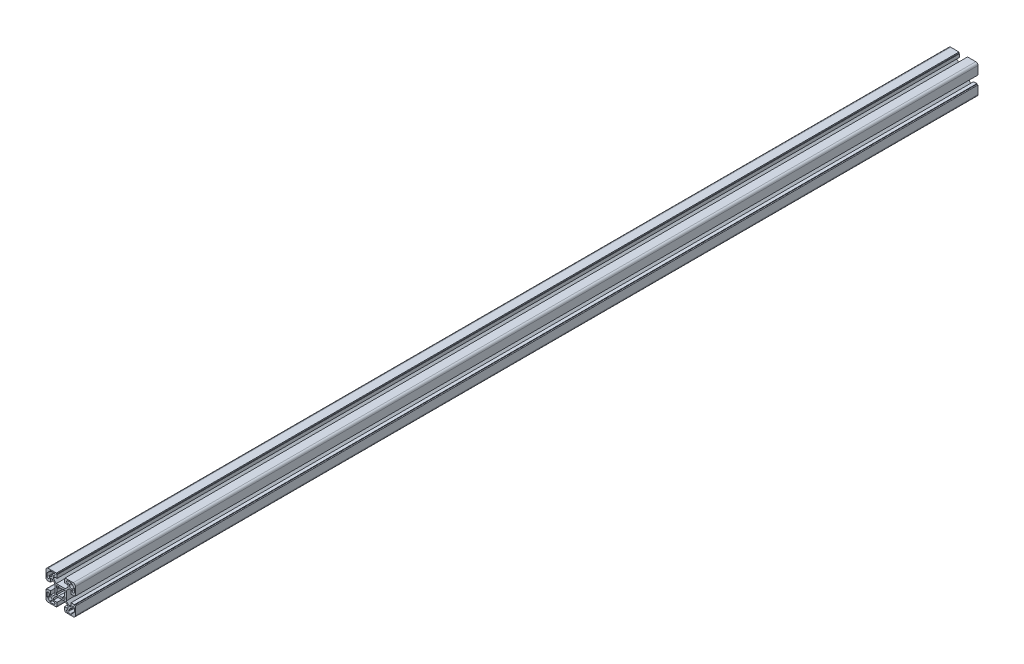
ISO-10303-21;
HEADER;
FILE_DESCRIPTION(('STEP AP214'),'2;1');
FILE_NAME('part.step','',(''),(''),'','','');
FILE_SCHEMA(('AUTOMOTIVE_DESIGN { 1 0 10303 214 1 1 1 1 }'));
ENDSEC;
DATA;
#1=APPLICATION_CONTEXT('core data for automotive mechanical design processes');
#2=APPLICATION_PROTOCOL_DEFINITION('international standard','automotive_design',2000,#1);
#3=PRODUCT_CONTEXT('',#1,'mechanical');
#4=PRODUCT('Part','Part','',(#3));
#5=PRODUCT_RELATED_PRODUCT_CATEGORY('part','',(#4));
#6=PRODUCT_DEFINITION_FORMATION('','',#4);
#7=PRODUCT_DEFINITION_CONTEXT('part definition',#1,'design');
#8=PRODUCT_DEFINITION('design','',#6,#7);
#9=PRODUCT_DEFINITION_SHAPE('','',#8);
#10=(LENGTH_UNIT() NAMED_UNIT(*) SI_UNIT(.MILLI.,.METRE.));
#11=(NAMED_UNIT(*) PLANE_ANGLE_UNIT() SI_UNIT($,.RADIAN.));
#12=(NAMED_UNIT(*) SI_UNIT($,.STERADIAN.) SOLID_ANGLE_UNIT());
#13=UNCERTAINTY_MEASURE_WITH_UNIT(LENGTH_MEASURE(1.E-05),#10,'distance_accuracy_value','');
#14=(GEOMETRIC_REPRESENTATION_CONTEXT(3) GLOBAL_UNCERTAINTY_ASSIGNED_CONTEXT((#13)) GLOBAL_UNIT_ASSIGNED_CONTEXT((#10,
#11,#12)) REPRESENTATION_CONTEXT('',''));
#15=CARTESIAN_POINT('',(0.,0.,0.));
#16=DIRECTION('',(0.,0.,1.));
#17=DIRECTION('',(1.,0.,0.));
#18=AXIS2_PLACEMENT_3D('',#15,#16,#17);
#19=CARTESIAN_POINT('',(-14.5000000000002,-11.75,1225.));
#20=DIRECTION('',(0.,-1.,0.));
#21=DIRECTION('',(1.,0.,0.));
#22=AXIS2_PLACEMENT_3D('',#19,#20,#21);
#23=PLANE('',#22);
#24=DIRECTION('',(1.,0.,0.));
#25=VECTOR('',#24,1.);
#26=CARTESIAN_POINT('',(-14.5000000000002,-11.75,1225.));
#27=LINE('',#26,#25);
#28=CARTESIAN_POINT('',(-14.5000000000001,-11.75,1225.));
#29=VERTEX_POINT('',#28);
#30=CARTESIAN_POINT('',(-15.5000000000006,-11.75,1225.));
#31=VERTEX_POINT('',#30);
#32=EDGE_CURVE('E806',#29,#31,#27,.F.);
#33=ORIENTED_EDGE('',*,*,#32,.T.);
#34=DIRECTION('',(0.,0.,1.));
#35=VECTOR('',#34,1.);
#36=CARTESIAN_POINT('',(-15.5000000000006,-11.75,1225.));
#37=LINE('',#36,#35);
#38=CARTESIAN_POINT('',(-15.5000000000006,-11.75,0.));
#39=VERTEX_POINT('',#38);
#40=EDGE_CURVE('E804',#39,#31,#37,.T.);
#41=ORIENTED_EDGE('',*,*,#40,.F.);
#42=DIRECTION('',(1.,0.,0.));
#43=VECTOR('',#42,1.);
#44=CARTESIAN_POINT('',(-14.5000000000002,-11.75,0.));
#45=LINE('',#44,#43);
#46=CARTESIAN_POINT('',(-14.5000000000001,-11.75,0.));
#47=VERTEX_POINT('',#46);
#48=EDGE_CURVE('E20',#39,#47,#45,.T.);
#49=ORIENTED_EDGE('',*,*,#48,.T.);
#50=DIRECTION('',(0.,0.,-1.));
#51=VECTOR('',#50,1.);
#52=CARTESIAN_POINT('',(-14.5000000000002,-11.75,1225.));
#53=LINE('',#52,#51);
#54=EDGE_CURVE('E801',#47,#29,#53,.F.);
#55=ORIENTED_EDGE('',*,*,#54,.T.);
#56=EDGE_LOOP('',(#33,#41,#49,#55));
#57=FACE_BOUND('',#56,.T.);
#58=ADVANCED_FACE('F17',(#57),#23,.T.);
#59=CARTESIAN_POINT('',(-11.7500000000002,-15.5,1225.));
#60=DIRECTION('',(-1.,0.,0.));
#61=DIRECTION('',(0.,-1.,0.));
#62=AXIS2_PLACEMENT_3D('',#59,#60,#61);
#63=PLANE('',#62);
#64=DIRECTION('',(0.,-1.,0.));
#65=VECTOR('',#64,1.);
#66=CARTESIAN_POINT('',(-11.7500000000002,-15.5,1225.));
#67=LINE('',#66,#65);
#68=CARTESIAN_POINT('',(-11.7500000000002,-15.5,1225.));
#69=VERTEX_POINT('',#68);
#70=CARTESIAN_POINT('',(-11.7500000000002,-14.5,1225.));
#71=VERTEX_POINT('',#70);
#72=EDGE_CURVE('E1218',#69,#71,#67,.F.);
#73=ORIENTED_EDGE('',*,*,#72,.T.);
#74=DIRECTION('',(0.,0.,-1.));
#75=VECTOR('',#74,1.);
#76=CARTESIAN_POINT('',(-11.7500000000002,-14.5,1225.));
#77=LINE('',#76,#75);
#78=CARTESIAN_POINT('',(-11.7500000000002,-14.5,0.));
#79=VERTEX_POINT('',#78);
#80=EDGE_CURVE('E814',#71,#79,#77,.T.);
#81=ORIENTED_EDGE('',*,*,#80,.T.);
#82=DIRECTION('',(0.,-1.,0.));
#83=VECTOR('',#82,1.);
#84=CARTESIAN_POINT('',(-11.7500000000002,-15.5,0.));
#85=LINE('',#84,#83);
#86=CARTESIAN_POINT('',(-11.7500000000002,-15.5,0.));
#87=VERTEX_POINT('',#86);
#88=EDGE_CURVE('E819',#79,#87,#85,.T.);
#89=ORIENTED_EDGE('',*,*,#88,.T.);
#90=DIRECTION('',(0.,0.,-1.));
#91=VECTOR('',#90,1.);
#92=CARTESIAN_POINT('',(-11.7500000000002,-15.5,1225.));
#93=LINE('',#92,#91);
#94=EDGE_CURVE('E1262',#69,#87,#93,.T.);
#95=ORIENTED_EDGE('',*,*,#94,.F.);
#96=EDGE_LOOP('',(#73,#81,#89,#95));
#97=FACE_BOUND('',#96,.T.);
#98=ADVANCED_FACE('F1555',(#97),#63,.T.);
#99=CARTESIAN_POINT('',(-14.5000000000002,-17.25,1225.));
#100=DIRECTION('',(1.,0.,0.));
#101=DIRECTION('',(0.,0.,-1.));
#102=AXIS2_PLACEMENT_3D('',#99,#100,#101);
#103=PLANE('',#102);
#104=DIRECTION('',(0.,1.,0.));
#105=VECTOR('',#104,1.);
#106=CARTESIAN_POINT('',(-14.5000000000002,-17.25,1225.));
#107=LINE('',#106,#105);
#108=CARTESIAN_POINT('',(-14.5000000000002,-17.25,1225.));
#109=VERTEX_POINT('',#108);
#110=CARTESIAN_POINT('',(-14.5000000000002,-18.5,1225.));
#111=VERTEX_POINT('',#110);
#112=EDGE_CURVE('E1214',#109,#111,#107,.F.);
#113=ORIENTED_EDGE('',*,*,#112,.T.);
#114=DIRECTION('',(0.,0.,1.));
#115=VECTOR('',#114,1.);
#116=CARTESIAN_POINT('',(-14.5000000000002,-18.5,1225.));
#117=LINE('',#116,#115);
#118=CARTESIAN_POINT('',(-14.5000000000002,-18.5,0.));
#119=VERTEX_POINT('',#118);
#120=EDGE_CURVE('E1256',#119,#111,#117,.T.);
#121=ORIENTED_EDGE('',*,*,#120,.F.);
#122=DIRECTION('',(0.,1.,0.));
#123=VECTOR('',#122,1.);
#124=CARTESIAN_POINT('',(-14.5000000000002,-17.25,0.));
#125=LINE('',#124,#123);
#126=CARTESIAN_POINT('',(-14.5000000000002,-17.25,0.));
#127=VERTEX_POINT('',#126);
#128=EDGE_CURVE('E1216',#119,#127,#125,.T.);
#129=ORIENTED_EDGE('',*,*,#128,.T.);
#130=DIRECTION('',(0.,0.,-1.));
#131=VECTOR('',#130,1.);
#132=CARTESIAN_POINT('',(-14.5000000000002,-17.25,1225.));
#133=LINE('',#132,#131);
#134=EDGE_CURVE('E1251',#127,#109,#133,.F.);
#135=ORIENTED_EDGE('',*,*,#134,.T.);
#136=EDGE_LOOP('',(#113,#121,#129,#135));
#137=FACE_BOUND('',#136,.T.);
#138=ADVANCED_FACE('F1560',(#137),#103,.T.);
#139=CARTESIAN_POINT('',(-18.5000000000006,-14.5000000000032,1225.));
#140=DIRECTION('',(0.,1.,0.));
#141=DIRECTION('',(0.,0.,1.));
#142=AXIS2_PLACEMENT_3D('',#139,#140,#141);
#143=PLANE('',#142);
#144=DIRECTION('',(1.,0.,0.));
#145=VECTOR('',#144,1.);
#146=CARTESIAN_POINT('',(-18.5000000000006,-14.5000000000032,1225.));
#147=LINE('',#146,#145);
#148=CARTESIAN_POINT('',(-18.5000000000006,-14.5000000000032,1225.));
#149=VERTEX_POINT('',#148);
#150=CARTESIAN_POINT('',(-17.2500000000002,-14.5000000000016,1225.));
#151=VERTEX_POINT('',#150);
#152=EDGE_CURVE('E1210',#149,#151,#147,.T.);
#153=ORIENTED_EDGE('',*,*,#152,.T.);
#154=DIRECTION('',(0.,0.,-1.));
#155=VECTOR('',#154,1.);
#156=CARTESIAN_POINT('',(-17.2500000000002,-14.5,1225.));
#157=LINE('',#156,#155);
#158=CARTESIAN_POINT('',(-17.2500000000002,-14.5000000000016,0.));
#159=VERTEX_POINT('',#158);
#160=EDGE_CURVE('E1248',#151,#159,#157,.T.);
#161=ORIENTED_EDGE('',*,*,#160,.T.);
#162=DIRECTION('',(1.,0.,0.));
#163=VECTOR('',#162,1.);
#164=CARTESIAN_POINT('',(-18.5000000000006,-14.5000000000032,0.));
#165=LINE('',#164,#163);
#166=CARTESIAN_POINT('',(-18.5000000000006,-14.5000000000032,0.));
#167=VERTEX_POINT('',#166);
#168=EDGE_CURVE('E1212',#159,#167,#165,.F.);
#169=ORIENTED_EDGE('',*,*,#168,.T.);
#170=DIRECTION('',(0.,0.,-1.));
#171=VECTOR('',#170,1.);
#172=CARTESIAN_POINT('',(-18.5000000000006,-14.5000000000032,1225.));
#173=LINE('',#172,#171);
#174=EDGE_CURVE('E1242',#149,#167,#173,.T.);
#175=ORIENTED_EDGE('',*,*,#174,.F.);
#176=EDGE_LOOP('',(#153,#161,#169,#175));
#177=FACE_BOUND('',#176,.T.);
#178=ADVANCED_FACE('F1569',(#177),#143,.T.);
#179=CARTESIAN_POINT('',(18.5000000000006,-14.5000000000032,1225.));
#180=DIRECTION('',(0.,1.,0.));
#181=DIRECTION('',(0.,0.,1.));
#182=AXIS2_PLACEMENT_3D('',#179,#180,#181);
#183=PLANE('',#182);
#184=DIRECTION('',(1.,0.,0.));
#185=VECTOR('',#184,1.);
#186=CARTESIAN_POINT('',(18.5000000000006,-14.5000000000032,1225.));
#187=LINE('',#186,#185);
#188=CARTESIAN_POINT('',(17.2500000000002,-14.5000000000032,1225.));
#189=VERTEX_POINT('',#188);
#190=CARTESIAN_POINT('',(18.5000000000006,-14.5000000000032,1225.));
#191=VERTEX_POINT('',#190);
#192=EDGE_CURVE('E1206',#189,#191,#187,.T.);
#193=ORIENTED_EDGE('',*,*,#192,.T.);
#194=DIRECTION('',(0.,0.,1.));
#195=VECTOR('',#194,1.);
#196=CARTESIAN_POINT('',(18.5000000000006,-14.5000000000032,1225.));
#197=LINE('',#196,#195);
#198=CARTESIAN_POINT('',(18.5000000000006,-14.5000000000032,0.));
#199=VERTEX_POINT('',#198);
#200=EDGE_CURVE('E1947',#199,#191,#197,.T.);
#201=ORIENTED_EDGE('',*,*,#200,.F.);
#202=DIRECTION('',(1.,0.,0.));
#203=VECTOR('',#202,1.);
#204=CARTESIAN_POINT('',(18.5000000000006,-14.5000000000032,0.));
#205=LINE('',#204,#203);
#206=CARTESIAN_POINT('',(17.2500000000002,-14.5000000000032,0.));
#207=VERTEX_POINT('',#206);
#208=EDGE_CURVE('E1208',#199,#207,#205,.F.);
#209=ORIENTED_EDGE('',*,*,#208,.T.);
#210=DIRECTION('',(0.,0.,-1.));
#211=VECTOR('',#210,1.);
#212=CARTESIAN_POINT('',(17.2500000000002,-14.5000000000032,1225.));
#213=LINE('',#212,#211);
#214=EDGE_CURVE('E1952',#207,#189,#213,.F.);
#215=ORIENTED_EDGE('',*,*,#214,.T.);
#216=EDGE_LOOP('',(#193,#201,#209,#215));
#217=FACE_BOUND('',#216,.T.);
#218=ADVANCED_FACE('F2472',(#217),#183,.T.);
#219=CARTESIAN_POINT('',(14.5000000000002,-17.25,1225.));
#220=DIRECTION('',(-1.,0.,0.));
#221=DIRECTION('',(0.,0.,1.));
#222=AXIS2_PLACEMENT_3D('',#219,#220,#221);
#223=PLANE('',#222);
#224=DIRECTION('',(0.,1.,0.));
#225=VECTOR('',#224,1.);
#226=CARTESIAN_POINT('',(14.5000000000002,-17.25,1225.));
#227=LINE('',#226,#225);
#228=CARTESIAN_POINT('',(14.5000000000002,-18.5,1225.));
#229=VERTEX_POINT('',#228);
#230=CARTESIAN_POINT('',(14.5000000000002,-17.25,1225.));
#231=VERTEX_POINT('',#230);
#232=EDGE_CURVE('E1202',#229,#231,#227,.T.);
#233=ORIENTED_EDGE('',*,*,#232,.T.);
#234=DIRECTION('',(0.,0.,-1.));
#235=VECTOR('',#234,1.);
#236=CARTESIAN_POINT('',(14.5000000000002,-17.25,1225.));
#237=LINE('',#236,#235);
#238=CARTESIAN_POINT('',(14.5000000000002,-17.25,0.));
#239=VERTEX_POINT('',#238);
#240=EDGE_CURVE('E1955',#231,#239,#237,.T.);
#241=ORIENTED_EDGE('',*,*,#240,.T.);
#242=DIRECTION('',(0.,1.,0.));
#243=VECTOR('',#242,1.);
#244=CARTESIAN_POINT('',(14.5000000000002,-17.25,0.));
#245=LINE('',#244,#243);
#246=CARTESIAN_POINT('',(14.5000000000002,-18.5,0.));
#247=VERTEX_POINT('',#246);
#248=EDGE_CURVE('E1204',#239,#247,#245,.F.);
#249=ORIENTED_EDGE('',*,*,#248,.T.);
#250=DIRECTION('',(0.,0.,1.));
#251=VECTOR('',#250,1.);
#252=CARTESIAN_POINT('',(14.5000000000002,-18.5,1225.));
#253=LINE('',#252,#251);
#254=EDGE_CURVE('E1958',#229,#247,#253,.F.);
#255=ORIENTED_EDGE('',*,*,#254,.F.);
#256=EDGE_LOOP('',(#233,#241,#249,#255));
#257=FACE_BOUND('',#256,.T.);
#258=ADVANCED_FACE('F2468',(#257),#223,.T.);
#259=CARTESIAN_POINT('',(11.7500000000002,-15.5,1225.));
#260=DIRECTION('',(1.,0.,0.));
#261=DIRECTION('',(0.,1.,0.));
#262=AXIS2_PLACEMENT_3D('',#259,#260,#261);
#263=PLANE('',#262);
#264=DIRECTION('',(0.,1.,0.));
#265=VECTOR('',#264,1.);
#266=CARTESIAN_POINT('',(11.7500000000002,-15.5,1225.));
#267=LINE('',#266,#265);
#268=CARTESIAN_POINT('',(11.7500000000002,-14.5,1225.));
#269=VERTEX_POINT('',#268);
#270=CARTESIAN_POINT('',(11.7500000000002,-15.5,1225.));
#271=VERTEX_POINT('',#270);
#272=EDGE_CURVE('E1198',#269,#271,#267,.F.);
#273=ORIENTED_EDGE('',*,*,#272,.T.);
#274=DIRECTION('',(0.,0.,-1.));
#275=VECTOR('',#274,1.);
#276=CARTESIAN_POINT('',(11.7500000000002,-15.5,1225.));
#277=LINE('',#276,#275);
#278=CARTESIAN_POINT('',(11.7500000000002,-15.5,0.));
#279=VERTEX_POINT('',#278);
#280=EDGE_CURVE('E1964',#279,#271,#277,.F.);
#281=ORIENTED_EDGE('',*,*,#280,.F.);
#282=DIRECTION('',(0.,1.,0.));
#283=VECTOR('',#282,1.);
#284=CARTESIAN_POINT('',(11.7500000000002,-15.5,0.));
#285=LINE('',#284,#283);
#286=CARTESIAN_POINT('',(11.7500000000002,-14.5,0.));
#287=VERTEX_POINT('',#286);
#288=EDGE_CURVE('E1200',#279,#287,#285,.T.);
#289=ORIENTED_EDGE('',*,*,#288,.T.);
#290=DIRECTION('',(0.,0.,-1.));
#291=VECTOR('',#290,1.);
#292=CARTESIAN_POINT('',(11.7500000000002,-14.5,1225.));
#293=LINE('',#292,#291);
#294=EDGE_CURVE('E1969',#287,#269,#293,.F.);
#295=ORIENTED_EDGE('',*,*,#294,.T.);
#296=EDGE_LOOP('',(#273,#281,#289,#295));
#297=FACE_BOUND('',#296,.T.);
#298=ADVANCED_FACE('F2465',(#297),#263,.T.);
#299=CARTESIAN_POINT('',(14.5000000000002,-11.75,1225.));
#300=DIRECTION('',(0.,-1.,0.));
#301=DIRECTION('',(1.,0.,0.));
#302=AXIS2_PLACEMENT_3D('',#299,#300,#301);
#303=PLANE('',#302);
#304=DIRECTION('',(1.,0.,0.));
#305=VECTOR('',#304,1.);
#306=CARTESIAN_POINT('',(14.5000000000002,-11.75,1225.));
#307=LINE('',#306,#305);
#308=CARTESIAN_POINT('',(15.5000000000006,-11.75,1225.));
#309=VERTEX_POINT('',#308);
#310=CARTESIAN_POINT('',(14.5000000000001,-11.75,1225.));
#311=VERTEX_POINT('',#310);
#312=EDGE_CURVE('E1194',#309,#311,#307,.F.);
#313=ORIENTED_EDGE('',*,*,#312,.T.);
#314=DIRECTION('',(0.,0.,-1.));
#315=VECTOR('',#314,1.);
#316=CARTESIAN_POINT('',(14.5000000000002,-11.75,1225.));
#317=LINE('',#316,#315);
#318=CARTESIAN_POINT('',(14.5000000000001,-11.75,0.));
#319=VERTEX_POINT('',#318);
#320=EDGE_CURVE('E1940',#311,#319,#317,.T.);
#321=ORIENTED_EDGE('',*,*,#320,.T.);
#322=DIRECTION('',(1.,0.,0.));
#323=VECTOR('',#322,1.);
#324=CARTESIAN_POINT('',(14.5000000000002,-11.75,0.));
#325=LINE('',#324,#323);
#326=CARTESIAN_POINT('',(15.5000000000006,-11.75,0.));
#327=VERTEX_POINT('',#326);
#328=EDGE_CURVE('E1196',#319,#327,#325,.T.);
#329=ORIENTED_EDGE('',*,*,#328,.T.);
#330=DIRECTION('',(0.,0.,-1.));
#331=VECTOR('',#330,1.);
#332=CARTESIAN_POINT('',(15.5000000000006,-11.75,1225.));
#333=LINE('',#332,#331);
#334=EDGE_CURVE('E1237',#309,#327,#333,.T.);
#335=ORIENTED_EDGE('',*,*,#334,.F.);
#336=EDGE_LOOP('',(#313,#321,#329,#335));
#337=FACE_BOUND('',#336,.T.);
#338=ADVANCED_FACE('F1939',(#337),#303,.T.);
#339=CARTESIAN_POINT('',(5.80000000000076,-18.5000000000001,1225.));
#340=DIRECTION('',(1.,0.,0.));
#341=DIRECTION('',(0.,0.,-1.));
#342=AXIS2_PLACEMENT_3D('',#339,#340,#341);
#343=PLANE('',#342);
#344=DIRECTION('',(0.,0.,1.));
#345=VECTOR('',#344,1.);
#346=CARTESIAN_POINT('',(5.80000000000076,-20.,1225.));
#347=LINE('',#346,#345);
#348=CARTESIAN_POINT('',(5.80000000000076,-20.,0.));
#349=VERTEX_POINT('',#348);
#350=CARTESIAN_POINT('',(5.80000000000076,-20.,1225.));
#351=VERTEX_POINT('',#350);
#352=EDGE_CURVE('E1973',#349,#351,#347,.T.);
#353=ORIENTED_EDGE('',*,*,#352,.T.);
#354=DIRECTION('',(0.,1.,0.));
#355=VECTOR('',#354,1.);
#356=CARTESIAN_POINT('',(5.80000000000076,-17.,1225.));
#357=LINE('',#356,#355);
#358=CARTESIAN_POINT('',(5.80000000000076,-18.5000000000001,1225.));
#359=VERTEX_POINT('',#358);
#360=EDGE_CURVE('E1192',#359,#351,#357,.F.);
#361=ORIENTED_EDGE('',*,*,#360,.F.);
#362=DIRECTION('',(0.,0.,1.));
#363=VECTOR('',#362,1.);
#364=CARTESIAN_POINT('',(5.80000000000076,-18.5000000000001,1225.));
#365=LINE('',#364,#363);
#366=CARTESIAN_POINT('',(5.80000000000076,-18.5000000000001,0.));
#367=VERTEX_POINT('',#366);
#368=EDGE_CURVE('E1116',#359,#367,#365,.F.);
#369=ORIENTED_EDGE('',*,*,#368,.T.);
#370=DIRECTION('',(0.,1.,0.));
#371=VECTOR('',#370,1.);
#372=CARTESIAN_POINT('',(5.80000000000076,-17.,0.));
#373=LINE('',#372,#371);
#374=EDGE_CURVE('E1190',#349,#367,#373,.T.);
#375=ORIENTED_EDGE('',*,*,#374,.F.);
#376=EDGE_LOOP('',(#353,#361,#369,#375));
#377=FACE_BOUND('',#376,.T.);
#378=ADVANCED_FACE('F2286',(#377),#343,.F.);
#379=CARTESIAN_POINT('',(20.,-5.79999999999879,1225.));
#380=DIRECTION('',(0.,-1.,0.));
#381=DIRECTION('',(0.,0.,-1.));
#382=AXIS2_PLACEMENT_3D('',#379,#380,#381);
#383=PLANE('',#382);
#384=DIRECTION('',(0.,0.,1.));
#385=VECTOR('',#384,1.);
#386=CARTESIAN_POINT('',(18.5,-5.79999999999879,1225.));
#387=LINE('',#386,#385);
#388=CARTESIAN_POINT('',(18.5,-5.79999999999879,0.));
#389=VERTEX_POINT('',#388);
#390=CARTESIAN_POINT('',(18.5,-5.79999999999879,1225.));
#391=VERTEX_POINT('',#390);
#392=EDGE_CURVE('E1185',#389,#391,#387,.T.);
#393=ORIENTED_EDGE('',*,*,#392,.T.);
#394=DIRECTION('',(1.,0.,0.));
#395=VECTOR('',#394,1.);
#396=CARTESIAN_POINT('',(17.,-5.79999999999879,1225.));
#397=LINE('',#396,#395);
#398=CARTESIAN_POINT('',(20.,-5.79999999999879,1225.));
#399=VERTEX_POINT('',#398);
#400=EDGE_CURVE('E1188',#399,#391,#397,.F.);
#401=ORIENTED_EDGE('',*,*,#400,.F.);
#402=DIRECTION('',(0.,0.,1.));
#403=VECTOR('',#402,1.);
#404=CARTESIAN_POINT('',(20.,-5.79999999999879,1225.));
#405=LINE('',#404,#403);
#406=CARTESIAN_POINT('',(20.,-5.79999999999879,0.));
#407=VERTEX_POINT('',#406);
#408=EDGE_CURVE('E1981',#399,#407,#405,.F.);
#409=ORIENTED_EDGE('',*,*,#408,.T.);
#410=DIRECTION('',(1.,0.,0.));
#411=VECTOR('',#410,1.);
#412=CARTESIAN_POINT('',(17.,-5.79999999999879,0.));
#413=LINE('',#412,#411);
#414=EDGE_CURVE('E1186',#389,#407,#413,.T.);
#415=ORIENTED_EDGE('',*,*,#414,.F.);
#416=EDGE_LOOP('',(#393,#401,#409,#415));
#417=FACE_BOUND('',#416,.T.);
#418=ADVANCED_FACE('F2294',(#417),#383,.F.);
#419=CARTESIAN_POINT('',(18.5,-5.79999999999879,1225.));
#420=DIRECTION('',(-1.,0.,0.));
#421=DIRECTION('',(0.,0.,1.));
#422=AXIS2_PLACEMENT_3D('',#419,#420,#421);
#423=PLANE('',#422);
#424=DIRECTION('',(0.,0.,-1.));
#425=VECTOR('',#424,1.);
#426=CARTESIAN_POINT('',(18.5,-4.99999999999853,1225.));
#427=LINE('',#426,#425);
#428=CARTESIAN_POINT('',(18.5,-4.99999999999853,0.));
#429=VERTEX_POINT('',#428);
#430=CARTESIAN_POINT('',(18.5,-4.99999999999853,1225.));
#431=VERTEX_POINT('',#430);
#432=EDGE_CURVE('E1984',#429,#431,#427,.F.);
#433=ORIENTED_EDGE('',*,*,#432,.T.);
#434=DIRECTION('',(0.,1.,0.));
#435=VECTOR('',#434,1.);
#436=CARTESIAN_POINT('',(18.5,-17.,1225.));
#437=LINE('',#436,#435);
#438=EDGE_CURVE('E1183',#391,#431,#437,.T.);
#439=ORIENTED_EDGE('',*,*,#438,.F.);
#440=ORIENTED_EDGE('',*,*,#392,.F.);
#441=DIRECTION('',(0.,1.,0.));
#442=VECTOR('',#441,1.);
#443=CARTESIAN_POINT('',(18.5,-17.,0.));
#444=LINE('',#443,#442);
#445=EDGE_CURVE('E1180',#429,#389,#444,.F.);
#446=ORIENTED_EDGE('',*,*,#445,.F.);
#447=EDGE_LOOP('',(#433,#439,#440,#446));
#448=FACE_BOUND('',#447,.T.);
#449=ADVANCED_FACE('F2297',(#448),#423,.F.);
#450=CARTESIAN_POINT('',(18.5,5.79999999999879,1225.));
#451=DIRECTION('',(-1.,0.,0.));
#452=DIRECTION('',(0.,0.,1.));
#453=AXIS2_PLACEMENT_3D('',#450,#451,#452);
#454=PLANE('',#453);
#455=DIRECTION('',(0.,0.,1.));
#456=VECTOR('',#455,1.);
#457=CARTESIAN_POINT('',(18.5,5.79999999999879,1225.));
#458=LINE('',#457,#456);
#459=CARTESIAN_POINT('',(18.5,5.79999999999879,0.));
#460=VERTEX_POINT('',#459);
#461=CARTESIAN_POINT('',(18.5,5.79999999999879,1225.));
#462=VERTEX_POINT('',#461);
#463=EDGE_CURVE('E1175',#460,#462,#458,.T.);
#464=ORIENTED_EDGE('',*,*,#463,.T.);
#465=DIRECTION('',(0.,1.,0.));
#466=VECTOR('',#465,1.);
#467=CARTESIAN_POINT('',(18.5,-17.,1225.));
#468=LINE('',#467,#466);
#469=CARTESIAN_POINT('',(18.5,4.99999999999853,1225.));
#470=VERTEX_POINT('',#469);
#471=EDGE_CURVE('E1178',#470,#462,#468,.T.);
#472=ORIENTED_EDGE('',*,*,#471,.F.);
#473=DIRECTION('',(0.,0.,1.));
#474=VECTOR('',#473,1.);
#475=CARTESIAN_POINT('',(18.5,4.99999999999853,1225.));
#476=LINE('',#475,#474);
#477=CARTESIAN_POINT('',(18.5,4.99999999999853,0.));
#478=VERTEX_POINT('',#477);
#479=EDGE_CURVE('E2011',#470,#478,#476,.F.);
#480=ORIENTED_EDGE('',*,*,#479,.T.);
#481=DIRECTION('',(0.,1.,0.));
#482=VECTOR('',#481,1.);
#483=CARTESIAN_POINT('',(18.5,-17.,0.));
#484=LINE('',#483,#482);
#485=EDGE_CURVE('E1176',#460,#478,#484,.F.);
#486=ORIENTED_EDGE('',*,*,#485,.F.);
#487=EDGE_LOOP('',(#464,#472,#480,#486));
#488=FACE_BOUND('',#487,.T.);
#489=ADVANCED_FACE('F2319',(#488),#454,.F.);
#490=CARTESIAN_POINT('',(20.,5.79999999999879,1225.));
#491=DIRECTION('',(0.,1.,0.));
#492=DIRECTION('',(0.,0.,1.));
#493=AXIS2_PLACEMENT_3D('',#490,#491,#492);
#494=PLANE('',#493);
#495=DIRECTION('',(0.,0.,1.));
#496=VECTOR('',#495,1.);
#497=CARTESIAN_POINT('',(20.,5.79999999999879,1225.));
#498=LINE('',#497,#496);
#499=CARTESIAN_POINT('',(20.,5.79999999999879,0.));
#500=VERTEX_POINT('',#499);
#501=CARTESIAN_POINT('',(20.,5.79999999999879,1225.));
#502=VERTEX_POINT('',#501);
#503=EDGE_CURVE('E2014',#500,#502,#498,.T.);
#504=ORIENTED_EDGE('',*,*,#503,.T.);
#505=DIRECTION('',(1.,0.,0.));
#506=VECTOR('',#505,1.);
#507=CARTESIAN_POINT('',(17.,5.79999999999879,1225.));
#508=LINE('',#507,#506);
#509=EDGE_CURVE('E1173',#462,#502,#508,.T.);
#510=ORIENTED_EDGE('',*,*,#509,.F.);
#511=ORIENTED_EDGE('',*,*,#463,.F.);
#512=DIRECTION('',(1.,0.,0.));
#513=VECTOR('',#512,1.);
#514=CARTESIAN_POINT('',(17.,5.79999999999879,0.));
#515=LINE('',#514,#513);
#516=EDGE_CURVE('E1170',#500,#460,#515,.F.);
#517=ORIENTED_EDGE('',*,*,#516,.F.);
#518=EDGE_LOOP('',(#504,#510,#511,#517));
#519=FACE_BOUND('',#518,.T.);
#520=ADVANCED_FACE('F2323',(#519),#494,.F.);
#521=CARTESIAN_POINT('',(5.80000000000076,18.5000000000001,1225.));
#522=DIRECTION('',(1.,0.,0.));
#523=DIRECTION('',(0.,0.,-1.));
#524=AXIS2_PLACEMENT_3D('',#521,#522,#523);
#525=PLANE('',#524);
#526=DIRECTION('',(0.,0.,-1.));
#527=VECTOR('',#526,1.);
#528=CARTESIAN_POINT('',(5.80000000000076,18.5000000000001,1225.));
#529=LINE('',#528,#527);
#530=CARTESIAN_POINT('',(5.80000000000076,18.5000000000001,0.));
#531=VERTEX_POINT('',#530);
#532=CARTESIAN_POINT('',(5.80000000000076,18.5000000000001,1225.));
#533=VERTEX_POINT('',#532);
#534=EDGE_CURVE('E1165',#531,#533,#529,.F.);
#535=ORIENTED_EDGE('',*,*,#534,.T.);
#536=DIRECTION('',(0.,1.,0.));
#537=VECTOR('',#536,1.);
#538=CARTESIAN_POINT('',(5.80000000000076,-17.,1225.));
#539=LINE('',#538,#537);
#540=CARTESIAN_POINT('',(5.80000000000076,20.,1225.));
#541=VERTEX_POINT('',#540);
#542=EDGE_CURVE('E1168',#541,#533,#539,.F.);
#543=ORIENTED_EDGE('',*,*,#542,.F.);
#544=DIRECTION('',(0.,0.,-1.));
#545=VECTOR('',#544,1.);
#546=CARTESIAN_POINT('',(5.80000000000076,20.,1225.));
#547=LINE('',#546,#545);
#548=CARTESIAN_POINT('',(5.80000000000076,20.,0.));
#549=VERTEX_POINT('',#548);
#550=EDGE_CURVE('E2022',#541,#549,#547,.T.);
#551=ORIENTED_EDGE('',*,*,#550,.T.);
#552=DIRECTION('',(0.,1.,0.));
#553=VECTOR('',#552,1.);
#554=CARTESIAN_POINT('',(5.80000000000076,-17.,0.));
#555=LINE('',#554,#553);
#556=EDGE_CURVE('E1166',#531,#549,#555,.T.);
#557=ORIENTED_EDGE('',*,*,#556,.F.);
#558=EDGE_LOOP('',(#535,#543,#551,#557));
#559=FACE_BOUND('',#558,.T.);
#560=ADVANCED_FACE('F2334',(#559),#525,.F.);
#561=CARTESIAN_POINT('',(5.00000000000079,18.5000000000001,1225.));
#562=DIRECTION('',(0.,-1.,0.));
#563=DIRECTION('',(0.,0.,-1.));
#564=AXIS2_PLACEMENT_3D('',#561,#562,#563);
#565=PLANE('',#564);
#566=DIRECTION('',(0.,0.,1.));
#567=VECTOR('',#566,1.);
#568=CARTESIAN_POINT('',(5.00000000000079,18.5000000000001,1225.));
#569=LINE('',#568,#567);
#570=CARTESIAN_POINT('',(5.00000000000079,18.5000000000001,0.));
#571=VERTEX_POINT('',#570);
#572=CARTESIAN_POINT('',(5.00000000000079,18.5000000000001,1225.));
#573=VERTEX_POINT('',#572);
#574=EDGE_CURVE('E2025',#571,#573,#569,.T.);
#575=ORIENTED_EDGE('',*,*,#574,.T.);
#576=DIRECTION('',(1.,0.,0.));
#577=VECTOR('',#576,1.);
#578=CARTESIAN_POINT('',(17.,18.5000000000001,1225.));
#579=LINE('',#578,#577);
#580=EDGE_CURVE('E1163',#533,#573,#579,.F.);
#581=ORIENTED_EDGE('',*,*,#580,.F.);
#582=ORIENTED_EDGE('',*,*,#534,.F.);
#583=DIRECTION('',(1.,0.,0.));
#584=VECTOR('',#583,1.);
#585=CARTESIAN_POINT('',(17.,18.5000000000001,0.));
#586=LINE('',#585,#584);
#587=EDGE_CURVE('E1160',#571,#531,#586,.T.);
#588=ORIENTED_EDGE('',*,*,#587,.F.);
#589=EDGE_LOOP('',(#575,#581,#582,#588));
#590=FACE_BOUND('',#589,.T.);
#591=ADVANCED_FACE('F2338',(#590),#565,.F.);
#592=CARTESIAN_POINT('',(-5.00000000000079,18.5000000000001,1225.));
#593=DIRECTION('',(0.,-1.,0.));
#594=DIRECTION('',(0.,0.,-1.));
#595=AXIS2_PLACEMENT_3D('',#592,#593,#594);
#596=PLANE('',#595);
#597=DIRECTION('',(0.,0.,1.));
#598=VECTOR('',#597,1.);
#599=CARTESIAN_POINT('',(-5.80000000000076,18.5000000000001,1225.));
#600=LINE('',#599,#598);
#601=CARTESIAN_POINT('',(-5.80000000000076,18.5000000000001,0.));
#602=VERTEX_POINT('',#601);
#603=CARTESIAN_POINT('',(-5.80000000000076,18.5000000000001,1225.));
#604=VERTEX_POINT('',#603);
#605=EDGE_CURVE('E1155',#602,#604,#600,.T.);
#606=ORIENTED_EDGE('',*,*,#605,.T.);
#607=DIRECTION('',(1.,0.,0.));
#608=VECTOR('',#607,1.);
#609=CARTESIAN_POINT('',(17.,18.5000000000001,1225.));
#610=LINE('',#609,#608);
#611=CARTESIAN_POINT('',(-5.00000000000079,18.5000000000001,1225.));
#612=VERTEX_POINT('',#611);
#613=EDGE_CURVE('E1158',#612,#604,#610,.F.);
#614=ORIENTED_EDGE('',*,*,#613,.F.);
#615=DIRECTION('',(0.,0.,1.));
#616=VECTOR('',#615,1.);
#617=CARTESIAN_POINT('',(-5.00000000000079,18.5000000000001,1225.));
#618=LINE('',#617,#616);
#619=CARTESIAN_POINT('',(-5.00000000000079,18.5000000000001,0.));
#620=VERTEX_POINT('',#619);
#621=EDGE_CURVE('E2052',#612,#620,#618,.F.);
#622=ORIENTED_EDGE('',*,*,#621,.T.);
#623=DIRECTION('',(1.,0.,0.));
#624=VECTOR('',#623,1.);
#625=CARTESIAN_POINT('',(17.,18.5000000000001,0.));
#626=LINE('',#625,#624);
#627=EDGE_CURVE('E1156',#602,#620,#626,.T.);
#628=ORIENTED_EDGE('',*,*,#627,.F.);
#629=EDGE_LOOP('',(#606,#614,#622,#628));
#630=FACE_BOUND('',#629,.T.);
#631=ADVANCED_FACE('F2360',(#630),#596,.F.);
#632=CARTESIAN_POINT('',(-5.80000000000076,18.5000000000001,1225.));
#633=DIRECTION('',(-1.,0.,0.));
#634=DIRECTION('',(0.,0.,1.));
#635=AXIS2_PLACEMENT_3D('',#632,#633,#634);
#636=PLANE('',#635);
#637=DIRECTION('',(0.,0.,1.));
#638=VECTOR('',#637,1.);
#639=CARTESIAN_POINT('',(-5.80000000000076,20.,1225.));
#640=LINE('',#639,#638);
#641=CARTESIAN_POINT('',(-5.80000000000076,20.,0.));
#642=VERTEX_POINT('',#641);
#643=CARTESIAN_POINT('',(-5.80000000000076,20.,1225.));
#644=VERTEX_POINT('',#643);
#645=EDGE_CURVE('E2055',#642,#644,#640,.T.);
#646=ORIENTED_EDGE('',*,*,#645,.T.);
#647=DIRECTION('',(0.,1.,0.));
#648=VECTOR('',#647,1.);
#649=CARTESIAN_POINT('',(-5.80000000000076,-17.,1225.));
#650=LINE('',#649,#648);
#651=EDGE_CURVE('E1153',#604,#644,#650,.T.);
#652=ORIENTED_EDGE('',*,*,#651,.F.);
#653=ORIENTED_EDGE('',*,*,#605,.F.);
#654=DIRECTION('',(0.,1.,0.));
#655=VECTOR('',#654,1.);
#656=CARTESIAN_POINT('',(-5.80000000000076,-17.,0.));
#657=LINE('',#656,#655);
#658=EDGE_CURVE('E1150',#642,#602,#657,.F.);
#659=ORIENTED_EDGE('',*,*,#658,.F.);
#660=EDGE_LOOP('',(#646,#652,#653,#659));
#661=FACE_BOUND('',#660,.T.);
#662=ADVANCED_FACE('F2364',(#661),#636,.F.);
#663=CARTESIAN_POINT('',(-20.,5.79999999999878,1225.));
#664=DIRECTION('',(0.,1.,0.));
#665=DIRECTION('',(0.,0.,1.));
#666=AXIS2_PLACEMENT_3D('',#663,#664,#665);
#667=PLANE('',#666);
#668=DIRECTION('',(0.,0.,-1.));
#669=VECTOR('',#668,1.);
#670=CARTESIAN_POINT('',(-18.5,5.79999999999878,1225.));
#671=LINE('',#670,#669);
#672=CARTESIAN_POINT('',(-18.5,5.79999999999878,0.));
#673=VERTEX_POINT('',#672);
#674=CARTESIAN_POINT('',(-18.5,5.79999999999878,1225.));
#675=VERTEX_POINT('',#674);
#676=EDGE_CURVE('E1145',#673,#675,#671,.F.);
#677=ORIENTED_EDGE('',*,*,#676,.T.);
#678=DIRECTION('',(1.,0.,0.));
#679=VECTOR('',#678,1.);
#680=CARTESIAN_POINT('',(17.,5.79999999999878,1225.));
#681=LINE('',#680,#679);
#682=CARTESIAN_POINT('',(-20.,5.79999999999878,1225.));
#683=VERTEX_POINT('',#682);
#684=EDGE_CURVE('E1148',#683,#675,#681,.T.);
#685=ORIENTED_EDGE('',*,*,#684,.F.);
#686=DIRECTION('',(0.,0.,1.));
#687=VECTOR('',#686,1.);
#688=CARTESIAN_POINT('',(-20.,5.79999999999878,1225.));
#689=LINE('',#688,#687);
#690=CARTESIAN_POINT('',(-20.,5.79999999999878,0.));
#691=VERTEX_POINT('',#690);
#692=EDGE_CURVE('E2063',#683,#691,#689,.F.);
#693=ORIENTED_EDGE('',*,*,#692,.T.);
#694=DIRECTION('',(1.,0.,0.));
#695=VECTOR('',#694,1.);
#696=CARTESIAN_POINT('',(17.,5.79999999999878,0.));
#697=LINE('',#696,#695);
#698=EDGE_CURVE('E1146',#673,#691,#697,.F.);
#699=ORIENTED_EDGE('',*,*,#698,.F.);
#700=EDGE_LOOP('',(#677,#685,#693,#699));
#701=FACE_BOUND('',#700,.T.);
#702=ADVANCED_FACE('F2375',(#701),#667,.F.);
#703=CARTESIAN_POINT('',(-18.5,5.79999999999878,1225.));
#704=DIRECTION('',(1.,0.,0.));
#705=DIRECTION('',(0.,0.,-1.));
#706=AXIS2_PLACEMENT_3D('',#703,#704,#705);
#707=PLANE('',#706);
#708=DIRECTION('',(0.,0.,1.));
#709=VECTOR('',#708,1.);
#710=CARTESIAN_POINT('',(-18.5,4.99999999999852,1225.));
#711=LINE('',#710,#709);
#712=CARTESIAN_POINT('',(-18.5,4.99999999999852,0.));
#713=VERTEX_POINT('',#712);
#714=CARTESIAN_POINT('',(-18.5,4.99999999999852,1225.));
#715=VERTEX_POINT('',#714);
#716=EDGE_CURVE('E2066',#713,#715,#711,.T.);
#717=ORIENTED_EDGE('',*,*,#716,.T.);
#718=DIRECTION('',(0.,1.,0.));
#719=VECTOR('',#718,1.);
#720=CARTESIAN_POINT('',(-18.5,-17.,1225.));
#721=LINE('',#720,#719);
#722=EDGE_CURVE('E1143',#675,#715,#721,.F.);
#723=ORIENTED_EDGE('',*,*,#722,.F.);
#724=ORIENTED_EDGE('',*,*,#676,.F.);
#725=DIRECTION('',(0.,1.,0.));
#726=VECTOR('',#725,1.);
#727=CARTESIAN_POINT('',(-18.5,-17.,0.));
#728=LINE('',#727,#726);
#729=EDGE_CURVE('E1140',#713,#673,#728,.T.);
#730=ORIENTED_EDGE('',*,*,#729,.F.);
#731=EDGE_LOOP('',(#717,#723,#724,#730));
#732=FACE_BOUND('',#731,.T.);
#733=ADVANCED_FACE('F2379',(#732),#707,.F.);
#734=CARTESIAN_POINT('',(-18.5,-5.79999999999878,1225.));
#735=DIRECTION('',(1.,0.,0.));
#736=DIRECTION('',(0.,0.,-1.));
#737=AXIS2_PLACEMENT_3D('',#734,#735,#736);
#738=PLANE('',#737);
#739=DIRECTION('',(0.,0.,-1.));
#740=VECTOR('',#739,1.);
#741=CARTESIAN_POINT('',(-18.5,-5.79999999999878,1225.));
#742=LINE('',#741,#740);
#743=CARTESIAN_POINT('',(-18.5,-5.79999999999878,0.));
#744=VERTEX_POINT('',#743);
#745=CARTESIAN_POINT('',(-18.5,-5.79999999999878,1225.));
#746=VERTEX_POINT('',#745);
#747=EDGE_CURVE('E1135',#744,#746,#742,.F.);
#748=ORIENTED_EDGE('',*,*,#747,.T.);
#749=DIRECTION('',(0.,1.,0.));
#750=VECTOR('',#749,1.);
#751=CARTESIAN_POINT('',(-18.5,-17.,1225.));
#752=LINE('',#751,#750);
#753=CARTESIAN_POINT('',(-18.5,-4.99999999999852,1225.));
#754=VERTEX_POINT('',#753);
#755=EDGE_CURVE('E1138',#754,#746,#752,.F.);
#756=ORIENTED_EDGE('',*,*,#755,.F.);
#757=DIRECTION('',(0.,0.,1.));
#758=VECTOR('',#757,1.);
#759=CARTESIAN_POINT('',(-18.5,-4.99999999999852,1225.));
#760=LINE('',#759,#758);
#761=CARTESIAN_POINT('',(-18.5,-4.99999999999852,0.));
#762=VERTEX_POINT('',#761);
#763=EDGE_CURVE('E2093',#754,#762,#760,.F.);
#764=ORIENTED_EDGE('',*,*,#763,.T.);
#765=DIRECTION('',(0.,1.,0.));
#766=VECTOR('',#765,1.);
#767=CARTESIAN_POINT('',(-18.5,-17.,0.));
#768=LINE('',#767,#766);
#769=EDGE_CURVE('E1136',#744,#762,#768,.T.);
#770=ORIENTED_EDGE('',*,*,#769,.F.);
#771=EDGE_LOOP('',(#748,#756,#764,#770));
#772=FACE_BOUND('',#771,.T.);
#773=ADVANCED_FACE('F2401',(#772),#738,.F.);
#774=CARTESIAN_POINT('',(-20.,-5.79999999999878,1225.));
#775=DIRECTION('',(0.,-1.,0.));
#776=DIRECTION('',(0.,0.,-1.));
#777=AXIS2_PLACEMENT_3D('',#774,#775,#776);
#778=PLANE('',#777);
#779=DIRECTION('',(0.,0.,1.));
#780=VECTOR('',#779,1.);
#781=CARTESIAN_POINT('',(-20.,-5.79999999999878,1225.));
#782=LINE('',#781,#780);
#783=CARTESIAN_POINT('',(-20.,-5.79999999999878,0.));
#784=VERTEX_POINT('',#783);
#785=CARTESIAN_POINT('',(-20.,-5.79999999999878,1225.));
#786=VERTEX_POINT('',#785);
#787=EDGE_CURVE('E2096',#784,#786,#782,.T.);
#788=ORIENTED_EDGE('',*,*,#787,.T.);
#789=DIRECTION('',(1.,0.,0.));
#790=VECTOR('',#789,1.);
#791=CARTESIAN_POINT('',(17.,-5.79999999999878,1225.));
#792=LINE('',#791,#790);
#793=EDGE_CURVE('E1133',#746,#786,#792,.F.);
#794=ORIENTED_EDGE('',*,*,#793,.F.);
#795=ORIENTED_EDGE('',*,*,#747,.F.);
#796=DIRECTION('',(1.,0.,0.));
#797=VECTOR('',#796,1.);
#798=CARTESIAN_POINT('',(17.,-5.79999999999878,0.));
#799=LINE('',#798,#797);
#800=EDGE_CURVE('E1130',#784,#744,#799,.T.);
#801=ORIENTED_EDGE('',*,*,#800,.F.);
#802=EDGE_LOOP('',(#788,#794,#795,#801));
#803=FACE_BOUND('',#802,.T.);
#804=ADVANCED_FACE('F2405',(#803),#778,.F.);
#805=CARTESIAN_POINT('',(-5.80000000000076,-18.5000000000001,1225.));
#806=DIRECTION('',(-1.,0.,0.));
#807=DIRECTION('',(0.,0.,1.));
#808=AXIS2_PLACEMENT_3D('',#805,#806,#807);
#809=PLANE('',#808);
#810=DIRECTION('',(0.,0.,1.));
#811=VECTOR('',#810,1.);
#812=CARTESIAN_POINT('',(-5.80000000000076,-18.5000000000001,1225.));
#813=LINE('',#812,#811);
#814=CARTESIAN_POINT('',(-5.80000000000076,-18.5000000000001,0.));
#815=VERTEX_POINT('',#814);
#816=CARTESIAN_POINT('',(-5.80000000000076,-18.5000000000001,1225.));
#817=VERTEX_POINT('',#816);
#818=EDGE_CURVE('E1125',#815,#817,#813,.T.);
#819=ORIENTED_EDGE('',*,*,#818,.T.);
#820=DIRECTION('',(0.,1.,0.));
#821=VECTOR('',#820,1.);
#822=CARTESIAN_POINT('',(-5.80000000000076,-17.,1225.));
#823=LINE('',#822,#821);
#824=CARTESIAN_POINT('',(-5.80000000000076,-20.,1225.));
#825=VERTEX_POINT('',#824);
#826=EDGE_CURVE('E1128',#825,#817,#823,.T.);
#827=ORIENTED_EDGE('',*,*,#826,.F.);
#828=DIRECTION('',(0.,0.,1.));
#829=VECTOR('',#828,1.);
#830=CARTESIAN_POINT('',(-5.80000000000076,-20.,1225.));
#831=LINE('',#830,#829);
#832=CARTESIAN_POINT('',(-5.80000000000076,-20.,0.));
#833=VERTEX_POINT('',#832);
#834=EDGE_CURVE('E2104',#825,#833,#831,.F.);
#835=ORIENTED_EDGE('',*,*,#834,.T.);
#836=DIRECTION('',(0.,1.,0.));
#837=VECTOR('',#836,1.);
#838=CARTESIAN_POINT('',(-5.80000000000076,-17.,0.));
#839=LINE('',#838,#837);
#840=EDGE_CURVE('E1126',#815,#833,#839,.F.);
#841=ORIENTED_EDGE('',*,*,#840,.F.);
#842=EDGE_LOOP('',(#819,#827,#835,#841));
#843=FACE_BOUND('',#842,.T.);
#844=ADVANCED_FACE('F2416',(#843),#809,.F.);
#845=CARTESIAN_POINT('',(-5.00000000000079,-18.5000000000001,1225.));
#846=DIRECTION('',(0.,1.,0.));
#847=DIRECTION('',(0.,0.,1.));
#848=AXIS2_PLACEMENT_3D('',#845,#846,#847);
#849=PLANE('',#848);
#850=DIRECTION('',(0.,0.,1.));
#851=VECTOR('',#850,1.);
#852=CARTESIAN_POINT('',(-5.00000000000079,-18.5000000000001,1225.));
#853=LINE('',#852,#851);
#854=CARTESIAN_POINT('',(-5.00000000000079,-18.5000000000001,0.));
#855=VERTEX_POINT('',#854);
#856=CARTESIAN_POINT('',(-5.00000000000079,-18.5000000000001,1225.));
#857=VERTEX_POINT('',#856);
#858=EDGE_CURVE('E2107',#855,#857,#853,.T.);
#859=ORIENTED_EDGE('',*,*,#858,.T.);
#860=DIRECTION('',(1.,0.,0.));
#861=VECTOR('',#860,1.);
#862=CARTESIAN_POINT('',(17.,-18.5000000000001,1225.));
#863=LINE('',#862,#861);
#864=EDGE_CURVE('E1123',#817,#857,#863,.T.);
#865=ORIENTED_EDGE('',*,*,#864,.F.);
#866=ORIENTED_EDGE('',*,*,#818,.F.);
#867=DIRECTION('',(1.,0.,0.));
#868=VECTOR('',#867,1.);
#869=CARTESIAN_POINT('',(17.,-18.5000000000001,0.));
#870=LINE('',#869,#868);
#871=EDGE_CURVE('E1120',#855,#815,#870,.F.);
#872=ORIENTED_EDGE('',*,*,#871,.F.);
#873=EDGE_LOOP('',(#859,#865,#866,#872));
#874=FACE_BOUND('',#873,.T.);
#875=ADVANCED_FACE('F2420',(#874),#849,.F.);
#876=CARTESIAN_POINT('',(5.00000000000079,-18.5000000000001,1225.));
#877=DIRECTION('',(0.,1.,0.));
#878=DIRECTION('',(0.,0.,1.));
#879=AXIS2_PLACEMENT_3D('',#876,#877,#878);
#880=PLANE('',#879);
#881=ORIENTED_EDGE('',*,*,#368,.F.);
#882=DIRECTION('',(1.,0.,0.));
#883=VECTOR('',#882,1.);
#884=CARTESIAN_POINT('',(17.,-18.5000000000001,1225.));
#885=LINE('',#884,#883);
#886=CARTESIAN_POINT('',(5.00000000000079,-18.5000000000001,1225.));
#887=VERTEX_POINT('',#886);
#888=EDGE_CURVE('E1117',#887,#359,#885,.T.);
#889=ORIENTED_EDGE('',*,*,#888,.F.);
#890=DIRECTION('',(0.,0.,1.));
#891=VECTOR('',#890,1.);
#892=CARTESIAN_POINT('',(5.00000000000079,-18.5000000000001,1225.));
#893=LINE('',#892,#891);
#894=CARTESIAN_POINT('',(5.00000000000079,-18.5000000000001,0.));
#895=VERTEX_POINT('',#894);
#896=EDGE_CURVE('E2126',#887,#895,#893,.F.);
#897=ORIENTED_EDGE('',*,*,#896,.T.);
#898=DIRECTION('',(1.,0.,0.));
#899=VECTOR('',#898,1.);
#900=CARTESIAN_POINT('',(17.,-18.5000000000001,0.));
#901=LINE('',#900,#899);
#902=EDGE_CURVE('E1114',#367,#895,#901,.F.);
#903=ORIENTED_EDGE('',*,*,#902,.F.);
#904=EDGE_LOOP('',(#881,#889,#897,#903));
#905=FACE_BOUND('',#904,.T.);
#906=ADVANCED_FACE('F2277',(#905),#880,.F.);
#907=CARTESIAN_POINT('',(14.5000000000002,11.75,1225.));
#908=DIRECTION('',(0.,1.,0.));
#909=DIRECTION('',(-1.,0.,0.));
#910=AXIS2_PLACEMENT_3D('',#907,#908,#909);
#911=PLANE('',#910);
#912=DIRECTION('',(-1.,0.,0.));
#913=VECTOR('',#912,1.);
#914=CARTESIAN_POINT('',(14.5000000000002,11.75,1225.));
#915=LINE('',#914,#913);
#916=CARTESIAN_POINT('',(14.5000000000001,11.75,1225.));
#917=VERTEX_POINT('',#916);
#918=CARTESIAN_POINT('',(15.5000000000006,11.75,1225.));
#919=VERTEX_POINT('',#918);
#920=EDGE_CURVE('E1110',#917,#919,#915,.F.);
#921=ORIENTED_EDGE('',*,*,#920,.T.);
#922=DIRECTION('',(0.,0.,-1.));
#923=VECTOR('',#922,1.);
#924=CARTESIAN_POINT('',(15.5000000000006,11.75,1225.));
#925=LINE('',#924,#923);
#926=CARTESIAN_POINT('',(15.5000000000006,11.75,0.));
#927=VERTEX_POINT('',#926);
#928=EDGE_CURVE('E2129',#927,#919,#925,.F.);
#929=ORIENTED_EDGE('',*,*,#928,.F.);
#930=DIRECTION('',(-1.,0.,0.));
#931=VECTOR('',#930,1.);
#932=CARTESIAN_POINT('',(14.5000000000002,11.75,0.));
#933=LINE('',#932,#931);
#934=CARTESIAN_POINT('',(14.5000000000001,11.75,0.));
#935=VERTEX_POINT('',#934);
#936=EDGE_CURVE('E1112',#927,#935,#933,.T.);
#937=ORIENTED_EDGE('',*,*,#936,.T.);
#938=DIRECTION('',(0.,0.,-1.));
#939=VECTOR('',#938,1.);
#940=CARTESIAN_POINT('',(14.5000000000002,11.75,1225.));
#941=LINE('',#940,#939);
#942=EDGE_CURVE('E2132',#935,#917,#941,.F.);
#943=ORIENTED_EDGE('',*,*,#942,.T.);
#944=EDGE_LOOP('',(#921,#929,#937,#943));
#945=FACE_BOUND('',#944,.T.);
#946=ADVANCED_FACE('F2432',(#945),#911,.T.);
#947=CARTESIAN_POINT('',(11.7500000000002,15.5,1225.));
#948=DIRECTION('',(1.,0.,0.));
#949=DIRECTION('',(0.,1.,0.));
#950=AXIS2_PLACEMENT_3D('',#947,#948,#949);
#951=PLANE('',#950);
#952=DIRECTION('',(0.,1.,0.));
#953=VECTOR('',#952,1.);
#954=CARTESIAN_POINT('',(11.7500000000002,15.5,1225.));
#955=LINE('',#954,#953);
#956=CARTESIAN_POINT('',(11.7500000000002,15.5,1225.));
#957=VERTEX_POINT('',#956);
#958=CARTESIAN_POINT('',(11.7500000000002,14.5,1225.));
#959=VERTEX_POINT('',#958);
#960=EDGE_CURVE('E1106',#957,#959,#955,.F.);
#961=ORIENTED_EDGE('',*,*,#960,.T.);
#962=DIRECTION('',(0.,0.,-1.));
#963=VECTOR('',#962,1.);
#964=CARTESIAN_POINT('',(11.7500000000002,14.5,1225.));
#965=LINE('',#964,#963);
#966=CARTESIAN_POINT('',(11.7500000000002,14.5,0.));
#967=VERTEX_POINT('',#966);
#968=EDGE_CURVE('E2135',#959,#967,#965,.T.);
#969=ORIENTED_EDGE('',*,*,#968,.T.);
#970=DIRECTION('',(0.,1.,0.));
#971=VECTOR('',#970,1.);
#972=CARTESIAN_POINT('',(11.7500000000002,15.5,0.));
#973=LINE('',#972,#971);
#974=CARTESIAN_POINT('',(11.7500000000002,15.5,0.));
#975=VERTEX_POINT('',#974);
#976=EDGE_CURVE('E1108',#967,#975,#973,.T.);
#977=ORIENTED_EDGE('',*,*,#976,.T.);
#978=DIRECTION('',(0.,0.,1.));
#979=VECTOR('',#978,1.);
#980=CARTESIAN_POINT('',(11.7500000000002,15.5,1225.));
#981=LINE('',#980,#979);
#982=EDGE_CURVE('E2138',#957,#975,#981,.F.);
#983=ORIENTED_EDGE('',*,*,#982,.F.);
#984=EDGE_LOOP('',(#961,#969,#977,#983));
#985=FACE_BOUND('',#984,.T.);
#986=ADVANCED_FACE('F2634',(#985),#951,.T.);
#987=CARTESIAN_POINT('',(14.5000000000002,17.25,1225.));
#988=DIRECTION('',(-1.,0.,0.));
#989=DIRECTION('',(0.,0.,1.));
#990=AXIS2_PLACEMENT_3D('',#987,#988,#989);
#991=PLANE('',#990);
#992=DIRECTION('',(0.,1.,0.));
#993=VECTOR('',#992,1.);
#994=CARTESIAN_POINT('',(14.5000000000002,17.25,1225.));
#995=LINE('',#994,#993);
#996=CARTESIAN_POINT('',(14.5000000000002,17.25,1225.));
#997=VERTEX_POINT('',#996);
#998=CARTESIAN_POINT('',(14.5000000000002,18.5,1225.));
#999=VERTEX_POINT('',#998);
#1000=EDGE_CURVE('E1102',#997,#999,#995,.T.);
#1001=ORIENTED_EDGE('',*,*,#1000,.T.);
#1002=DIRECTION('',(0.,0.,-1.));
#1003=VECTOR('',#1002,1.);
#1004=CARTESIAN_POINT('',(14.5000000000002,18.5,1225.));
#1005=LINE('',#1004,#1003);
#1006=CARTESIAN_POINT('',(14.5000000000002,18.5,0.));
#1007=VERTEX_POINT('',#1006);
#1008=EDGE_CURVE('E2144',#1007,#999,#1005,.F.);
#1009=ORIENTED_EDGE('',*,*,#1008,.F.);
#1010=DIRECTION('',(0.,1.,0.));
#1011=VECTOR('',#1010,1.);
#1012=CARTESIAN_POINT('',(14.5000000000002,17.25,0.));
#1013=LINE('',#1012,#1011);
#1014=CARTESIAN_POINT('',(14.5000000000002,17.25,0.));
#1015=VERTEX_POINT('',#1014);
#1016=EDGE_CURVE('E1104',#1007,#1015,#1013,.F.);
#1017=ORIENTED_EDGE('',*,*,#1016,.T.);
#1018=DIRECTION('',(0.,0.,-1.));
#1019=VECTOR('',#1018,1.);
#1020=CARTESIAN_POINT('',(14.5000000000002,17.25,1225.));
#1021=LINE('',#1020,#1019);
#1022=EDGE_CURVE('E2150',#1015,#997,#1021,.F.);
#1023=ORIENTED_EDGE('',*,*,#1022,.T.);
#1024=EDGE_LOOP('',(#1001,#1009,#1017,#1023));
#1025=FACE_BOUND('',#1024,.T.);
#1026=ADVANCED_FACE('F2643',(#1025),#991,.T.);
#1027=CARTESIAN_POINT('',(18.5000000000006,14.5000000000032,1225.));
#1028=DIRECTION('',(0.,-1.,0.));
#1029=DIRECTION('',(0.,0.,-1.));
#1030=AXIS2_PLACEMENT_3D('',#1027,#1028,#1029);
#1031=PLANE('',#1030);
#1032=DIRECTION('',(1.,0.,0.));
#1033=VECTOR('',#1032,1.);
#1034=CARTESIAN_POINT('',(18.5000000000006,14.5000000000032,1225.));
#1035=LINE('',#1034,#1033);
#1036=CARTESIAN_POINT('',(18.5000000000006,14.5000000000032,1225.));
#1037=VERTEX_POINT('',#1036);
#1038=CARTESIAN_POINT('',(17.2500000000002,14.5000000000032,1225.));
#1039=VERTEX_POINT('',#1038);
#1040=EDGE_CURVE('E1098',#1037,#1039,#1035,.F.);
#1041=ORIENTED_EDGE('',*,*,#1040,.T.);
#1042=DIRECTION('',(0.,0.,-1.));
#1043=VECTOR('',#1042,1.);
#1044=CARTESIAN_POINT('',(17.2500000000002,14.5000000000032,1225.));
#1045=LINE('',#1044,#1043);
#1046=CARTESIAN_POINT('',(17.2500000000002,14.5000000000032,0.));
#1047=VERTEX_POINT('',#1046);
#1048=EDGE_CURVE('E2153',#1039,#1047,#1045,.T.);
#1049=ORIENTED_EDGE('',*,*,#1048,.T.);
#1050=DIRECTION('',(1.,0.,0.));
#1051=VECTOR('',#1050,1.);
#1052=CARTESIAN_POINT('',(18.5000000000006,14.5000000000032,0.));
#1053=LINE('',#1052,#1051);
#1054=CARTESIAN_POINT('',(18.5000000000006,14.5000000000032,0.));
#1055=VERTEX_POINT('',#1054);
#1056=EDGE_CURVE('E1100',#1047,#1055,#1053,.T.);
#1057=ORIENTED_EDGE('',*,*,#1056,.T.);
#1058=DIRECTION('',(0.,0.,1.));
#1059=VECTOR('',#1058,1.);
#1060=CARTESIAN_POINT('',(18.5000000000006,14.5000000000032,1225.));
#1061=LINE('',#1060,#1059);
#1062=EDGE_CURVE('E2156',#1037,#1055,#1061,.F.);
#1063=ORIENTED_EDGE('',*,*,#1062,.F.);
#1064=EDGE_LOOP('',(#1041,#1049,#1057,#1063));
#1065=FACE_BOUND('',#1064,.T.);
#1066=ADVANCED_FACE('F2653',(#1065),#1031,.T.);
#1067=CARTESIAN_POINT('',(4.58333333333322,1.99826313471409,1225.));
#1068=DIRECTION('',(-0.399652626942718,0.91666666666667,0.));
#1069=DIRECTION('',(-0.91666666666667,-0.399652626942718,0.));
#1070=AXIS2_PLACEMENT_3D('',#1067,#1068,#1069);
#1071=PLANE('',#1070);
#1072=DIRECTION('',(-0.91666666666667,-0.399652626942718,0.));
#1073=VECTOR('',#1072,1.);
#1074=CARTESIAN_POINT('',(4.58333333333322,1.99826313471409,1225.));
#1075=LINE('',#1074,#1073);
#1076=CARTESIAN_POINT('',(4.58333333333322,1.99826313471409,1225.));
#1077=VERTEX_POINT('',#1076);
#1078=CARTESIAN_POINT('',(5.49999999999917,2.39791576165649,1225.));
#1079=VERTEX_POINT('',#1078);
#1080=EDGE_CURVE('E1094',#1077,#1079,#1075,.F.);
#1081=ORIENTED_EDGE('',*,*,#1080,.T.);
#1082=DIRECTION('',(0.,0.,1.));
#1083=VECTOR('',#1082,1.);
#1084=CARTESIAN_POINT('',(5.49999999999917,2.39791576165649,1225.));
#1085=LINE('',#1084,#1083);
#1086=CARTESIAN_POINT('',(5.49999999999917,2.39791576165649,0.));
#1087=VERTEX_POINT('',#1086);
#1088=EDGE_CURVE('E2168',#1087,#1079,#1085,.T.);
#1089=ORIENTED_EDGE('',*,*,#1088,.F.);
#1090=DIRECTION('',(-0.91666666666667,-0.399652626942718,0.));
#1091=VECTOR('',#1090,1.);
#1092=CARTESIAN_POINT('',(4.58333333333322,1.99826313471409,0.));
#1093=LINE('',#1092,#1091);
#1094=CARTESIAN_POINT('',(4.58333333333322,1.99826313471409,0.));
#1095=VERTEX_POINT('',#1094);
#1096=EDGE_CURVE('E1096',#1087,#1095,#1093,.T.);
#1097=ORIENTED_EDGE('',*,*,#1096,.T.);
#1098=DIRECTION('',(0.,0.,-1.));
#1099=VECTOR('',#1098,1.);
#1100=CARTESIAN_POINT('',(4.58333333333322,1.99826313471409,1225.));
#1101=LINE('',#1100,#1099);
#1102=EDGE_CURVE('E2174',#1095,#1077,#1101,.F.);
#1103=ORIENTED_EDGE('',*,*,#1102,.T.);
#1104=EDGE_LOOP('',(#1081,#1089,#1097,#1103));
#1105=FACE_BOUND('',#1104,.T.);
#1106=ADVANCED_FACE('F2663',(#1105),#1071,.T.);
#1107=CARTESIAN_POINT('',(4.58333333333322,-1.99826313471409,1225.));
#1108=DIRECTION('',(-0.399652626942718,-0.91666666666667,0.));
#1109=DIRECTION('',(0.91666666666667,-0.399652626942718,0.));
#1110=AXIS2_PLACEMENT_3D('',#1107,#1108,#1109);
#1111=PLANE('',#1110);
#1112=DIRECTION('',(0.91666666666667,-0.399652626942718,0.));
#1113=VECTOR('',#1112,1.);
#1114=CARTESIAN_POINT('',(4.58333333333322,-1.99826313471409,1225.));
#1115=LINE('',#1114,#1113);
#1116=CARTESIAN_POINT('',(5.49999999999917,-2.39791576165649,1225.));
#1117=VERTEX_POINT('',#1116);
#1118=CARTESIAN_POINT('',(4.58333333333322,-1.99826313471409,1225.));
#1119=VERTEX_POINT('',#1118);
#1120=EDGE_CURVE('E1090',#1117,#1119,#1115,.F.);
#1121=ORIENTED_EDGE('',*,*,#1120,.T.);
#1122=DIRECTION('',(0.,0.,-1.));
#1123=VECTOR('',#1122,1.);
#1124=CARTESIAN_POINT('',(4.58333333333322,-1.99826313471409,1225.));
#1125=LINE('',#1124,#1123);
#1126=CARTESIAN_POINT('',(4.58333333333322,-1.99826313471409,0.));
#1127=VERTEX_POINT('',#1126);
#1128=EDGE_CURVE('E2177',#1119,#1127,#1125,.T.);
#1129=ORIENTED_EDGE('',*,*,#1128,.T.);
#1130=DIRECTION('',(0.91666666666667,-0.399652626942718,0.));
#1131=VECTOR('',#1130,1.);
#1132=CARTESIAN_POINT('',(4.58333333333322,-1.99826313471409,0.));
#1133=LINE('',#1132,#1131);
#1134=CARTESIAN_POINT('',(5.49999999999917,-2.39791576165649,0.));
#1135=VERTEX_POINT('',#1134);
#1136=EDGE_CURVE('E1092',#1127,#1135,#1133,.T.);
#1137=ORIENTED_EDGE('',*,*,#1136,.T.);
#1138=DIRECTION('',(0.,0.,1.));
#1139=VECTOR('',#1138,1.);
#1140=CARTESIAN_POINT('',(5.49999999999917,-2.39791576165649,1225.));
#1141=LINE('',#1140,#1139);
#1142=EDGE_CURVE('E2180',#1117,#1135,#1141,.F.);
#1143=ORIENTED_EDGE('',*,*,#1142,.F.);
#1144=EDGE_LOOP('',(#1121,#1129,#1137,#1143));
#1145=FACE_BOUND('',#1144,.T.);
#1146=ADVANCED_FACE('F2673',(#1145),#1111,.T.);
#1147=CARTESIAN_POINT('',(2.39791576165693,-5.49999999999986,1225.));
#1148=DIRECTION('',(0.916666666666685,0.399652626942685,0.));
#1149=DIRECTION('',(-0.399652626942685,0.916666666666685,0.));
#1150=AXIS2_PLACEMENT_3D('',#1147,#1148,#1149);
#1151=PLANE('',#1150);
#1152=DIRECTION('',(-0.399652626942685,0.916666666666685,0.));
#1153=VECTOR('',#1152,1.);
#1154=CARTESIAN_POINT('',(2.39791576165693,-5.49999999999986,1225.));
#1155=LINE('',#1154,#1153);
#1156=CARTESIAN_POINT('',(1.99826313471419,-4.58333333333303,1225.));
#1157=VERTEX_POINT('',#1156);
#1158=CARTESIAN_POINT('',(2.39791576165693,-5.49999999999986,1225.));
#1159=VERTEX_POINT('',#1158);
#1160=EDGE_CURVE('E1086',#1157,#1159,#1155,.F.);
#1161=ORIENTED_EDGE('',*,*,#1160,.T.);
#1162=DIRECTION('',(0.,0.,1.));
#1163=VECTOR('',#1162,1.);
#1164=CARTESIAN_POINT('',(2.39791576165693,-5.49999999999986,1225.));
#1165=LINE('',#1164,#1163);
#1166=CARTESIAN_POINT('',(2.39791576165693,-5.49999999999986,0.));
#1167=VERTEX_POINT('',#1166);
#1168=EDGE_CURVE('E2183',#1167,#1159,#1165,.T.);
#1169=ORIENTED_EDGE('',*,*,#1168,.F.);
#1170=DIRECTION('',(-0.399652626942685,0.916666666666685,0.));
#1171=VECTOR('',#1170,1.);
#1172=CARTESIAN_POINT('',(2.39791576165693,-5.49999999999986,0.));
#1173=LINE('',#1172,#1171);
#1174=CARTESIAN_POINT('',(1.99826313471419,-4.58333333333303,0.));
#1175=VERTEX_POINT('',#1174);
#1176=EDGE_CURVE('E1088',#1167,#1175,#1173,.T.);
#1177=ORIENTED_EDGE('',*,*,#1176,.T.);
#1178=DIRECTION('',(0.,0.,-1.));
#1179=VECTOR('',#1178,1.);
#1180=CARTESIAN_POINT('',(1.99826313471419,-4.58333333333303,1225.));
#1181=LINE('',#1180,#1179);
#1182=EDGE_CURVE('E2189',#1175,#1157,#1181,.F.);
#1183=ORIENTED_EDGE('',*,*,#1182,.T.);
#1184=EDGE_LOOP('',(#1161,#1169,#1177,#1183));
#1185=FACE_BOUND('',#1184,.T.);
#1186=ADVANCED_FACE('F2683',(#1185),#1151,.T.);
#1187=CARTESIAN_POINT('',(-2.39791576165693,-5.49999999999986,1225.));
#1188=DIRECTION('',(-0.916666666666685,0.399652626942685,0.));
#1189=DIRECTION('',(-0.399652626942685,-0.916666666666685,0.));
#1190=AXIS2_PLACEMENT_3D('',#1187,#1188,#1189);
#1191=PLANE('',#1190);
#1192=DIRECTION('',(-0.399652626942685,-0.916666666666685,0.));
#1193=VECTOR('',#1192,1.);
#1194=CARTESIAN_POINT('',(-2.39791576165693,-5.49999999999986,1225.));
#1195=LINE('',#1194,#1193);
#1196=CARTESIAN_POINT('',(-2.39791576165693,-5.49999999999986,1225.));
#1197=VERTEX_POINT('',#1196);
#1198=CARTESIAN_POINT('',(-1.99826313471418,-4.58333333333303,1225.));
#1199=VERTEX_POINT('',#1198);
#1200=EDGE_CURVE('E1082',#1197,#1199,#1195,.F.);
#1201=ORIENTED_EDGE('',*,*,#1200,.T.);
#1202=DIRECTION('',(0.,0.,-1.));
#1203=VECTOR('',#1202,1.);
#1204=CARTESIAN_POINT('',(-1.99826313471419,-4.58333333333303,1225.));
#1205=LINE('',#1204,#1203);
#1206=CARTESIAN_POINT('',(-1.99826313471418,-4.58333333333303,0.));
#1207=VERTEX_POINT('',#1206);
#1208=EDGE_CURVE('E2192',#1199,#1207,#1205,.T.);
#1209=ORIENTED_EDGE('',*,*,#1208,.T.);
#1210=DIRECTION('',(-0.399652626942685,-0.916666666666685,0.));
#1211=VECTOR('',#1210,1.);
#1212=CARTESIAN_POINT('',(-2.39791576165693,-5.49999999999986,0.));
#1213=LINE('',#1212,#1211);
#1214=CARTESIAN_POINT('',(-2.39791576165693,-5.49999999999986,0.));
#1215=VERTEX_POINT('',#1214);
#1216=EDGE_CURVE('E1084',#1207,#1215,#1213,.T.);
#1217=ORIENTED_EDGE('',*,*,#1216,.T.);
#1218=DIRECTION('',(0.,0.,1.));
#1219=VECTOR('',#1218,1.);
#1220=CARTESIAN_POINT('',(-2.39791576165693,-5.49999999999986,1225.));
#1221=LINE('',#1220,#1219);
#1222=EDGE_CURVE('E2195',#1197,#1215,#1221,.F.);
#1223=ORIENTED_EDGE('',*,*,#1222,.F.);
#1224=EDGE_LOOP('',(#1201,#1209,#1217,#1223));
#1225=FACE_BOUND('',#1224,.T.);
#1226=ADVANCED_FACE('F2693',(#1225),#1191,.T.);
#1227=CARTESIAN_POINT('',(-4.58333333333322,-1.99826313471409,1225.));
#1228=DIRECTION('',(0.399652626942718,-0.91666666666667,0.));
#1229=DIRECTION('',(0.91666666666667,0.399652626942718,0.));
#1230=AXIS2_PLACEMENT_3D('',#1227,#1228,#1229);
#1231=PLANE('',#1230);
#1232=DIRECTION('',(0.91666666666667,0.399652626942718,0.));
#1233=VECTOR('',#1232,1.);
#1234=CARTESIAN_POINT('',(-4.58333333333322,-1.99826313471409,1225.));
#1235=LINE('',#1234,#1233);
#1236=CARTESIAN_POINT('',(-4.58333333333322,-1.99826313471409,1225.));
#1237=VERTEX_POINT('',#1236);
#1238=CARTESIAN_POINT('',(-5.49999999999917,-2.39791576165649,1225.));
#1239=VERTEX_POINT('',#1238);
#1240=EDGE_CURVE('E1077',#1237,#1239,#1235,.F.);
#1241=ORIENTED_EDGE('',*,*,#1240,.T.);
#1242=DIRECTION('',(0.,0.,1.));
#1243=VECTOR('',#1242,1.);
#1244=CARTESIAN_POINT('',(-5.49999999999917,-2.39791576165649,1225.));
#1245=LINE('',#1244,#1243);
#1246=CARTESIAN_POINT('',(-5.49999999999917,-2.39791576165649,0.));
#1247=VERTEX_POINT('',#1246);
#1248=EDGE_CURVE('E2198',#1247,#1239,#1245,.T.);
#1249=ORIENTED_EDGE('',*,*,#1248,.F.);
#1250=DIRECTION('',(0.91666666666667,0.399652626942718,0.));
#1251=VECTOR('',#1250,1.);
#1252=CARTESIAN_POINT('',(-4.58333333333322,-1.99826313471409,0.));
#1253=LINE('',#1252,#1251);
#1254=CARTESIAN_POINT('',(-4.58333333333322,-1.99826313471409,0.));
#1255=VERTEX_POINT('',#1254);
#1256=EDGE_CURVE('E1079',#1247,#1255,#1253,.T.);
#1257=ORIENTED_EDGE('',*,*,#1256,.T.);
#1258=DIRECTION('',(0.,0.,-1.));
#1259=VECTOR('',#1258,1.);
#1260=CARTESIAN_POINT('',(-4.58333333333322,-1.99826313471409,1225.));
#1261=LINE('',#1260,#1259);
#1262=EDGE_CURVE('E2204',#1255,#1237,#1261,.F.);
#1263=ORIENTED_EDGE('',*,*,#1262,.T.);
#1264=EDGE_LOOP('',(#1241,#1249,#1257,#1263));
#1265=FACE_BOUND('',#1264,.T.);
#1266=ADVANCED_FACE('F2703',(#1265),#1231,.T.);
#1267=CARTESIAN_POINT('',(-4.58333333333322,1.99826313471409,1225.));
#1268=DIRECTION('',(0.399652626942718,0.91666666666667,0.));
#1269=DIRECTION('',(-0.91666666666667,0.399652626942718,0.));
#1270=AXIS2_PLACEMENT_3D('',#1267,#1268,#1269);
#1271=PLANE('',#1270);
#1272=DIRECTION('',(-0.91666666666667,0.399652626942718,0.));
#1273=VECTOR('',#1272,1.);
#1274=CARTESIAN_POINT('',(-4.58333333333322,1.99826313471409,1225.));
#1275=LINE('',#1274,#1273);
#1276=CARTESIAN_POINT('',(-5.49999999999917,2.39791576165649,1225.));
#1277=VERTEX_POINT('',#1276);
#1278=CARTESIAN_POINT('',(-4.58333333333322,1.99826313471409,1225.));
#1279=VERTEX_POINT('',#1278);
#1280=EDGE_CURVE('E1073',#1277,#1279,#1275,.F.);
#1281=ORIENTED_EDGE('',*,*,#1280,.T.);
#1282=DIRECTION('',(0.,0.,-1.));
#1283=VECTOR('',#1282,1.);
#1284=CARTESIAN_POINT('',(-4.58333333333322,1.99826313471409,1225.));
#1285=LINE('',#1284,#1283);
#1286=CARTESIAN_POINT('',(-4.58333333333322,1.99826313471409,0.));
#1287=VERTEX_POINT('',#1286);
#1288=EDGE_CURVE('E2207',#1279,#1287,#1285,.T.);
#1289=ORIENTED_EDGE('',*,*,#1288,.T.);
#1290=DIRECTION('',(-0.91666666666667,0.399652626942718,0.));
#1291=VECTOR('',#1290,1.);
#1292=CARTESIAN_POINT('',(-4.58333333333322,1.99826313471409,0.));
#1293=LINE('',#1292,#1291);
#1294=CARTESIAN_POINT('',(-5.49999999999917,2.39791576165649,0.));
#1295=VERTEX_POINT('',#1294);
#1296=EDGE_CURVE('E1075',#1287,#1295,#1293,.T.);
#1297=ORIENTED_EDGE('',*,*,#1296,.T.);
#1298=DIRECTION('',(0.,0.,1.));
#1299=VECTOR('',#1298,1.);
#1300=CARTESIAN_POINT('',(-5.49999999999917,2.39791576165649,1225.));
#1301=LINE('',#1300,#1299);
#1302=EDGE_CURVE('E2210',#1277,#1295,#1301,.F.);
#1303=ORIENTED_EDGE('',*,*,#1302,.F.);
#1304=EDGE_LOOP('',(#1281,#1289,#1297,#1303));
#1305=FACE_BOUND('',#1304,.T.);
#1306=ADVANCED_FACE('F2713',(#1305),#1271,.T.);
#1307=CARTESIAN_POINT('',(-2.39791576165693,5.49999999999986,1225.));
#1308=DIRECTION('',(-0.916666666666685,-0.399652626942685,0.));
#1309=DIRECTION('',(0.399652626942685,-0.916666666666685,0.));
#1310=AXIS2_PLACEMENT_3D('',#1307,#1308,#1309);
#1311=PLANE('',#1310);
#1312=DIRECTION('',(0.399652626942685,-0.916666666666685,0.));
#1313=VECTOR('',#1312,1.);
#1314=CARTESIAN_POINT('',(-2.39791576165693,5.49999999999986,1225.));
#1315=LINE('',#1314,#1313);
#1316=CARTESIAN_POINT('',(-1.99826313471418,4.58333333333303,1225.));
#1317=VERTEX_POINT('',#1316);
#1318=CARTESIAN_POINT('',(-2.39791576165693,5.49999999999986,1225.));
#1319=VERTEX_POINT('',#1318);
#1320=EDGE_CURVE('E1069',#1317,#1319,#1315,.F.);
#1321=ORIENTED_EDGE('',*,*,#1320,.T.);
#1322=DIRECTION('',(0.,0.,-1.));
#1323=VECTOR('',#1322,1.);
#1324=CARTESIAN_POINT('',(-2.39791576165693,5.49999999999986,1225.));
#1325=LINE('',#1324,#1323);
#1326=CARTESIAN_POINT('',(-2.39791576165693,5.49999999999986,0.));
#1327=VERTEX_POINT('',#1326);
#1328=EDGE_CURVE('E2213',#1327,#1319,#1325,.F.);
#1329=ORIENTED_EDGE('',*,*,#1328,.F.);
#1330=DIRECTION('',(0.399652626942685,-0.916666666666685,0.));
#1331=VECTOR('',#1330,1.);
#1332=CARTESIAN_POINT('',(-2.39791576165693,5.49999999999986,0.));
#1333=LINE('',#1332,#1331);
#1334=CARTESIAN_POINT('',(-1.99826313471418,4.58333333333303,0.));
#1335=VERTEX_POINT('',#1334);
#1336=EDGE_CURVE('E1071',#1327,#1335,#1333,.T.);
#1337=ORIENTED_EDGE('',*,*,#1336,.T.);
#1338=DIRECTION('',(0.,0.,-1.));
#1339=VECTOR('',#1338,1.);
#1340=CARTESIAN_POINT('',(-1.99826313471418,4.58333333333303,1225.));
#1341=LINE('',#1340,#1339);
#1342=EDGE_CURVE('E2219',#1335,#1317,#1341,.F.);
#1343=ORIENTED_EDGE('',*,*,#1342,.T.);
#1344=EDGE_LOOP('',(#1321,#1329,#1337,#1343));
#1345=FACE_BOUND('',#1344,.T.);
#1346=ADVANCED_FACE('F2723',(#1345),#1311,.T.);
#1347=CARTESIAN_POINT('',(2.39791576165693,5.49999999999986,1225.));
#1348=DIRECTION('',(0.916666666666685,-0.399652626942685,0.));
#1349=DIRECTION('',(0.399652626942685,0.916666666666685,0.));
#1350=AXIS2_PLACEMENT_3D('',#1347,#1348,#1349);
#1351=PLANE('',#1350);
#1352=DIRECTION('',(0.399652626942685,0.916666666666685,0.));
#1353=VECTOR('',#1352,1.);
#1354=CARTESIAN_POINT('',(2.39791576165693,5.49999999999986,1225.));
#1355=LINE('',#1354,#1353);
#1356=CARTESIAN_POINT('',(2.39791576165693,5.49999999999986,1225.));
#1357=VERTEX_POINT('',#1356);
#1358=CARTESIAN_POINT('',(1.99826313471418,4.58333333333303,1225.));
#1359=VERTEX_POINT('',#1358);
#1360=EDGE_CURVE('E1065',#1357,#1359,#1355,.F.);
#1361=ORIENTED_EDGE('',*,*,#1360,.T.);
#1362=DIRECTION('',(0.,0.,-1.));
#1363=VECTOR('',#1362,1.);
#1364=CARTESIAN_POINT('',(1.99826313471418,4.58333333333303,1225.));
#1365=LINE('',#1364,#1363);
#1366=CARTESIAN_POINT('',(1.99826313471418,4.58333333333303,0.));
#1367=VERTEX_POINT('',#1366);
#1368=EDGE_CURVE('E2222',#1359,#1367,#1365,.T.);
#1369=ORIENTED_EDGE('',*,*,#1368,.T.);
#1370=DIRECTION('',(0.399652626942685,0.916666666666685,0.));
#1371=VECTOR('',#1370,1.);
#1372=CARTESIAN_POINT('',(2.39791576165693,5.49999999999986,0.));
#1373=LINE('',#1372,#1371);
#1374=CARTESIAN_POINT('',(2.39791576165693,5.49999999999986,0.));
#1375=VERTEX_POINT('',#1374);
#1376=EDGE_CURVE('E1067',#1367,#1375,#1373,.T.);
#1377=ORIENTED_EDGE('',*,*,#1376,.T.);
#1378=DIRECTION('',(0.,0.,-1.));
#1379=VECTOR('',#1378,1.);
#1380=CARTESIAN_POINT('',(2.39791576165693,5.49999999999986,1225.));
#1381=LINE('',#1380,#1379);
#1382=EDGE_CURVE('E2165',#1357,#1375,#1381,.T.);
#1383=ORIENTED_EDGE('',*,*,#1382,.F.);
#1384=EDGE_LOOP('',(#1361,#1369,#1377,#1383));
#1385=FACE_BOUND('',#1384,.T.);
#1386=ADVANCED_FACE('F2733',(#1385),#1351,.T.);
#1387=CARTESIAN_POINT('',(-18.5000000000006,14.5000000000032,1225.));
#1388=DIRECTION('',(0.,-1.,0.));
#1389=DIRECTION('',(0.,0.,-1.));
#1390=AXIS2_PLACEMENT_3D('',#1387,#1388,#1389);
#1391=PLANE('',#1390);
#1392=DIRECTION('',(1.,0.,0.));
#1393=VECTOR('',#1392,1.);
#1394=CARTESIAN_POINT('',(-18.5000000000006,14.5000000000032,1225.));
#1395=LINE('',#1394,#1393);
#1396=CARTESIAN_POINT('',(-17.2500000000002,14.5000000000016,1225.));
#1397=VERTEX_POINT('',#1396);
#1398=CARTESIAN_POINT('',(-18.5000000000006,14.5000000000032,1225.));
#1399=VERTEX_POINT('',#1398);
#1400=EDGE_CURVE('E1061',#1397,#1399,#1395,.F.);
#1401=ORIENTED_EDGE('',*,*,#1400,.T.);
#1402=DIRECTION('',(0.,0.,-1.));
#1403=VECTOR('',#1402,1.);
#1404=CARTESIAN_POINT('',(-18.5000000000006,14.5000000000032,1225.));
#1405=LINE('',#1404,#1403);
#1406=CARTESIAN_POINT('',(-18.5000000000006,14.5000000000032,0.));
#1407=VERTEX_POINT('',#1406);
#1408=EDGE_CURVE('E2231',#1407,#1399,#1405,.F.);
#1409=ORIENTED_EDGE('',*,*,#1408,.F.);
#1410=DIRECTION('',(1.,0.,0.));
#1411=VECTOR('',#1410,1.);
#1412=CARTESIAN_POINT('',(-18.5000000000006,14.5000000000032,0.));
#1413=LINE('',#1412,#1411);
#1414=CARTESIAN_POINT('',(-17.2500000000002,14.5000000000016,0.));
#1415=VERTEX_POINT('',#1414);
#1416=EDGE_CURVE('E1063',#1407,#1415,#1413,.T.);
#1417=ORIENTED_EDGE('',*,*,#1416,.T.);
#1418=DIRECTION('',(0.,0.,-1.));
#1419=VECTOR('',#1418,1.);
#1420=CARTESIAN_POINT('',(-17.2500000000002,14.5,1225.));
#1421=LINE('',#1420,#1419);
#1422=EDGE_CURVE('E2237',#1415,#1397,#1421,.F.);
#1423=ORIENTED_EDGE('',*,*,#1422,.T.);
#1424=EDGE_LOOP('',(#1401,#1409,#1417,#1423));
#1425=FACE_BOUND('',#1424,.T.);
#1426=ADVANCED_FACE('F2743',(#1425),#1391,.T.);
#1427=CARTESIAN_POINT('',(-14.5000000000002,17.25,1225.));
#1428=DIRECTION('',(1.,0.,0.));
#1429=DIRECTION('',(0.,0.,-1.));
#1430=AXIS2_PLACEMENT_3D('',#1427,#1428,#1429);
#1431=PLANE('',#1430);
#1432=DIRECTION('',(0.,1.,0.));
#1433=VECTOR('',#1432,1.);
#1434=CARTESIAN_POINT('',(-14.5000000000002,17.25,1225.));
#1435=LINE('',#1434,#1433);
#1436=CARTESIAN_POINT('',(-14.5000000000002,18.5,1225.));
#1437=VERTEX_POINT('',#1436);
#1438=CARTESIAN_POINT('',(-14.5000000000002,17.25,1225.));
#1439=VERTEX_POINT('',#1438);
#1440=EDGE_CURVE('E1057',#1437,#1439,#1435,.F.);
#1441=ORIENTED_EDGE('',*,*,#1440,.T.);
#1442=DIRECTION('',(0.,0.,-1.));
#1443=VECTOR('',#1442,1.);
#1444=CARTESIAN_POINT('',(-14.5000000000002,17.25,1225.));
#1445=LINE('',#1444,#1443);
#1446=CARTESIAN_POINT('',(-14.5000000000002,17.25,0.));
#1447=VERTEX_POINT('',#1446);
#1448=EDGE_CURVE('E2240',#1439,#1447,#1445,.T.);
#1449=ORIENTED_EDGE('',*,*,#1448,.T.);
#1450=DIRECTION('',(0.,1.,0.));
#1451=VECTOR('',#1450,1.);
#1452=CARTESIAN_POINT('',(-14.5000000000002,17.25,0.));
#1453=LINE('',#1452,#1451);
#1454=CARTESIAN_POINT('',(-14.5000000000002,18.5,0.));
#1455=VERTEX_POINT('',#1454);
#1456=EDGE_CURVE('E1059',#1447,#1455,#1453,.T.);
#1457=ORIENTED_EDGE('',*,*,#1456,.T.);
#1458=DIRECTION('',(0.,0.,-1.));
#1459=VECTOR('',#1458,1.);
#1460=CARTESIAN_POINT('',(-14.5000000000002,18.5,1225.));
#1461=LINE('',#1460,#1459);
#1462=EDGE_CURVE('E2243',#1437,#1455,#1461,.T.);
#1463=ORIENTED_EDGE('',*,*,#1462,.F.);
#1464=EDGE_LOOP('',(#1441,#1449,#1457,#1463));
#1465=FACE_BOUND('',#1464,.T.);
#1466=ADVANCED_FACE('F2753',(#1465),#1431,.T.);
#1467=CARTESIAN_POINT('',(-11.7500000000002,15.5,1225.));
#1468=DIRECTION('',(-1.,0.,0.));
#1469=DIRECTION('',(0.,-1.,0.));
#1470=AXIS2_PLACEMENT_3D('',#1467,#1468,#1469);
#1471=PLANE('',#1470);
#1472=DIRECTION('',(0.,-1.,0.));
#1473=VECTOR('',#1472,1.);
#1474=CARTESIAN_POINT('',(-11.7500000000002,15.5,1225.));
#1475=LINE('',#1474,#1473);
#1476=CARTESIAN_POINT('',(-11.7500000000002,14.5,1225.));
#1477=VERTEX_POINT('',#1476);
#1478=CARTESIAN_POINT('',(-11.7500000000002,15.5,1225.));
#1479=VERTEX_POINT('',#1478);
#1480=EDGE_CURVE('E1053',#1477,#1479,#1475,.F.);
#1481=ORIENTED_EDGE('',*,*,#1480,.T.);
#1482=DIRECTION('',(0.,0.,1.));
#1483=VECTOR('',#1482,1.);
#1484=CARTESIAN_POINT('',(-11.7500000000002,15.5,1225.));
#1485=LINE('',#1484,#1483);
#1486=CARTESIAN_POINT('',(-11.7500000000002,15.5,0.));
#1487=VERTEX_POINT('',#1486);
#1488=EDGE_CURVE('E2249',#1487,#1479,#1485,.T.);
#1489=ORIENTED_EDGE('',*,*,#1488,.F.);
#1490=DIRECTION('',(0.,-1.,0.));
#1491=VECTOR('',#1490,1.);
#1492=CARTESIAN_POINT('',(-11.7500000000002,15.5,0.));
#1493=LINE('',#1492,#1491);
#1494=CARTESIAN_POINT('',(-11.7500000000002,14.5,0.));
#1495=VERTEX_POINT('',#1494);
#1496=EDGE_CURVE('E1055',#1487,#1495,#1493,.T.);
#1497=ORIENTED_EDGE('',*,*,#1496,.T.);
#1498=DIRECTION('',(0.,0.,-1.));
#1499=VECTOR('',#1498,1.);
#1500=CARTESIAN_POINT('',(-11.7500000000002,14.5,1225.));
#1501=LINE('',#1500,#1499);
#1502=EDGE_CURVE('E2255',#1495,#1477,#1501,.F.);
#1503=ORIENTED_EDGE('',*,*,#1502,.T.);
#1504=EDGE_LOOP('',(#1481,#1489,#1497,#1503));
#1505=FACE_BOUND('',#1504,.T.);
#1506=ADVANCED_FACE('F2763',(#1505),#1471,.T.);
#1507=CARTESIAN_POINT('',(-14.5000000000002,11.75,1225.));
#1508=DIRECTION('',(0.,1.,0.));
#1509=DIRECTION('',(-1.,0.,0.));
#1510=AXIS2_PLACEMENT_3D('',#1507,#1508,#1509);
#1511=PLANE('',#1510);
#1512=DIRECTION('',(-1.,0.,0.));
#1513=VECTOR('',#1512,1.);
#1514=CARTESIAN_POINT('',(-14.5000000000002,11.75,1225.));
#1515=LINE('',#1514,#1513);
#1516=CARTESIAN_POINT('',(-15.5000000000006,11.75,1225.));
#1517=VERTEX_POINT('',#1516);
#1518=CARTESIAN_POINT('',(-14.5000000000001,11.75,1225.));
#1519=VERTEX_POINT('',#1518);
#1520=EDGE_CURVE('E1049',#1517,#1519,#1515,.F.);
#1521=ORIENTED_EDGE('',*,*,#1520,.T.);
#1522=DIRECTION('',(0.,0.,-1.));
#1523=VECTOR('',#1522,1.);
#1524=CARTESIAN_POINT('',(-14.5000000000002,11.75,1225.));
#1525=LINE('',#1524,#1523);
#1526=CARTESIAN_POINT('',(-14.5000000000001,11.75,0.));
#1527=VERTEX_POINT('',#1526);
#1528=EDGE_CURVE('E2119',#1519,#1527,#1525,.T.);
#1529=ORIENTED_EDGE('',*,*,#1528,.T.);
#1530=DIRECTION('',(-1.,0.,0.));
#1531=VECTOR('',#1530,1.);
#1532=CARTESIAN_POINT('',(-14.5000000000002,11.75,0.));
#1533=LINE('',#1532,#1531);
#1534=CARTESIAN_POINT('',(-15.5000000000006,11.75,0.));
#1535=VERTEX_POINT('',#1534);
#1536=EDGE_CURVE('E1051',#1527,#1535,#1533,.T.);
#1537=ORIENTED_EDGE('',*,*,#1536,.T.);
#1538=DIRECTION('',(0.,0.,1.));
#1539=VECTOR('',#1538,1.);
#1540=CARTESIAN_POINT('',(-15.5000000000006,11.75,1225.));
#1541=LINE('',#1540,#1539);
#1542=EDGE_CURVE('E2225',#1517,#1535,#1541,.F.);
#1543=ORIENTED_EDGE('',*,*,#1542,.F.);
#1544=EDGE_LOOP('',(#1521,#1529,#1537,#1543));
#1545=FACE_BOUND('',#1544,.T.);
#1546=ADVANCED_FACE('F2773',(#1545),#1511,.T.);
#1547=CARTESIAN_POINT('',(-15.5000000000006,-11.75,1225.));
#1548=DIRECTION('',(-1.,0.,0.));
#1549=DIRECTION('',(0.,0.,1.));
#1550=AXIS2_PLACEMENT_3D('',#1547,#1548,#1549);
#1551=PLANE('',#1550);
#1552=DIRECTION('',(0.,1.,0.));
#1553=VECTOR('',#1552,1.);
#1554=CARTESIAN_POINT('',(-15.5000000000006,-17.,1225.));
#1555=LINE('',#1554,#1553);
#1556=CARTESIAN_POINT('',(-15.5000000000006,-9.50000000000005,1225.));
#1557=VERTEX_POINT('',#1556);
#1558=EDGE_CURVE('E1040',#1557,#31,#1555,.F.);
#1559=ORIENTED_EDGE('',*,*,#1558,.F.);
#1560=DIRECTION('',(0.,0.,-1.));
#1561=VECTOR('',#1560,1.);
#1562=CARTESIAN_POINT('',(-15.5000000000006,-9.50000000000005,1225.));
#1563=LINE('',#1562,#1561);
#1564=CARTESIAN_POINT('',(-15.5000000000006,-9.50000000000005,0.));
#1565=VERTEX_POINT('',#1564);
#1566=EDGE_CURVE('E1235',#1557,#1565,#1563,.T.);
#1567=ORIENTED_EDGE('',*,*,#1566,.T.);
#1568=DIRECTION('',(0.,1.,0.));
#1569=VECTOR('',#1568,1.);
#1570=CARTESIAN_POINT('',(-15.5000000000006,-11.75,0.));
#1571=LINE('',#1570,#1569);
#1572=EDGE_CURVE('E822',#1565,#39,#1571,.F.);
#1573=ORIENTED_EDGE('',*,*,#1572,.T.);
#1574=ORIENTED_EDGE('',*,*,#40,.T.);
#1575=EDGE_LOOP('',(#1559,#1567,#1573,#1574));
#1576=FACE_BOUND('',#1575,.T.);
#1577=ADVANCED_FACE('F1223',(#1576),#1551,.T.);
#1578=CARTESIAN_POINT('',(-14.5000000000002,-14.5,1225.));
#1579=DIRECTION('',(0.,0.,-1.));
#1580=DIRECTION('',(-1.,0.,0.));
#1581=AXIS2_PLACEMENT_3D('',#1578,#1579,#1580);
#1582=CYLINDRICAL_SURFACE('',#1581,2.75);
#1583=ORIENTED_EDGE('',*,*,#80,.F.);
#1584=CARTESIAN_POINT('',(-14.5000000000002,-14.5,1225.));
#1585=DIRECTION('',(0.,0.,-1.));
#1586=DIRECTION('',(-1.,0.,0.));
#1587=AXIS2_PLACEMENT_3D('',#1584,#1585,#1586);
#1588=CIRCLE('',#1587,2.75);
#1589=EDGE_CURVE('E813',#29,#71,#1588,.T.);
#1590=ORIENTED_EDGE('',*,*,#1589,.F.);
#1591=ORIENTED_EDGE('',*,*,#54,.F.);
#1592=CARTESIAN_POINT('',(-14.5000000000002,-14.5,0.));
#1593=DIRECTION('',(0.,0.,-1.));
#1594=DIRECTION('',(-1.,0.,0.));
#1595=AXIS2_PLACEMENT_3D('',#1592,#1593,#1594);
#1596=CIRCLE('',#1595,2.75);
#1597=EDGE_CURVE('E811',#47,#79,#1596,.T.);
#1598=ORIENTED_EDGE('',*,*,#1597,.T.);
#1599=EDGE_LOOP('',(#1583,#1590,#1591,#1598));
#1600=FACE_BOUND('',#1599,.T.);
#1601=ADVANCED_FACE('F810',(#1600),#1582,.F.);
#1602=CARTESIAN_POINT('',(-9.50000000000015,-15.5,1225.));
#1603=DIRECTION('',(0.,-1.,0.));
#1604=DIRECTION('',(0.,0.,-1.));
#1605=AXIS2_PLACEMENT_3D('',#1602,#1603,#1604);
#1606=PLANE('',#1605);
#1607=DIRECTION('',(1.,0.,0.));
#1608=VECTOR('',#1607,1.);
#1609=CARTESIAN_POINT('',(17.,-15.5,1225.));
#1610=LINE('',#1609,#1608);
#1611=CARTESIAN_POINT('',(-9.50000000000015,-15.5,1225.));
#1612=VERTEX_POINT('',#1611);
#1613=EDGE_CURVE('E1037',#69,#1612,#1610,.T.);
#1614=ORIENTED_EDGE('',*,*,#1613,.F.);
#1615=ORIENTED_EDGE('',*,*,#94,.T.);
#1616=DIRECTION('',(1.,0.,0.));
#1617=VECTOR('',#1616,1.);
#1618=CARTESIAN_POINT('',(-9.50000000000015,-15.5,0.));
#1619=LINE('',#1618,#1617);
#1620=CARTESIAN_POINT('',(-9.50000000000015,-15.5,0.));
#1621=VERTEX_POINT('',#1620);
#1622=EDGE_CURVE('E821',#87,#1621,#1619,.T.);
#1623=ORIENTED_EDGE('',*,*,#1622,.T.);
#1624=DIRECTION('',(0.,0.,-1.));
#1625=VECTOR('',#1624,1.);
#1626=CARTESIAN_POINT('',(-9.50000000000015,-15.5,1225.));
#1627=LINE('',#1626,#1625);
#1628=EDGE_CURVE('E1259',#1621,#1612,#1627,.F.);
#1629=ORIENTED_EDGE('',*,*,#1628,.T.);
#1630=EDGE_LOOP('',(#1614,#1615,#1623,#1629));
#1631=FACE_BOUND('',#1630,.T.);
#1632=ADVANCED_FACE('F1552',(#1631),#1606,.T.);
#1633=CARTESIAN_POINT('',(-9.50000000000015,-17.,1225.));
#1634=DIRECTION('',(0.,0.,-1.));
#1635=DIRECTION('',(-1.,0.,0.));
#1636=AXIS2_PLACEMENT_3D('',#1633,#1634,#1635);
#1637=CYLINDRICAL_SURFACE('',#1636,1.5);
#1638=DIRECTION('',(0.,0.,1.));
#1639=VECTOR('',#1638,1.);
#1640=CARTESIAN_POINT('',(-9.50000000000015,-18.5,1225.));
#1641=LINE('',#1640,#1639);
#1642=CARTESIAN_POINT('',(-9.50000000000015,-18.5,1225.));
#1643=VERTEX_POINT('',#1642);
#1644=CARTESIAN_POINT('',(-9.50000000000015,-18.5,0.));
#1645=VERTEX_POINT('',#1644);
#1646=EDGE_CURVE('E1254',#1643,#1645,#1641,.F.);
#1647=ORIENTED_EDGE('',*,*,#1646,.F.);
#1648=CARTESIAN_POINT('',(-9.50000000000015,-17.,1225.));
#1649=DIRECTION('',(0.,0.,-1.));
#1650=DIRECTION('',(-1.,0.,0.));
#1651=AXIS2_PLACEMENT_3D('',#1648,#1649,#1650);
#1652=CIRCLE('',#1651,1.5);
#1653=EDGE_CURVE('E1035',#1612,#1643,#1652,.T.);
#1654=ORIENTED_EDGE('',*,*,#1653,.F.);
#1655=ORIENTED_EDGE('',*,*,#1628,.F.);
#1656=CARTESIAN_POINT('',(-9.50000000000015,-17.,0.));
#1657=DIRECTION('',(0.,0.,-1.));
#1658=DIRECTION('',(-1.,0.,0.));
#1659=AXIS2_PLACEMENT_3D('',#1656,#1657,#1658);
#1660=CIRCLE('',#1659,1.5);
#1661=EDGE_CURVE('E825',#1621,#1645,#1660,.T.);
#1662=ORIENTED_EDGE('',*,*,#1661,.T.);
#1663=EDGE_LOOP('',(#1647,#1654,#1655,#1662));
#1664=FACE_BOUND('',#1663,.T.);
#1665=ADVANCED_FACE('F1546',(#1664),#1637,.F.);
#1666=CARTESIAN_POINT('',(-14.5000000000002,-18.5,1225.));
#1667=DIRECTION('',(0.,1.,0.));
#1668=DIRECTION('',(0.,0.,1.));
#1669=AXIS2_PLACEMENT_3D('',#1666,#1667,#1668);
#1670=PLANE('',#1669);
#1671=DIRECTION('',(1.,0.,0.));
#1672=VECTOR('',#1671,1.);
#1673=CARTESIAN_POINT('',(17.,-18.5,1225.));
#1674=LINE('',#1673,#1672);
#1675=EDGE_CURVE('E1032',#1643,#111,#1674,.F.);
#1676=ORIENTED_EDGE('',*,*,#1675,.F.);
#1677=ORIENTED_EDGE('',*,*,#1646,.T.);
#1678=DIRECTION('',(1.,0.,0.));
#1679=VECTOR('',#1678,1.);
#1680=CARTESIAN_POINT('',(-14.5000000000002,-18.5,0.));
#1681=LINE('',#1680,#1679);
#1682=EDGE_CURVE('E1540',#1645,#119,#1681,.F.);
#1683=ORIENTED_EDGE('',*,*,#1682,.T.);
#1684=ORIENTED_EDGE('',*,*,#120,.T.);
#1685=EDGE_LOOP('',(#1676,#1677,#1683,#1684));
#1686=FACE_BOUND('',#1685,.T.);
#1687=ADVANCED_FACE('F1557',(#1686),#1670,.T.);
#1688=CARTESIAN_POINT('',(-14.5000000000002,-14.5,1225.));
#1689=DIRECTION('',(0.,0.,-1.));
#1690=DIRECTION('',(-1.,0.,0.));
#1691=AXIS2_PLACEMENT_3D('',#1688,#1689,#1690);
#1692=CYLINDRICAL_SURFACE('',#1691,2.75000000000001);
#1693=ORIENTED_EDGE('',*,*,#160,.F.);
#1694=CARTESIAN_POINT('',(-14.5000000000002,-14.5,1225.));
#1695=DIRECTION('',(0.,0.,-1.));
#1696=DIRECTION('',(-1.,0.,0.));
#1697=AXIS2_PLACEMENT_3D('',#1694,#1695,#1696);
#1698=CIRCLE('',#1697,2.75000000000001);
#1699=EDGE_CURVE('E1029',#109,#151,#1698,.T.);
#1700=ORIENTED_EDGE('',*,*,#1699,.F.);
#1701=ORIENTED_EDGE('',*,*,#134,.F.);
#1702=CARTESIAN_POINT('',(-14.5000000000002,-14.5,0.));
#1703=DIRECTION('',(0.,0.,-1.));
#1704=DIRECTION('',(-1.,0.,0.));
#1705=AXIS2_PLACEMENT_3D('',#1702,#1703,#1704);
#1706=CIRCLE('',#1705,2.75000000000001);
#1707=EDGE_CURVE('E1537',#127,#159,#1706,.T.);
#1708=ORIENTED_EDGE('',*,*,#1707,.T.);
#1709=EDGE_LOOP('',(#1693,#1700,#1701,#1708));
#1710=FACE_BOUND('',#1709,.T.);
#1711=ADVANCED_FACE('F1566',(#1710),#1692,.F.);
#1712=CARTESIAN_POINT('',(-18.5000000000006,-9.50000000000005,1225.));
#1713=DIRECTION('',(1.,0.,0.));
#1714=DIRECTION('',(0.,0.,-1.));
#1715=AXIS2_PLACEMENT_3D('',#1712,#1713,#1714);
#1716=PLANE('',#1715);
#1717=DIRECTION('',(0.,1.,0.));
#1718=VECTOR('',#1717,1.);
#1719=CARTESIAN_POINT('',(-18.5000000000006,-17.,1225.));
#1720=LINE('',#1719,#1718);
#1721=CARTESIAN_POINT('',(-18.5000000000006,-9.50000000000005,1225.));
#1722=VERTEX_POINT('',#1721);
#1723=EDGE_CURVE('E1046',#149,#1722,#1720,.T.);
#1724=ORIENTED_EDGE('',*,*,#1723,.F.);
#1725=ORIENTED_EDGE('',*,*,#174,.T.);
#1726=DIRECTION('',(0.,1.,0.));
#1727=VECTOR('',#1726,1.);
#1728=CARTESIAN_POINT('',(-18.5000000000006,-9.50000000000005,0.));
#1729=LINE('',#1728,#1727);
#1730=CARTESIAN_POINT('',(-18.5000000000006,-9.50000000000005,0.));
#1731=VERTEX_POINT('',#1730);
#1732=EDGE_CURVE('E1534',#167,#1731,#1729,.T.);
#1733=ORIENTED_EDGE('',*,*,#1732,.T.);
#1734=DIRECTION('',(0.,0.,-1.));
#1735=VECTOR('',#1734,1.);
#1736=CARTESIAN_POINT('',(-18.5000000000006,-9.50000000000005,1225.));
#1737=LINE('',#1736,#1735);
#1738=EDGE_CURVE('E1233',#1731,#1722,#1737,.F.);
#1739=ORIENTED_EDGE('',*,*,#1738,.T.);
#1740=EDGE_LOOP('',(#1724,#1725,#1733,#1739));
#1741=FACE_BOUND('',#1740,.T.);
#1742=ADVANCED_FACE('F1571',(#1741),#1716,.T.);
#1743=CARTESIAN_POINT('',(-17.0000000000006,-9.50000000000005,1225.));
#1744=DIRECTION('',(0.,0.,-1.));
#1745=DIRECTION('',(-1.,0.,0.));
#1746=AXIS2_PLACEMENT_3D('',#1743,#1744,#1745);
#1747=CYLINDRICAL_SURFACE('',#1746,1.49999999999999);
#1748=ORIENTED_EDGE('',*,*,#1566,.F.);
#1749=CARTESIAN_POINT('',(-17.0000000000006,-9.50000000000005,1225.));
#1750=DIRECTION('',(0.,0.,-1.));
#1751=DIRECTION('',(-1.,0.,0.));
#1752=AXIS2_PLACEMENT_3D('',#1749,#1750,#1751);
#1753=CIRCLE('',#1752,1.49999999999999);
#1754=EDGE_CURVE('E1043',#1722,#1557,#1753,.T.);
#1755=ORIENTED_EDGE('',*,*,#1754,.F.);
#1756=ORIENTED_EDGE('',*,*,#1738,.F.);
#1757=CARTESIAN_POINT('',(-17.0000000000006,-9.50000000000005,0.));
#1758=DIRECTION('',(0.,0.,-1.));
#1759=DIRECTION('',(-1.,0.,0.));
#1760=AXIS2_PLACEMENT_3D('',#1757,#1758,#1759);
#1761=CIRCLE('',#1760,1.49999999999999);
#1762=EDGE_CURVE('E1236',#1731,#1565,#1761,.T.);
#1763=ORIENTED_EDGE('',*,*,#1762,.T.);
#1764=EDGE_LOOP('',(#1748,#1755,#1756,#1763));
#1765=FACE_BOUND('',#1764,.T.);
#1766=ADVANCED_FACE('F1231',(#1765),#1747,.F.);
#1767=CARTESIAN_POINT('',(15.5000000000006,-11.75,1225.));
#1768=DIRECTION('',(1.,0.,0.));
#1769=DIRECTION('',(0.,0.,-1.));
#1770=AXIS2_PLACEMENT_3D('',#1767,#1768,#1769);
#1771=PLANE('',#1770);
#1772=DIRECTION('',(0.,1.,0.));
#1773=VECTOR('',#1772,1.);
#1774=CARTESIAN_POINT('',(15.5000000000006,-17.,1225.));
#1775=LINE('',#1774,#1773);
#1776=CARTESIAN_POINT('',(15.5000000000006,-9.50000000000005,1225.));
#1777=VERTEX_POINT('',#1776);
#1778=EDGE_CURVE('E1024',#309,#1777,#1775,.T.);
#1779=ORIENTED_EDGE('',*,*,#1778,.F.);
#1780=ORIENTED_EDGE('',*,*,#334,.T.);
#1781=DIRECTION('',(0.,1.,0.));
#1782=VECTOR('',#1781,1.);
#1783=CARTESIAN_POINT('',(15.5000000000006,-11.75,0.));
#1784=LINE('',#1783,#1782);
#1785=CARTESIAN_POINT('',(15.5000000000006,-9.50000000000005,0.));
#1786=VERTEX_POINT('',#1785);
#1787=EDGE_CURVE('E1530',#327,#1786,#1784,.T.);
#1788=ORIENTED_EDGE('',*,*,#1787,.T.);
#1789=DIRECTION('',(0.,0.,-1.));
#1790=VECTOR('',#1789,1.);
#1791=CARTESIAN_POINT('',(15.5000000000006,-9.50000000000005,1225.));
#1792=LINE('',#1791,#1790);
#1793=EDGE_CURVE('E1240',#1786,#1777,#1792,.F.);
#1794=ORIENTED_EDGE('',*,*,#1793,.T.);
#1795=EDGE_LOOP('',(#1779,#1780,#1788,#1794));
#1796=FACE_BOUND('',#1795,.T.);
#1797=ADVANCED_FACE('F1579',(#1796),#1771,.T.);
#1798=CARTESIAN_POINT('',(17.0000000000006,-9.50000000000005,1225.));
#1799=DIRECTION('',(0.,0.,-1.));
#1800=DIRECTION('',(-1.,0.,0.));
#1801=AXIS2_PLACEMENT_3D('',#1798,#1799,#1800);
#1802=CYLINDRICAL_SURFACE('',#1801,1.49999999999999);
#1803=DIRECTION('',(0.,0.,1.));
#1804=VECTOR('',#1803,1.);
#1805=CARTESIAN_POINT('',(18.5000000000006,-9.50000000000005,1225.));
#1806=LINE('',#1805,#1804);
#1807=CARTESIAN_POINT('',(18.5000000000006,-9.50000000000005,1225.));
#1808=VERTEX_POINT('',#1807);
#1809=CARTESIAN_POINT('',(18.5000000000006,-9.50000000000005,0.));
#1810=VERTEX_POINT('',#1809);
#1811=EDGE_CURVE('E1945',#1808,#1810,#1806,.F.);
#1812=ORIENTED_EDGE('',*,*,#1811,.F.);
#1813=CARTESIAN_POINT('',(17.0000000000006,-9.50000000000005,1225.));
#1814=DIRECTION('',(0.,0.,-1.));
#1815=DIRECTION('',(-1.,0.,0.));
#1816=AXIS2_PLACEMENT_3D('',#1813,#1814,#1815);
#1817=CIRCLE('',#1816,1.49999999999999);
#1818=EDGE_CURVE('E1022',#1777,#1808,#1817,.T.);
#1819=ORIENTED_EDGE('',*,*,#1818,.F.);
#1820=ORIENTED_EDGE('',*,*,#1793,.F.);
#1821=CARTESIAN_POINT('',(17.0000000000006,-9.50000000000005,0.));
#1822=DIRECTION('',(0.,0.,-1.));
#1823=DIRECTION('',(-1.,0.,0.));
#1824=AXIS2_PLACEMENT_3D('',#1821,#1822,#1823);
#1825=CIRCLE('',#1824,1.49999999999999);
#1826=EDGE_CURVE('E1527',#1786,#1810,#1825,.T.);
#1827=ORIENTED_EDGE('',*,*,#1826,.T.);
#1828=EDGE_LOOP('',(#1812,#1819,#1820,#1827));
#1829=FACE_BOUND('',#1828,.T.);
#1830=ADVANCED_FACE('F1919',(#1829),#1802,.F.);
#1831=CARTESIAN_POINT('',(18.5000000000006,-9.50000000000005,1225.));
#1832=DIRECTION('',(-1.,0.,0.));
#1833=DIRECTION('',(0.,0.,1.));
#1834=AXIS2_PLACEMENT_3D('',#1831,#1832,#1833);
#1835=PLANE('',#1834);
#1836=DIRECTION('',(0.,1.,0.));
#1837=VECTOR('',#1836,1.);
#1838=CARTESIAN_POINT('',(18.5000000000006,-17.,1225.));
#1839=LINE('',#1838,#1837);
#1840=EDGE_CURVE('E1019',#1808,#191,#1839,.F.);
#1841=ORIENTED_EDGE('',*,*,#1840,.F.);
#1842=ORIENTED_EDGE('',*,*,#1811,.T.);
#1843=DIRECTION('',(0.,1.,0.));
#1844=VECTOR('',#1843,1.);
#1845=CARTESIAN_POINT('',(18.5000000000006,-9.50000000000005,0.));
#1846=LINE('',#1845,#1844);
#1847=EDGE_CURVE('E1524',#1810,#199,#1846,.F.);
#1848=ORIENTED_EDGE('',*,*,#1847,.T.);
#1849=ORIENTED_EDGE('',*,*,#200,.T.);
#1850=EDGE_LOOP('',(#1841,#1842,#1848,#1849));
#1851=FACE_BOUND('',#1850,.T.);
#1852=ADVANCED_FACE('F1915',(#1851),#1835,.T.);
#1853=CARTESIAN_POINT('',(14.5000000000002,-14.5,1225.));
#1854=DIRECTION('',(0.,0.,-1.));
#1855=DIRECTION('',(-1.,0.,0.));
#1856=AXIS2_PLACEMENT_3D('',#1853,#1854,#1855);
#1857=CYLINDRICAL_SURFACE('',#1856,2.75000000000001);
#1858=ORIENTED_EDGE('',*,*,#240,.F.);
#1859=CARTESIAN_POINT('',(14.5000000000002,-14.5,1225.));
#1860=DIRECTION('',(0.,0.,-1.));
#1861=DIRECTION('',(-1.,0.,0.));
#1862=AXIS2_PLACEMENT_3D('',#1859,#1860,#1861);
#1863=CIRCLE('',#1862,2.75000000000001);
#1864=EDGE_CURVE('E1016',#189,#231,#1863,.T.);
#1865=ORIENTED_EDGE('',*,*,#1864,.F.);
#1866=ORIENTED_EDGE('',*,*,#214,.F.);
#1867=CARTESIAN_POINT('',(14.5000000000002,-14.5,0.));
#1868=DIRECTION('',(0.,0.,-1.));
#1869=DIRECTION('',(-1.,0.,0.));
#1870=AXIS2_PLACEMENT_3D('',#1867,#1868,#1869);
#1871=CIRCLE('',#1870,2.75000000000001);
#1872=EDGE_CURVE('E1521',#207,#239,#1871,.T.);
#1873=ORIENTED_EDGE('',*,*,#1872,.T.);
#1874=EDGE_LOOP('',(#1858,#1865,#1866,#1873));
#1875=FACE_BOUND('',#1874,.T.);
#1876=ADVANCED_FACE('F1911',(#1875),#1857,.F.);
#1877=CARTESIAN_POINT('',(14.5000000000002,-18.5,1225.));
#1878=DIRECTION('',(0.,1.,0.));
#1879=DIRECTION('',(0.,0.,1.));
#1880=AXIS2_PLACEMENT_3D('',#1877,#1878,#1879);
#1881=PLANE('',#1880);
#1882=DIRECTION('',(1.,0.,0.));
#1883=VECTOR('',#1882,1.);
#1884=CARTESIAN_POINT('',(17.,-18.5,1225.));
#1885=LINE('',#1884,#1883);
#1886=CARTESIAN_POINT('',(9.50000000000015,-18.5,1225.));
#1887=VERTEX_POINT('',#1886);
#1888=EDGE_CURVE('E1013',#229,#1887,#1885,.F.);
#1889=ORIENTED_EDGE('',*,*,#1888,.F.);
#1890=ORIENTED_EDGE('',*,*,#254,.T.);
#1891=DIRECTION('',(1.,0.,0.));
#1892=VECTOR('',#1891,1.);
#1893=CARTESIAN_POINT('',(14.5000000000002,-18.5,0.));
#1894=LINE('',#1893,#1892);
#1895=CARTESIAN_POINT('',(9.50000000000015,-18.5,0.));
#1896=VERTEX_POINT('',#1895);
#1897=EDGE_CURVE('E1518',#247,#1896,#1894,.F.);
#1898=ORIENTED_EDGE('',*,*,#1897,.T.);
#1899=DIRECTION('',(0.,0.,-1.));
#1900=VECTOR('',#1899,1.);
#1901=CARTESIAN_POINT('',(9.50000000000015,-18.5,1225.));
#1902=LINE('',#1901,#1900);
#1903=EDGE_CURVE('E1961',#1896,#1887,#1902,.F.);
#1904=ORIENTED_EDGE('',*,*,#1903,.T.);
#1905=EDGE_LOOP('',(#1889,#1890,#1898,#1904));
#1906=FACE_BOUND('',#1905,.T.);
#1907=ADVANCED_FACE('F1907',(#1906),#1881,.T.);
#1908=CARTESIAN_POINT('',(9.50000000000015,-17.,1225.));
#1909=DIRECTION('',(0.,0.,-1.));
#1910=DIRECTION('',(-1.,0.,0.));
#1911=AXIS2_PLACEMENT_3D('',#1908,#1909,#1910);
#1912=CYLINDRICAL_SURFACE('',#1911,1.5);
#1913=CARTESIAN_POINT('',(9.50000000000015,-17.,1225.));
#1914=DIRECTION('',(0.,0.,-1.));
#1915=DIRECTION('',(-1.,0.,0.));
#1916=AXIS2_PLACEMENT_3D('',#1913,#1914,#1915);
#1917=CIRCLE('',#1916,1.5);
#1918=CARTESIAN_POINT('',(9.50000000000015,-15.5,1225.));
#1919=VERTEX_POINT('',#1918);
#1920=EDGE_CURVE('E1011',#1887,#1919,#1917,.T.);
#1921=ORIENTED_EDGE('',*,*,#1920,.F.);
#1922=ORIENTED_EDGE('',*,*,#1903,.F.);
#1923=CARTESIAN_POINT('',(9.50000000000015,-17.,0.));
#1924=DIRECTION('',(0.,0.,-1.));
#1925=DIRECTION('',(-1.,0.,0.));
#1926=AXIS2_PLACEMENT_3D('',#1923,#1924,#1925);
#1927=CIRCLE('',#1926,1.5);
#1928=CARTESIAN_POINT('',(9.50000000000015,-15.5,0.));
#1929=VERTEX_POINT('',#1928);
#1930=EDGE_CURVE('E1515',#1896,#1929,#1927,.T.);
#1931=ORIENTED_EDGE('',*,*,#1930,.T.);
#1932=DIRECTION('',(0.,0.,-1.));
#1933=VECTOR('',#1932,1.);
#1934=CARTESIAN_POINT('',(9.50000000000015,-15.5,1225.));
#1935=LINE('',#1934,#1933);
#1936=EDGE_CURVE('E1967',#1919,#1929,#1935,.T.);
#1937=ORIENTED_EDGE('',*,*,#1936,.F.);
#1938=EDGE_LOOP('',(#1921,#1922,#1931,#1937));
#1939=FACE_BOUND('',#1938,.T.);
#1940=ADVANCED_FACE('F1903',(#1939),#1912,.F.);
#1941=CARTESIAN_POINT('',(9.50000000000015,-15.5,1225.));
#1942=DIRECTION('',(0.,-1.,0.));
#1943=DIRECTION('',(0.,0.,-1.));
#1944=AXIS2_PLACEMENT_3D('',#1941,#1942,#1943);
#1945=PLANE('',#1944);
#1946=DIRECTION('',(1.,0.,0.));
#1947=VECTOR('',#1946,1.);
#1948=CARTESIAN_POINT('',(17.,-15.5,1225.));
#1949=LINE('',#1948,#1947);
#1950=EDGE_CURVE('E1008',#1919,#271,#1949,.T.);
#1951=ORIENTED_EDGE('',*,*,#1950,.F.);
#1952=ORIENTED_EDGE('',*,*,#1936,.T.);
#1953=DIRECTION('',(1.,0.,0.));
#1954=VECTOR('',#1953,1.);
#1955=CARTESIAN_POINT('',(9.50000000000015,-15.5,0.));
#1956=LINE('',#1955,#1954);
#1957=EDGE_CURVE('E1512',#1929,#279,#1956,.T.);
#1958=ORIENTED_EDGE('',*,*,#1957,.T.);
#1959=ORIENTED_EDGE('',*,*,#280,.T.);
#1960=EDGE_LOOP('',(#1951,#1952,#1958,#1959));
#1961=FACE_BOUND('',#1960,.T.);
#1962=ADVANCED_FACE('F1899',(#1961),#1945,.T.);
#1963=CARTESIAN_POINT('',(14.5000000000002,-14.5,1225.));
#1964=DIRECTION('',(0.,0.,-1.));
#1965=DIRECTION('',(-1.,0.,0.));
#1966=AXIS2_PLACEMENT_3D('',#1963,#1964,#1965);
#1967=CYLINDRICAL_SURFACE('',#1966,2.75);
#1968=ORIENTED_EDGE('',*,*,#320,.F.);
#1969=CARTESIAN_POINT('',(14.5000000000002,-14.5,1225.));
#1970=DIRECTION('',(0.,0.,-1.));
#1971=DIRECTION('',(-1.,0.,0.));
#1972=AXIS2_PLACEMENT_3D('',#1969,#1970,#1971);
#1973=CIRCLE('',#1972,2.75);
#1974=EDGE_CURVE('E1026',#269,#311,#1973,.T.);
#1975=ORIENTED_EDGE('',*,*,#1974,.F.);
#1976=ORIENTED_EDGE('',*,*,#294,.F.);
#1977=CARTESIAN_POINT('',(14.5000000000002,-14.5,0.));
#1978=DIRECTION('',(0.,0.,-1.));
#1979=DIRECTION('',(-1.,0.,0.));
#1980=AXIS2_PLACEMENT_3D('',#1977,#1978,#1979);
#1981=CIRCLE('',#1980,2.75);
#1982=EDGE_CURVE('E1509',#287,#319,#1981,.T.);
#1983=ORIENTED_EDGE('',*,*,#1982,.T.);
#1984=EDGE_LOOP('',(#1968,#1975,#1976,#1983));
#1985=FACE_BOUND('',#1984,.T.);
#1986=ADVANCED_FACE('F1895',(#1985),#1967,.F.);
#1987=CARTESIAN_POINT('',(5.80000000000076,-20.,1225.));
#1988=DIRECTION('',(0.,1.,0.));
#1989=DIRECTION('',(0.,0.,1.));
#1990=AXIS2_PLACEMENT_3D('',#1987,#1988,#1989);
#1991=PLANE('',#1990);
#1992=DIRECTION('',(0.,0.,-1.));
#1993=VECTOR('',#1992,1.);
#1994=CARTESIAN_POINT('',(17.,-20.,1225.));
#1995=LINE('',#1994,#1993);
#1996=CARTESIAN_POINT('',(17.,-20.,1225.));
#1997=VERTEX_POINT('',#1996);
#1998=CARTESIAN_POINT('',(17.,-20.,0.));
#1999=VERTEX_POINT('',#1998);
#2000=EDGE_CURVE('E1976',#1997,#1999,#1995,.T.);
#2001=ORIENTED_EDGE('',*,*,#2000,.F.);
#2002=DIRECTION('',(1.,0.,0.));
#2003=VECTOR('',#2002,1.);
#2004=CARTESIAN_POINT('',(17.,-20.,1225.));
#2005=LINE('',#2004,#2003);
#2006=EDGE_CURVE('E1006',#351,#1997,#2005,.T.);
#2007=ORIENTED_EDGE('',*,*,#2006,.F.);
#2008=ORIENTED_EDGE('',*,*,#352,.F.);
#2009=DIRECTION('',(1.,0.,0.));
#2010=VECTOR('',#2009,1.);
#2011=CARTESIAN_POINT('',(5.80000000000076,-20.,0.));
#2012=LINE('',#2011,#2010);
#2013=EDGE_CURVE('E1506',#349,#1999,#2012,.T.);
#2014=ORIENTED_EDGE('',*,*,#2013,.T.);
#2015=EDGE_LOOP('',(#2001,#2007,#2008,#2014));
#2016=FACE_BOUND('',#2015,.T.);
#2017=ADVANCED_FACE('F1891',(#2016),#1991,.F.);
#2018=CARTESIAN_POINT('',(17.,-17.,1225.));
#2019=DIRECTION('',(0.,0.,-1.));
#2020=DIRECTION('',(-1.,0.,0.));
#2021=AXIS2_PLACEMENT_3D('',#2018,#2019,#2020);
#2022=CYLINDRICAL_SURFACE('',#2021,3.00000000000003);
#2023=CARTESIAN_POINT('',(17.,-17.,1225.));
#2024=DIRECTION('',(0.,0.,-1.));
#2025=DIRECTION('',(-1.,0.,0.));
#2026=AXIS2_PLACEMENT_3D('',#2023,#2024,#2025);
#2027=CIRCLE('',#2026,3.00000000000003);
#2028=CARTESIAN_POINT('',(20.,-17.,1225.));
#2029=VERTEX_POINT('',#2028);
#2030=EDGE_CURVE('E1004',#1997,#2029,#2027,.F.);
#2031=ORIENTED_EDGE('',*,*,#2030,.F.);
#2032=ORIENTED_EDGE('',*,*,#2000,.T.);
#2033=CARTESIAN_POINT('',(17.,-17.,0.));
#2034=DIRECTION('',(0.,0.,-1.));
#2035=DIRECTION('',(-1.,0.,0.));
#2036=AXIS2_PLACEMENT_3D('',#2033,#2034,#2035);
#2037=CIRCLE('',#2036,3.00000000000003);
#2038=CARTESIAN_POINT('',(20.,-17.,0.));
#2039=VERTEX_POINT('',#2038);
#2040=EDGE_CURVE('E1503',#1999,#2039,#2037,.F.);
#2041=ORIENTED_EDGE('',*,*,#2040,.T.);
#2042=DIRECTION('',(0.,0.,1.));
#2043=VECTOR('',#2042,1.);
#2044=CARTESIAN_POINT('',(20.,-17.,1225.));
#2045=LINE('',#2044,#2043);
#2046=EDGE_CURVE('E1978',#2039,#2029,#2045,.T.);
#2047=ORIENTED_EDGE('',*,*,#2046,.T.);
#2048=EDGE_LOOP('',(#2031,#2032,#2041,#2047));
#2049=FACE_BOUND('',#2048,.T.);
#2050=ADVANCED_FACE('F1887',(#2049),#2022,.T.);
#2051=CARTESIAN_POINT('',(20.,-17.,1225.));
#2052=DIRECTION('',(-1.,0.,0.));
#2053=DIRECTION('',(0.,-1.,0.));
#2054=AXIS2_PLACEMENT_3D('',#2051,#2052,#2053);
#2055=PLANE('',#2054);
#2056=ORIENTED_EDGE('',*,*,#408,.F.);
#2057=DIRECTION('',(0.,1.,0.));
#2058=VECTOR('',#2057,1.);
#2059=CARTESIAN_POINT('',(20.,-17.,1225.));
#2060=LINE('',#2059,#2058);
#2061=EDGE_CURVE('E1001',#2029,#399,#2060,.T.);
#2062=ORIENTED_EDGE('',*,*,#2061,.F.);
#2063=ORIENTED_EDGE('',*,*,#2046,.F.);
#2064=DIRECTION('',(0.,-1.,0.));
#2065=VECTOR('',#2064,1.);
#2066=CARTESIAN_POINT('',(20.,-17.,0.));
#2067=LINE('',#2066,#2065);
#2068=EDGE_CURVE('E1500',#2039,#407,#2067,.F.);
#2069=ORIENTED_EDGE('',*,*,#2068,.T.);
#2070=EDGE_LOOP('',(#2056,#2062,#2063,#2069));
#2071=FACE_BOUND('',#2070,.T.);
#2072=ADVANCED_FACE('F1883',(#2071),#2055,.F.);
#2073=CARTESIAN_POINT('',(18.5,-4.99999999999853,1225.));
#2074=DIRECTION('',(0.,-1.,0.));
#2075=DIRECTION('',(0.,0.,-1.));
#2076=AXIS2_PLACEMENT_3D('',#2073,#2074,#2075);
#2077=PLANE('',#2076);
#2078=DIRECTION('',(0.,0.,1.));
#2079=VECTOR('',#2078,1.);
#2080=CARTESIAN_POINT('',(14.,-4.99999999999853,1225.));
#2081=LINE('',#2080,#2079);
#2082=CARTESIAN_POINT('',(14.,-4.99999999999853,0.));
#2083=VERTEX_POINT('',#2082);
#2084=CARTESIAN_POINT('',(14.,-4.99999999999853,1225.));
#2085=VERTEX_POINT('',#2084);
#2086=EDGE_CURVE('E1987',#2083,#2085,#2081,.T.);
#2087=ORIENTED_EDGE('',*,*,#2086,.T.);
#2088=DIRECTION('',(1.,0.,0.));
#2089=VECTOR('',#2088,1.);
#2090=CARTESIAN_POINT('',(17.,-4.99999999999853,1225.));
#2091=LINE('',#2090,#2089);
#2092=EDGE_CURVE('E999',#431,#2085,#2091,.F.);
#2093=ORIENTED_EDGE('',*,*,#2092,.F.);
#2094=ORIENTED_EDGE('',*,*,#432,.F.);
#2095=DIRECTION('',(1.,0.,0.));
#2096=VECTOR('',#2095,1.);
#2097=CARTESIAN_POINT('',(18.5,-4.99999999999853,0.));
#2098=LINE('',#2097,#2096);
#2099=EDGE_CURVE('E1497',#429,#2083,#2098,.F.);
#2100=ORIENTED_EDGE('',*,*,#2099,.T.);
#2101=EDGE_LOOP('',(#2087,#2093,#2094,#2100));
#2102=FACE_BOUND('',#2101,.T.);
#2103=ADVANCED_FACE('F1879',(#2102),#2077,.F.);
#2104=CARTESIAN_POINT('',(14.,-4.99999999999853,1225.));
#2105=DIRECTION('',(1.,0.,0.));
#2106=DIRECTION('',(0.,1.,0.));
#2107=AXIS2_PLACEMENT_3D('',#2104,#2105,#2106);
#2108=PLANE('',#2107);
#2109=DIRECTION('',(0.,0.,-1.));
#2110=VECTOR('',#2109,1.);
#2111=CARTESIAN_POINT('',(14.,-10.0499999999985,1225.));
#2112=LINE('',#2111,#2110);
#2113=CARTESIAN_POINT('',(14.,-10.0499999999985,0.));
#2114=VERTEX_POINT('',#2113);
#2115=CARTESIAN_POINT('',(14.,-10.0499999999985,1225.));
#2116=VERTEX_POINT('',#2115);
#2117=EDGE_CURVE('E1990',#2114,#2116,#2112,.F.);
#2118=ORIENTED_EDGE('',*,*,#2117,.T.);
#2119=DIRECTION('',(0.,1.,0.));
#2120=VECTOR('',#2119,1.);
#2121=CARTESIAN_POINT('',(14.,-17.,1225.));
#2122=LINE('',#2121,#2120);
#2123=EDGE_CURVE('E997',#2085,#2116,#2122,.F.);
#2124=ORIENTED_EDGE('',*,*,#2123,.F.);
#2125=ORIENTED_EDGE('',*,*,#2086,.F.);
#2126=DIRECTION('',(0.,1.,0.));
#2127=VECTOR('',#2126,1.);
#2128=CARTESIAN_POINT('',(14.,-4.99999999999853,0.));
#2129=LINE('',#2128,#2127);
#2130=EDGE_CURVE('E1494',#2083,#2114,#2129,.F.);
#2131=ORIENTED_EDGE('',*,*,#2130,.T.);
#2132=EDGE_LOOP('',(#2118,#2124,#2125,#2131));
#2133=FACE_BOUND('',#2132,.T.);
#2134=ADVANCED_FACE('F1875',(#2133),#2108,.F.);
#2135=CARTESIAN_POINT('',(14.,-10.0499999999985,1225.));
#2136=DIRECTION('',(0.,-1.,0.));
#2137=DIRECTION('',(0.,0.,-1.));
#2138=AXIS2_PLACEMENT_3D('',#2135,#2136,#2137);
#2139=PLANE('',#2138);
#2140=DIRECTION('',(0.,0.,1.));
#2141=VECTOR('',#2140,1.);
#2142=CARTESIAN_POINT('',(11.4642135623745,-10.0499999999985,1225.));
#2143=LINE('',#2142,#2141);
#2144=CARTESIAN_POINT('',(11.4642135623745,-10.0499999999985,-4.44089209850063E-13));
#2145=VERTEX_POINT('',#2144);
#2146=CARTESIAN_POINT('',(11.4642135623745,-10.0499999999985,1225.));
#2147=VERTEX_POINT('',#2146);
#2148=EDGE_CURVE('E1993',#2145,#2147,#2143,.T.);
#2149=ORIENTED_EDGE('',*,*,#2148,.T.);
#2150=DIRECTION('',(1.,0.,0.));
#2151=VECTOR('',#2150,1.);
#2152=CARTESIAN_POINT('',(17.,-10.0499999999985,1225.));
#2153=LINE('',#2152,#2151);
#2154=EDGE_CURVE('E995',#2116,#2147,#2153,.F.);
#2155=ORIENTED_EDGE('',*,*,#2154,.F.);
#2156=ORIENTED_EDGE('',*,*,#2117,.F.);
#2157=DIRECTION('',(1.,0.,0.));
#2158=VECTOR('',#2157,1.);
#2159=CARTESIAN_POINT('',(14.,-10.0499999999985,0.));
#2160=LINE('',#2159,#2158);
#2161=EDGE_CURVE('E1491',#2114,#2145,#2160,.F.);
#2162=ORIENTED_EDGE('',*,*,#2161,.T.);
#2163=EDGE_LOOP('',(#2149,#2155,#2156,#2162));
#2164=FACE_BOUND('',#2163,.T.);
#2165=ADVANCED_FACE('F1871',(#2164),#2139,.F.);
#2166=CARTESIAN_POINT('',(11.4642135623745,-10.0499999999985,1225.));
#2167=DIRECTION('',(-0.707106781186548,-0.707106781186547,0.));
#2168=DIRECTION('',(0.707106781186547,-0.707106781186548,0.));
#2169=AXIS2_PLACEMENT_3D('',#2166,#2167,#2168);
#2170=PLANE('',#2169);
#2171=DIRECTION('',(0.,0.,1.));
#2172=VECTOR('',#2171,1.);
#2173=CARTESIAN_POINT('',(7.50000000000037,-6.08578643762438,1225.));
#2174=LINE('',#2173,#2172);
#2175=CARTESIAN_POINT('',(7.50000000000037,-6.08578643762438,-3.88578058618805E-13));
#2176=VERTEX_POINT('',#2175);
#2177=CARTESIAN_POINT('',(7.50000000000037,-6.08578643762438,1225.));
#2178=VERTEX_POINT('',#2177);
#2179=EDGE_CURVE('E1996',#2176,#2178,#2174,.T.);
#2180=ORIENTED_EDGE('',*,*,#2179,.T.);
#2181=DIRECTION('',(-0.707106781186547,0.707106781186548,0.));
#2182=VECTOR('',#2181,1.);
#2183=CARTESIAN_POINT('',(11.4642135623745,-10.0499999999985,1225.));
#2184=LINE('',#2183,#2182);
#2185=EDGE_CURVE('E993',#2147,#2178,#2184,.T.);
#2186=ORIENTED_EDGE('',*,*,#2185,.F.);
#2187=ORIENTED_EDGE('',*,*,#2148,.F.);
#2188=DIRECTION('',(0.707106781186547,-0.707106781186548,0.));
#2189=VECTOR('',#2188,1.);
#2190=CARTESIAN_POINT('',(11.4642135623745,-10.0499999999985,-8.88178419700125E-13));
#2191=LINE('',#2190,#2189);
#2192=EDGE_CURVE('E1488',#2145,#2176,#2191,.F.);
#2193=ORIENTED_EDGE('',*,*,#2192,.T.);
#2194=EDGE_LOOP('',(#2180,#2186,#2187,#2193));
#2195=FACE_BOUND('',#2194,.T.);
#2196=ADVANCED_FACE('F1867',(#2195),#2170,.F.);
#2197=CARTESIAN_POINT('',(7.50000000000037,-6.08578643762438,1225.));
#2198=DIRECTION('',(-1.,0.,0.));
#2199=DIRECTION('',(0.,0.,1.));
#2200=AXIS2_PLACEMENT_3D('',#2197,#2198,#2199);
#2201=PLANE('',#2200);
#2202=DIRECTION('',(0.,0.,1.));
#2203=VECTOR('',#2202,1.);
#2204=CARTESIAN_POINT('',(7.50000000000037,6.08578643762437,1225.));
#2205=LINE('',#2204,#2203);
#2206=CARTESIAN_POINT('',(7.50000000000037,6.08578643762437,-4.44089209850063E-13));
#2207=VERTEX_POINT('',#2206);
#2208=CARTESIAN_POINT('',(7.50000000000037,6.08578643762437,1225.));
#2209=VERTEX_POINT('',#2208);
#2210=EDGE_CURVE('E1999',#2207,#2209,#2205,.T.);
#2211=ORIENTED_EDGE('',*,*,#2210,.T.);
#2212=DIRECTION('',(0.,1.,0.));
#2213=VECTOR('',#2212,1.);
#2214=CARTESIAN_POINT('',(7.50000000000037,-17.,1225.));
#2215=LINE('',#2214,#2213);
#2216=EDGE_CURVE('E991',#2178,#2209,#2215,.T.);
#2217=ORIENTED_EDGE('',*,*,#2216,.F.);
#2218=ORIENTED_EDGE('',*,*,#2179,.F.);
#2219=DIRECTION('',(0.,1.,0.));
#2220=VECTOR('',#2219,1.);
#2221=CARTESIAN_POINT('',(7.50000000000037,-6.08578643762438,0.));
#2222=LINE('',#2221,#2220);
#2223=EDGE_CURVE('E1485',#2176,#2207,#2222,.T.);
#2224=ORIENTED_EDGE('',*,*,#2223,.T.);
#2225=EDGE_LOOP('',(#2211,#2217,#2218,#2224));
#2226=FACE_BOUND('',#2225,.T.);
#2227=ADVANCED_FACE('F1863',(#2226),#2201,.F.);
#2228=CARTESIAN_POINT('',(11.4642135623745,10.0499999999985,1225.));
#2229=DIRECTION('',(-0.707106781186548,0.707106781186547,0.));
#2230=DIRECTION('',(-0.707106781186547,-0.707106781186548,0.));
#2231=AXIS2_PLACEMENT_3D('',#2228,#2229,#2230);
#2232=PLANE('',#2231);
#2233=DIRECTION('',(0.,0.,1.));
#2234=VECTOR('',#2233,1.);
#2235=CARTESIAN_POINT('',(11.4642135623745,10.0499999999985,1225.));
#2236=LINE('',#2235,#2234);
#2237=CARTESIAN_POINT('',(11.4642135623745,10.0499999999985,-3.88578058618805E-13));
#2238=VERTEX_POINT('',#2237);
#2239=CARTESIAN_POINT('',(11.4642135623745,10.0499999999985,1225.));
#2240=VERTEX_POINT('',#2239);
#2241=EDGE_CURVE('E2002',#2238,#2240,#2236,.T.);
#2242=ORIENTED_EDGE('',*,*,#2241,.T.);
#2243=DIRECTION('',(0.707106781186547,0.707106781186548,0.));
#2244=VECTOR('',#2243,1.);
#2245=CARTESIAN_POINT('',(7.50000000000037,6.08578643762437,1225.));
#2246=LINE('',#2245,#2244);
#2247=EDGE_CURVE('E989',#2209,#2240,#2246,.T.);
#2248=ORIENTED_EDGE('',*,*,#2247,.F.);
#2249=ORIENTED_EDGE('',*,*,#2210,.F.);
#2250=DIRECTION('',(-0.707106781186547,-0.707106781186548,0.));
#2251=VECTOR('',#2250,1.);
#2252=CARTESIAN_POINT('',(11.4642135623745,10.0499999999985,-8.88178419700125E-13));
#2253=LINE('',#2252,#2251);
#2254=EDGE_CURVE('E1482',#2207,#2238,#2253,.F.);
#2255=ORIENTED_EDGE('',*,*,#2254,.T.);
#2256=EDGE_LOOP('',(#2242,#2248,#2249,#2255));
#2257=FACE_BOUND('',#2256,.T.);
#2258=ADVANCED_FACE('F1859',(#2257),#2232,.F.);
#2259=CARTESIAN_POINT('',(14.,10.0499999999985,1225.));
#2260=DIRECTION('',(0.,1.,0.));
#2261=DIRECTION('',(0.,0.,1.));
#2262=AXIS2_PLACEMENT_3D('',#2259,#2260,#2261);
#2263=PLANE('',#2262);
#2264=DIRECTION('',(0.,0.,1.));
#2265=VECTOR('',#2264,1.);
#2266=CARTESIAN_POINT('',(14.,10.0499999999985,1225.));
#2267=LINE('',#2266,#2265);
#2268=CARTESIAN_POINT('',(14.,10.0499999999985,0.));
#2269=VERTEX_POINT('',#2268);
#2270=CARTESIAN_POINT('',(14.,10.0499999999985,1225.));
#2271=VERTEX_POINT('',#2270);
#2272=EDGE_CURVE('E2005',#2269,#2271,#2267,.T.);
#2273=ORIENTED_EDGE('',*,*,#2272,.T.);
#2274=DIRECTION('',(1.,0.,0.));
#2275=VECTOR('',#2274,1.);
#2276=CARTESIAN_POINT('',(17.,10.0499999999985,1225.));
#2277=LINE('',#2276,#2275);
#2278=EDGE_CURVE('E987',#2240,#2271,#2277,.T.);
#2279=ORIENTED_EDGE('',*,*,#2278,.F.);
#2280=ORIENTED_EDGE('',*,*,#2241,.F.);
#2281=DIRECTION('',(1.,0.,0.));
#2282=VECTOR('',#2281,1.);
#2283=CARTESIAN_POINT('',(14.,10.0499999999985,0.));
#2284=LINE('',#2283,#2282);
#2285=EDGE_CURVE('E1479',#2238,#2269,#2284,.T.);
#2286=ORIENTED_EDGE('',*,*,#2285,.T.);
#2287=EDGE_LOOP('',(#2273,#2279,#2280,#2286));
#2288=FACE_BOUND('',#2287,.T.);
#2289=ADVANCED_FACE('F1855',(#2288),#2263,.F.);
#2290=CARTESIAN_POINT('',(14.,4.99999999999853,1225.));
#2291=DIRECTION('',(1.,0.,0.));
#2292=DIRECTION('',(0.,1.,0.));
#2293=AXIS2_PLACEMENT_3D('',#2290,#2291,#2292);
#2294=PLANE('',#2293);
#2295=DIRECTION('',(0.,0.,1.));
#2296=VECTOR('',#2295,1.);
#2297=CARTESIAN_POINT('',(14.,4.99999999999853,1225.));
#2298=LINE('',#2297,#2296);
#2299=CARTESIAN_POINT('',(14.,4.99999999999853,0.));
#2300=VERTEX_POINT('',#2299);
#2301=CARTESIAN_POINT('',(14.,4.99999999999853,1225.));
#2302=VERTEX_POINT('',#2301);
#2303=EDGE_CURVE('E2008',#2300,#2302,#2298,.T.);
#2304=ORIENTED_EDGE('',*,*,#2303,.T.);
#2305=DIRECTION('',(0.,1.,0.));
#2306=VECTOR('',#2305,1.);
#2307=CARTESIAN_POINT('',(14.,-17.,1225.));
#2308=LINE('',#2307,#2306);
#2309=EDGE_CURVE('E985',#2271,#2302,#2308,.F.);
#2310=ORIENTED_EDGE('',*,*,#2309,.F.);
#2311=ORIENTED_EDGE('',*,*,#2272,.F.);
#2312=DIRECTION('',(0.,1.,0.));
#2313=VECTOR('',#2312,1.);
#2314=CARTESIAN_POINT('',(14.,4.99999999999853,0.));
#2315=LINE('',#2314,#2313);
#2316=EDGE_CURVE('E1476',#2269,#2300,#2315,.F.);
#2317=ORIENTED_EDGE('',*,*,#2316,.T.);
#2318=EDGE_LOOP('',(#2304,#2310,#2311,#2317));
#2319=FACE_BOUND('',#2318,.T.);
#2320=ADVANCED_FACE('F1851',(#2319),#2294,.F.);
#2321=CARTESIAN_POINT('',(18.5,4.99999999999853,1225.));
#2322=DIRECTION('',(0.,1.,0.));
#2323=DIRECTION('',(0.,0.,1.));
#2324=AXIS2_PLACEMENT_3D('',#2321,#2322,#2323);
#2325=PLANE('',#2324);
#2326=ORIENTED_EDGE('',*,*,#479,.F.);
#2327=DIRECTION('',(1.,0.,0.));
#2328=VECTOR('',#2327,1.);
#2329=CARTESIAN_POINT('',(17.,4.99999999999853,1225.));
#2330=LINE('',#2329,#2328);
#2331=EDGE_CURVE('E982',#2302,#470,#2330,.T.);
#2332=ORIENTED_EDGE('',*,*,#2331,.F.);
#2333=ORIENTED_EDGE('',*,*,#2303,.F.);
#2334=DIRECTION('',(1.,0.,0.));
#2335=VECTOR('',#2334,1.);
#2336=CARTESIAN_POINT('',(18.5,4.99999999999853,0.));
#2337=LINE('',#2336,#2335);
#2338=EDGE_CURVE('E1473',#2300,#478,#2337,.T.);
#2339=ORIENTED_EDGE('',*,*,#2338,.T.);
#2340=EDGE_LOOP('',(#2326,#2332,#2333,#2339));
#2341=FACE_BOUND('',#2340,.T.);
#2342=ADVANCED_FACE('F1847',(#2341),#2325,.F.);
#2343=CARTESIAN_POINT('',(20.,17.,1225.));
#2344=DIRECTION('',(-1.,0.,0.));
#2345=DIRECTION('',(0.,-1.,0.));
#2346=AXIS2_PLACEMENT_3D('',#2343,#2344,#2345);
#2347=PLANE('',#2346);
#2348=DIRECTION('',(0.,0.,-1.));
#2349=VECTOR('',#2348,1.);
#2350=CARTESIAN_POINT('',(20.,17.,1225.));
#2351=LINE('',#2350,#2349);
#2352=CARTESIAN_POINT('',(20.,17.,1225.));
#2353=VERTEX_POINT('',#2352);
#2354=CARTESIAN_POINT('',(20.,17.,0.));
#2355=VERTEX_POINT('',#2354);
#2356=EDGE_CURVE('E2017',#2353,#2355,#2351,.T.);
#2357=ORIENTED_EDGE('',*,*,#2356,.F.);
#2358=DIRECTION('',(0.,1.,0.));
#2359=VECTOR('',#2358,1.);
#2360=CARTESIAN_POINT('',(20.,-17.,1225.));
#2361=LINE('',#2360,#2359);
#2362=EDGE_CURVE('E980',#502,#2353,#2361,.T.);
#2363=ORIENTED_EDGE('',*,*,#2362,.F.);
#2364=ORIENTED_EDGE('',*,*,#503,.F.);
#2365=DIRECTION('',(0.,-1.,0.));
#2366=VECTOR('',#2365,1.);
#2367=CARTESIAN_POINT('',(20.,17.,0.));
#2368=LINE('',#2367,#2366);
#2369=EDGE_CURVE('E1470',#500,#2355,#2368,.F.);
#2370=ORIENTED_EDGE('',*,*,#2369,.T.);
#2371=EDGE_LOOP('',(#2357,#2363,#2364,#2370));
#2372=FACE_BOUND('',#2371,.T.);
#2373=ADVANCED_FACE('F1843',(#2372),#2347,.F.);
#2374=CARTESIAN_POINT('',(17.,17.,1225.));
#2375=DIRECTION('',(0.,0.,-1.));
#2376=DIRECTION('',(-1.,0.,0.));
#2377=AXIS2_PLACEMENT_3D('',#2374,#2375,#2376);
#2378=CYLINDRICAL_SURFACE('',#2377,3.00000000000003);
#2379=CARTESIAN_POINT('',(17.,17.,1225.));
#2380=DIRECTION('',(0.,0.,-1.));
#2381=DIRECTION('',(-1.,0.,0.));
#2382=AXIS2_PLACEMENT_3D('',#2379,#2380,#2381);
#2383=CIRCLE('',#2382,3.00000000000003);
#2384=CARTESIAN_POINT('',(17.,20.,1225.));
#2385=VERTEX_POINT('',#2384);
#2386=EDGE_CURVE('E978',#2353,#2385,#2383,.F.);
#2387=ORIENTED_EDGE('',*,*,#2386,.F.);
#2388=ORIENTED_EDGE('',*,*,#2356,.T.);
#2389=CARTESIAN_POINT('',(17.,17.,0.));
#2390=DIRECTION('',(0.,0.,-1.));
#2391=DIRECTION('',(-1.,0.,0.));
#2392=AXIS2_PLACEMENT_3D('',#2389,#2390,#2391);
#2393=CIRCLE('',#2392,3.00000000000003);
#2394=CARTESIAN_POINT('',(17.,20.,0.));
#2395=VERTEX_POINT('',#2394);
#2396=EDGE_CURVE('E1467',#2355,#2395,#2393,.F.);
#2397=ORIENTED_EDGE('',*,*,#2396,.T.);
#2398=DIRECTION('',(0.,0.,-1.));
#2399=VECTOR('',#2398,1.);
#2400=CARTESIAN_POINT('',(17.,20.,1225.));
#2401=LINE('',#2400,#2399);
#2402=EDGE_CURVE('E2019',#2395,#2385,#2401,.F.);
#2403=ORIENTED_EDGE('',*,*,#2402,.T.);
#2404=EDGE_LOOP('',(#2387,#2388,#2397,#2403));
#2405=FACE_BOUND('',#2404,.T.);
#2406=ADVANCED_FACE('F1839',(#2405),#2378,.T.);
#2407=CARTESIAN_POINT('',(5.80000000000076,20.,1225.));
#2408=DIRECTION('',(0.,-1.,0.));
#2409=DIRECTION('',(0.,0.,-1.));
#2410=AXIS2_PLACEMENT_3D('',#2407,#2408,#2409);
#2411=PLANE('',#2410);
#2412=ORIENTED_EDGE('',*,*,#550,.F.);
#2413=DIRECTION('',(1.,0.,0.));
#2414=VECTOR('',#2413,1.);
#2415=CARTESIAN_POINT('',(17.,20.,1225.));
#2416=LINE('',#2415,#2414);
#2417=EDGE_CURVE('E975',#2385,#541,#2416,.F.);
#2418=ORIENTED_EDGE('',*,*,#2417,.F.);
#2419=ORIENTED_EDGE('',*,*,#2402,.F.);
#2420=DIRECTION('',(1.,0.,0.));
#2421=VECTOR('',#2420,1.);
#2422=CARTESIAN_POINT('',(5.80000000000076,20.,0.));
#2423=LINE('',#2422,#2421);
#2424=EDGE_CURVE('E1464',#2395,#549,#2423,.F.);
#2425=ORIENTED_EDGE('',*,*,#2424,.T.);
#2426=EDGE_LOOP('',(#2412,#2418,#2419,#2425));
#2427=FACE_BOUND('',#2426,.T.);
#2428=ADVANCED_FACE('F1835',(#2427),#2411,.F.);
#2429=CARTESIAN_POINT('',(5.0000000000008,14.0000000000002,1225.));
#2430=DIRECTION('',(1.,0.,0.));
#2431=DIRECTION('',(0.,1.,0.));
#2432=AXIS2_PLACEMENT_3D('',#2429,#2430,#2431);
#2433=PLANE('',#2432);
#2434=DIRECTION('',(0.,0.,1.));
#2435=VECTOR('',#2434,1.);
#2436=CARTESIAN_POINT('',(5.0000000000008,14.0000000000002,1225.));
#2437=LINE('',#2436,#2435);
#2438=CARTESIAN_POINT('',(5.0000000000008,14.0000000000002,0.));
#2439=VERTEX_POINT('',#2438);
#2440=CARTESIAN_POINT('',(5.00000000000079,14.0000000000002,1225.));
#2441=VERTEX_POINT('',#2440);
#2442=EDGE_CURVE('E2028',#2439,#2441,#2437,.T.);
#2443=ORIENTED_EDGE('',*,*,#2442,.T.);
#2444=DIRECTION('',(0.,1.,0.));
#2445=VECTOR('',#2444,1.);
#2446=CARTESIAN_POINT('',(5.00000000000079,-17.,1225.));
#2447=LINE('',#2446,#2445);
#2448=EDGE_CURVE('E973',#573,#2441,#2447,.F.);
#2449=ORIENTED_EDGE('',*,*,#2448,.F.);
#2450=ORIENTED_EDGE('',*,*,#574,.F.);
#2451=DIRECTION('',(0.,1.,0.));
#2452=VECTOR('',#2451,1.);
#2453=CARTESIAN_POINT('',(5.0000000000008,14.0000000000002,0.));
#2454=LINE('',#2453,#2452);
#2455=EDGE_CURVE('E1461',#571,#2439,#2454,.F.);
#2456=ORIENTED_EDGE('',*,*,#2455,.T.);
#2457=EDGE_LOOP('',(#2443,#2449,#2450,#2456));
#2458=FACE_BOUND('',#2457,.T.);
#2459=ADVANCED_FACE('F1831',(#2458),#2433,.F.);
#2460=CARTESIAN_POINT('',(10.0500000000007,14.0000000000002,1225.));
#2461=DIRECTION('',(0.,1.,0.));
#2462=DIRECTION('',(-1.,0.,0.));
#2463=AXIS2_PLACEMENT_3D('',#2460,#2461,#2462);
#2464=PLANE('',#2463);
#2465=DIRECTION('',(0.,0.,-1.));
#2466=VECTOR('',#2465,1.);
#2467=CARTESIAN_POINT('',(10.0500000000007,14.0000000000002,1225.));
#2468=LINE('',#2467,#2466);
#2469=CARTESIAN_POINT('',(10.0500000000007,14.0000000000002,0.));
#2470=VERTEX_POINT('',#2469);
#2471=CARTESIAN_POINT('',(10.0500000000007,14.0000000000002,1225.));
#2472=VERTEX_POINT('',#2471);
#2473=EDGE_CURVE('E2031',#2470,#2472,#2468,.F.);
#2474=ORIENTED_EDGE('',*,*,#2473,.T.);
#2475=DIRECTION('',(1.,0.,0.));
#2476=VECTOR('',#2475,1.);
#2477=CARTESIAN_POINT('',(17.,14.0000000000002,1225.));
#2478=LINE('',#2477,#2476);
#2479=EDGE_CURVE('E971',#2441,#2472,#2478,.T.);
#2480=ORIENTED_EDGE('',*,*,#2479,.F.);
#2481=ORIENTED_EDGE('',*,*,#2442,.F.);
#2482=DIRECTION('',(-1.,0.,0.));
#2483=VECTOR('',#2482,1.);
#2484=CARTESIAN_POINT('',(10.0500000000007,14.0000000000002,0.));
#2485=LINE('',#2484,#2483);
#2486=EDGE_CURVE('E1458',#2439,#2470,#2485,.F.);
#2487=ORIENTED_EDGE('',*,*,#2486,.T.);
#2488=EDGE_LOOP('',(#2474,#2480,#2481,#2487));
#2489=FACE_BOUND('',#2488,.T.);
#2490=ADVANCED_FACE('F1827',(#2489),#2464,.F.);
#2491=CARTESIAN_POINT('',(10.0500000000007,11.4642135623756,1225.));
#2492=DIRECTION('',(1.,0.,0.));
#2493=DIRECTION('',(0.,0.,-1.));
#2494=AXIS2_PLACEMENT_3D('',#2491,#2492,#2493);
#2495=PLANE('',#2494);
#2496=DIRECTION('',(0.,0.,1.));
#2497=VECTOR('',#2496,1.);
#2498=CARTESIAN_POINT('',(10.0500000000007,11.4642135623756,1225.));
#2499=LINE('',#2498,#2497);
#2500=CARTESIAN_POINT('',(10.0500000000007,11.4642135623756,0.));
#2501=VERTEX_POINT('',#2500);
#2502=CARTESIAN_POINT('',(10.0500000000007,11.4642135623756,1225.));
#2503=VERTEX_POINT('',#2502);
#2504=EDGE_CURVE('E2034',#2501,#2503,#2499,.T.);
#2505=ORIENTED_EDGE('',*,*,#2504,.T.);
#2506=DIRECTION('',(0.,1.,0.));
#2507=VECTOR('',#2506,1.);
#2508=CARTESIAN_POINT('',(10.0500000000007,-17.,1225.));
#2509=LINE('',#2508,#2507);
#2510=EDGE_CURVE('E969',#2472,#2503,#2509,.F.);
#2511=ORIENTED_EDGE('',*,*,#2510,.F.);
#2512=ORIENTED_EDGE('',*,*,#2473,.F.);
#2513=DIRECTION('',(0.,1.,0.));
#2514=VECTOR('',#2513,1.);
#2515=CARTESIAN_POINT('',(10.0500000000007,11.4642135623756,0.));
#2516=LINE('',#2515,#2514);
#2517=EDGE_CURVE('E1455',#2470,#2501,#2516,.F.);
#2518=ORIENTED_EDGE('',*,*,#2517,.T.);
#2519=EDGE_LOOP('',(#2505,#2511,#2512,#2518));
#2520=FACE_BOUND('',#2519,.T.);
#2521=ADVANCED_FACE('F1823',(#2520),#2495,.F.);
#2522=CARTESIAN_POINT('',(6.08578643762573,7.50000000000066,1225.));
#2523=DIRECTION('',(0.707106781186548,-0.707106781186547,0.));
#2524=DIRECTION('',(0.707106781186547,0.707106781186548,0.));
#2525=AXIS2_PLACEMENT_3D('',#2522,#2523,#2524);
#2526=PLANE('',#2525);
#2527=DIRECTION('',(0.,0.,1.));
#2528=VECTOR('',#2527,1.);
#2529=CARTESIAN_POINT('',(6.08578643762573,7.50000000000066,1225.));
#2530=LINE('',#2529,#2528);
#2531=CARTESIAN_POINT('',(6.08578643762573,7.50000000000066,0.));
#2532=VERTEX_POINT('',#2531);
#2533=CARTESIAN_POINT('',(6.08578643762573,7.50000000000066,1225.));
#2534=VERTEX_POINT('',#2533);
#2535=EDGE_CURVE('E2037',#2532,#2534,#2530,.T.);
#2536=ORIENTED_EDGE('',*,*,#2535,.T.);
#2537=DIRECTION('',(-0.707106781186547,-0.707106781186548,0.));
#2538=VECTOR('',#2537,1.);
#2539=CARTESIAN_POINT('',(10.0500000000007,11.4642135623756,1225.));
#2540=LINE('',#2539,#2538);
#2541=EDGE_CURVE('E967',#2503,#2534,#2540,.T.);
#2542=ORIENTED_EDGE('',*,*,#2541,.F.);
#2543=ORIENTED_EDGE('',*,*,#2504,.F.);
#2544=DIRECTION('',(0.707106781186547,0.707106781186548,0.));
#2545=VECTOR('',#2544,1.);
#2546=CARTESIAN_POINT('',(6.08578643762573,7.50000000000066,0.));
#2547=LINE('',#2546,#2545);
#2548=EDGE_CURVE('E1452',#2501,#2532,#2547,.F.);
#2549=ORIENTED_EDGE('',*,*,#2548,.T.);
#2550=EDGE_LOOP('',(#2536,#2542,#2543,#2549));
#2551=FACE_BOUND('',#2550,.T.);
#2552=ADVANCED_FACE('F1819',(#2551),#2526,.F.);
#2553=CARTESIAN_POINT('',(-6.08578643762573,7.50000000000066,1225.));
#2554=DIRECTION('',(0.,-1.,0.));
#2555=DIRECTION('',(1.,0.,0.));
#2556=AXIS2_PLACEMENT_3D('',#2553,#2554,#2555);
#2557=PLANE('',#2556);
#2558=DIRECTION('',(0.,0.,1.));
#2559=VECTOR('',#2558,1.);
#2560=CARTESIAN_POINT('',(-6.08578643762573,7.50000000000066,1225.));
#2561=LINE('',#2560,#2559);
#2562=CARTESIAN_POINT('',(-6.08578643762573,7.50000000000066,0.));
#2563=VERTEX_POINT('',#2562);
#2564=CARTESIAN_POINT('',(-6.08578643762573,7.50000000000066,1225.));
#2565=VERTEX_POINT('',#2564);
#2566=EDGE_CURVE('E2040',#2563,#2565,#2561,.T.);
#2567=ORIENTED_EDGE('',*,*,#2566,.T.);
#2568=DIRECTION('',(1.,0.,0.));
#2569=VECTOR('',#2568,1.);
#2570=CARTESIAN_POINT('',(17.,7.50000000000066,1225.));
#2571=LINE('',#2570,#2569);
#2572=EDGE_CURVE('E965',#2534,#2565,#2571,.F.);
#2573=ORIENTED_EDGE('',*,*,#2572,.F.);
#2574=ORIENTED_EDGE('',*,*,#2535,.F.);
#2575=DIRECTION('',(1.,0.,0.));
#2576=VECTOR('',#2575,1.);
#2577=CARTESIAN_POINT('',(-6.08578643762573,7.50000000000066,0.));
#2578=LINE('',#2577,#2576);
#2579=EDGE_CURVE('E1449',#2532,#2563,#2578,.F.);
#2580=ORIENTED_EDGE('',*,*,#2579,.T.);
#2581=EDGE_LOOP('',(#2567,#2573,#2574,#2580));
#2582=FACE_BOUND('',#2581,.T.);
#2583=ADVANCED_FACE('F1815',(#2582),#2557,.F.);
#2584=CARTESIAN_POINT('',(-6.08578643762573,7.50000000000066,1225.));
#2585=DIRECTION('',(-0.707106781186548,-0.707106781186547,0.));
#2586=DIRECTION('',(0.707106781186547,-0.707106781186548,0.));
#2587=AXIS2_PLACEMENT_3D('',#2584,#2585,#2586);
#2588=PLANE('',#2587);
#2589=DIRECTION('',(0.,0.,1.));
#2590=VECTOR('',#2589,1.);
#2591=CARTESIAN_POINT('',(-10.0500000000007,11.4642135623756,1225.));
#2592=LINE('',#2591,#2590);
#2593=CARTESIAN_POINT('',(-10.0500000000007,11.4642135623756,0.));
#2594=VERTEX_POINT('',#2593);
#2595=CARTESIAN_POINT('',(-10.0500000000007,11.4642135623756,1225.));
#2596=VERTEX_POINT('',#2595);
#2597=EDGE_CURVE('E2043',#2594,#2596,#2592,.T.);
#2598=ORIENTED_EDGE('',*,*,#2597,.T.);
#2599=DIRECTION('',(-0.707106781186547,0.707106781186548,0.));
#2600=VECTOR('',#2599,1.);
#2601=CARTESIAN_POINT('',(-6.08578643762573,7.50000000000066,1225.));
#2602=LINE('',#2601,#2600);
#2603=EDGE_CURVE('E963',#2565,#2596,#2602,.T.);
#2604=ORIENTED_EDGE('',*,*,#2603,.F.);
#2605=ORIENTED_EDGE('',*,*,#2566,.F.);
#2606=DIRECTION('',(0.707106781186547,-0.707106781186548,0.));
#2607=VECTOR('',#2606,1.);
#2608=CARTESIAN_POINT('',(-6.08578643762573,7.50000000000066,0.));
#2609=LINE('',#2608,#2607);
#2610=EDGE_CURVE('E1446',#2563,#2594,#2609,.F.);
#2611=ORIENTED_EDGE('',*,*,#2610,.T.);
#2612=EDGE_LOOP('',(#2598,#2604,#2605,#2611));
#2613=FACE_BOUND('',#2612,.T.);
#2614=ADVANCED_FACE('F1811',(#2613),#2588,.F.);
#2615=CARTESIAN_POINT('',(-10.0500000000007,11.4642135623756,1225.));
#2616=DIRECTION('',(-1.,0.,0.));
#2617=DIRECTION('',(0.,0.,1.));
#2618=AXIS2_PLACEMENT_3D('',#2615,#2616,#2617);
#2619=PLANE('',#2618);
#2620=DIRECTION('',(0.,0.,1.));
#2621=VECTOR('',#2620,1.);
#2622=CARTESIAN_POINT('',(-10.0500000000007,14.0000000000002,1225.));
#2623=LINE('',#2622,#2621);
#2624=CARTESIAN_POINT('',(-10.0500000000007,14.0000000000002,0.));
#2625=VERTEX_POINT('',#2624);
#2626=CARTESIAN_POINT('',(-10.0500000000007,14.0000000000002,1225.));
#2627=VERTEX_POINT('',#2626);
#2628=EDGE_CURVE('E2046',#2625,#2627,#2623,.T.);
#2629=ORIENTED_EDGE('',*,*,#2628,.T.);
#2630=DIRECTION('',(0.,1.,0.));
#2631=VECTOR('',#2630,1.);
#2632=CARTESIAN_POINT('',(-10.0500000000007,-17.,1225.));
#2633=LINE('',#2632,#2631);
#2634=EDGE_CURVE('E961',#2596,#2627,#2633,.T.);
#2635=ORIENTED_EDGE('',*,*,#2634,.F.);
#2636=ORIENTED_EDGE('',*,*,#2597,.F.);
#2637=DIRECTION('',(0.,1.,0.));
#2638=VECTOR('',#2637,1.);
#2639=CARTESIAN_POINT('',(-10.0500000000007,11.4642135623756,0.));
#2640=LINE('',#2639,#2638);
#2641=EDGE_CURVE('E1443',#2594,#2625,#2640,.T.);
#2642=ORIENTED_EDGE('',*,*,#2641,.T.);
#2643=EDGE_LOOP('',(#2629,#2635,#2636,#2642));
#2644=FACE_BOUND('',#2643,.T.);
#2645=ADVANCED_FACE('F1807',(#2644),#2619,.F.);
#2646=CARTESIAN_POINT('',(-10.0500000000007,14.0000000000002,1225.));
#2647=DIRECTION('',(0.,1.,0.));
#2648=DIRECTION('',(0.,0.,1.));
#2649=AXIS2_PLACEMENT_3D('',#2646,#2647,#2648);
#2650=PLANE('',#2649);
#2651=DIRECTION('',(0.,0.,1.));
#2652=VECTOR('',#2651,1.);
#2653=CARTESIAN_POINT('',(-5.00000000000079,14.0000000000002,1225.));
#2654=LINE('',#2653,#2652);
#2655=CARTESIAN_POINT('',(-5.00000000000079,14.0000000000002,0.));
#2656=VERTEX_POINT('',#2655);
#2657=CARTESIAN_POINT('',(-5.00000000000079,14.0000000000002,1225.));
#2658=VERTEX_POINT('',#2657);
#2659=EDGE_CURVE('E2049',#2656,#2658,#2654,.T.);
#2660=ORIENTED_EDGE('',*,*,#2659,.T.);
#2661=DIRECTION('',(1.,0.,0.));
#2662=VECTOR('',#2661,1.);
#2663=CARTESIAN_POINT('',(17.,14.0000000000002,1225.));
#2664=LINE('',#2663,#2662);
#2665=EDGE_CURVE('E959',#2627,#2658,#2664,.T.);
#2666=ORIENTED_EDGE('',*,*,#2665,.F.);
#2667=ORIENTED_EDGE('',*,*,#2628,.F.);
#2668=DIRECTION('',(1.,0.,0.));
#2669=VECTOR('',#2668,1.);
#2670=CARTESIAN_POINT('',(-10.0500000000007,14.0000000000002,0.));
#2671=LINE('',#2670,#2669);
#2672=EDGE_CURVE('E1440',#2625,#2656,#2671,.T.);
#2673=ORIENTED_EDGE('',*,*,#2672,.T.);
#2674=EDGE_LOOP('',(#2660,#2666,#2667,#2673));
#2675=FACE_BOUND('',#2674,.T.);
#2676=ADVANCED_FACE('F1803',(#2675),#2650,.F.);
#2677=CARTESIAN_POINT('',(-5.00000000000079,14.0000000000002,1225.));
#2678=DIRECTION('',(-1.,0.,0.));
#2679=DIRECTION('',(0.,-1.,0.));
#2680=AXIS2_PLACEMENT_3D('',#2677,#2678,#2679);
#2681=PLANE('',#2680);
#2682=ORIENTED_EDGE('',*,*,#621,.F.);
#2683=DIRECTION('',(0.,1.,0.));
#2684=VECTOR('',#2683,1.);
#2685=CARTESIAN_POINT('',(-5.00000000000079,-17.,1225.));
#2686=LINE('',#2685,#2684);
#2687=EDGE_CURVE('E956',#2658,#612,#2686,.T.);
#2688=ORIENTED_EDGE('',*,*,#2687,.F.);
#2689=ORIENTED_EDGE('',*,*,#2659,.F.);
#2690=DIRECTION('',(0.,-1.,0.));
#2691=VECTOR('',#2690,1.);
#2692=CARTESIAN_POINT('',(-5.00000000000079,14.0000000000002,0.));
#2693=LINE('',#2692,#2691);
#2694=EDGE_CURVE('E1437',#2656,#620,#2693,.F.);
#2695=ORIENTED_EDGE('',*,*,#2694,.T.);
#2696=EDGE_LOOP('',(#2682,#2688,#2689,#2695));
#2697=FACE_BOUND('',#2696,.T.);
#2698=ADVANCED_FACE('F1799',(#2697),#2681,.F.);
#2699=CARTESIAN_POINT('',(-5.80000000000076,20.,1225.));
#2700=DIRECTION('',(0.,-1.,0.));
#2701=DIRECTION('',(1.,0.,0.));
#2702=AXIS2_PLACEMENT_3D('',#2699,#2700,#2701);
#2703=PLANE('',#2702);
#2704=DIRECTION('',(0.,0.,-1.));
#2705=VECTOR('',#2704,1.);
#2706=CARTESIAN_POINT('',(-17.,20.,1225.));
#2707=LINE('',#2706,#2705);
#2708=CARTESIAN_POINT('',(-17.,20.,1225.));
#2709=VERTEX_POINT('',#2708);
#2710=CARTESIAN_POINT('',(-17.,20.,0.));
#2711=VERTEX_POINT('',#2710);
#2712=EDGE_CURVE('E2058',#2709,#2711,#2707,.T.);
#2713=ORIENTED_EDGE('',*,*,#2712,.F.);
#2714=DIRECTION('',(1.,0.,0.));
#2715=VECTOR('',#2714,1.);
#2716=CARTESIAN_POINT('',(17.,20.,1225.));
#2717=LINE('',#2716,#2715);
#2718=EDGE_CURVE('E954',#644,#2709,#2717,.F.);
#2719=ORIENTED_EDGE('',*,*,#2718,.F.);
#2720=ORIENTED_EDGE('',*,*,#645,.F.);
#2721=DIRECTION('',(1.,0.,0.));
#2722=VECTOR('',#2721,1.);
#2723=CARTESIAN_POINT('',(-5.80000000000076,20.,0.));
#2724=LINE('',#2723,#2722);
#2725=EDGE_CURVE('E1434',#642,#2711,#2724,.F.);
#2726=ORIENTED_EDGE('',*,*,#2725,.T.);
#2727=EDGE_LOOP('',(#2713,#2719,#2720,#2726));
#2728=FACE_BOUND('',#2727,.T.);
#2729=ADVANCED_FACE('F1795',(#2728),#2703,.F.);
#2730=CARTESIAN_POINT('',(-17.,17.,1225.));
#2731=DIRECTION('',(0.,0.,-1.));
#2732=DIRECTION('',(-1.,0.,0.));
#2733=AXIS2_PLACEMENT_3D('',#2730,#2731,#2732);
#2734=CYLINDRICAL_SURFACE('',#2733,3.00000000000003);
#2735=CARTESIAN_POINT('',(-17.,17.,1225.));
#2736=DIRECTION('',(0.,0.,-1.));
#2737=DIRECTION('',(-1.,0.,0.));
#2738=AXIS2_PLACEMENT_3D('',#2735,#2736,#2737);
#2739=CIRCLE('',#2738,3.00000000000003);
#2740=CARTESIAN_POINT('',(-20.,17.,1225.));
#2741=VERTEX_POINT('',#2740);
#2742=EDGE_CURVE('E952',#2709,#2741,#2739,.F.);
#2743=ORIENTED_EDGE('',*,*,#2742,.F.);
#2744=ORIENTED_EDGE('',*,*,#2712,.T.);
#2745=CARTESIAN_POINT('',(-17.,17.,0.));
#2746=DIRECTION('',(0.,0.,-1.));
#2747=DIRECTION('',(-1.,0.,0.));
#2748=AXIS2_PLACEMENT_3D('',#2745,#2746,#2747);
#2749=CIRCLE('',#2748,3.00000000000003);
#2750=CARTESIAN_POINT('',(-20.,17.,0.));
#2751=VERTEX_POINT('',#2750);
#2752=EDGE_CURVE('E1431',#2711,#2751,#2749,.F.);
#2753=ORIENTED_EDGE('',*,*,#2752,.T.);
#2754=DIRECTION('',(0.,0.,1.));
#2755=VECTOR('',#2754,1.);
#2756=CARTESIAN_POINT('',(-20.,17.,1225.));
#2757=LINE('',#2756,#2755);
#2758=EDGE_CURVE('E2060',#2751,#2741,#2757,.T.);
#2759=ORIENTED_EDGE('',*,*,#2758,.T.);
#2760=EDGE_LOOP('',(#2743,#2744,#2753,#2759));
#2761=FACE_BOUND('',#2760,.T.);
#2762=ADVANCED_FACE('F1791',(#2761),#2734,.T.);
#2763=CARTESIAN_POINT('',(-20.,17.,1225.));
#2764=DIRECTION('',(1.,0.,0.));
#2765=DIRECTION('',(0.,1.,0.));
#2766=AXIS2_PLACEMENT_3D('',#2763,#2764,#2765);
#2767=PLANE('',#2766);
#2768=ORIENTED_EDGE('',*,*,#692,.F.);
#2769=DIRECTION('',(0.,1.,0.));
#2770=VECTOR('',#2769,1.);
#2771=CARTESIAN_POINT('',(-20.,-17.,1225.));
#2772=LINE('',#2771,#2770);
#2773=EDGE_CURVE('E949',#2741,#683,#2772,.F.);
#2774=ORIENTED_EDGE('',*,*,#2773,.F.);
#2775=ORIENTED_EDGE('',*,*,#2758,.F.);
#2776=DIRECTION('',(0.,1.,0.));
#2777=VECTOR('',#2776,1.);
#2778=CARTESIAN_POINT('',(-20.,17.,0.));
#2779=LINE('',#2778,#2777);
#2780=EDGE_CURVE('E1428',#2751,#691,#2779,.F.);
#2781=ORIENTED_EDGE('',*,*,#2780,.T.);
#2782=EDGE_LOOP('',(#2768,#2774,#2775,#2781));
#2783=FACE_BOUND('',#2782,.T.);
#2784=ADVANCED_FACE('F1787',(#2783),#2767,.F.);
#2785=CARTESIAN_POINT('',(-18.5,4.99999999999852,1225.));
#2786=DIRECTION('',(0.,1.,0.));
#2787=DIRECTION('',(-1.,0.,0.));
#2788=AXIS2_PLACEMENT_3D('',#2785,#2786,#2787);
#2789=PLANE('',#2788);
#2790=DIRECTION('',(0.,0.,1.));
#2791=VECTOR('',#2790,1.);
#2792=CARTESIAN_POINT('',(-14.,4.99999999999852,1225.));
#2793=LINE('',#2792,#2791);
#2794=CARTESIAN_POINT('',(-14.,4.99999999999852,0.));
#2795=VERTEX_POINT('',#2794);
#2796=CARTESIAN_POINT('',(-14.,4.99999999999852,1225.));
#2797=VERTEX_POINT('',#2796);
#2798=EDGE_CURVE('E2069',#2795,#2797,#2793,.T.);
#2799=ORIENTED_EDGE('',*,*,#2798,.T.);
#2800=DIRECTION('',(1.,0.,0.));
#2801=VECTOR('',#2800,1.);
#2802=CARTESIAN_POINT('',(17.,4.99999999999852,1225.));
#2803=LINE('',#2802,#2801);
#2804=EDGE_CURVE('E947',#715,#2797,#2803,.T.);
#2805=ORIENTED_EDGE('',*,*,#2804,.F.);
#2806=ORIENTED_EDGE('',*,*,#716,.F.);
#2807=DIRECTION('',(-1.,0.,0.));
#2808=VECTOR('',#2807,1.);
#2809=CARTESIAN_POINT('',(-18.5,4.99999999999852,0.));
#2810=LINE('',#2809,#2808);
#2811=EDGE_CURVE('E1425',#713,#2795,#2810,.F.);
#2812=ORIENTED_EDGE('',*,*,#2811,.T.);
#2813=EDGE_LOOP('',(#2799,#2805,#2806,#2812));
#2814=FACE_BOUND('',#2813,.T.);
#2815=ADVANCED_FACE('F1783',(#2814),#2789,.F.);
#2816=CARTESIAN_POINT('',(-14.,4.99999999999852,1225.));
#2817=DIRECTION('',(-1.,0.,0.));
#2818=DIRECTION('',(0.,-1.,0.));
#2819=AXIS2_PLACEMENT_3D('',#2816,#2817,#2818);
#2820=PLANE('',#2819);
#2821=DIRECTION('',(0.,0.,1.));
#2822=VECTOR('',#2821,1.);
#2823=CARTESIAN_POINT('',(-14.,10.0499999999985,1225.));
#2824=LINE('',#2823,#2822);
#2825=CARTESIAN_POINT('',(-14.,10.0499999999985,0.));
#2826=VERTEX_POINT('',#2825);
#2827=CARTESIAN_POINT('',(-14.,10.0499999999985,1225.));
#2828=VERTEX_POINT('',#2827);
#2829=EDGE_CURVE('E2072',#2826,#2828,#2824,.T.);
#2830=ORIENTED_EDGE('',*,*,#2829,.T.);
#2831=DIRECTION('',(0.,1.,0.));
#2832=VECTOR('',#2831,1.);
#2833=CARTESIAN_POINT('',(-14.,-17.,1225.));
#2834=LINE('',#2833,#2832);
#2835=EDGE_CURVE('E945',#2797,#2828,#2834,.T.);
#2836=ORIENTED_EDGE('',*,*,#2835,.F.);
#2837=ORIENTED_EDGE('',*,*,#2798,.F.);
#2838=DIRECTION('',(0.,-1.,0.));
#2839=VECTOR('',#2838,1.);
#2840=CARTESIAN_POINT('',(-14.,4.99999999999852,0.));
#2841=LINE('',#2840,#2839);
#2842=EDGE_CURVE('E1422',#2795,#2826,#2841,.F.);
#2843=ORIENTED_EDGE('',*,*,#2842,.T.);
#2844=EDGE_LOOP('',(#2830,#2836,#2837,#2843));
#2845=FACE_BOUND('',#2844,.T.);
#2846=ADVANCED_FACE('F1779',(#2845),#2820,.F.);
#2847=CARTESIAN_POINT('',(-14.,10.0499999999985,1225.));
#2848=DIRECTION('',(0.,1.,0.));
#2849=DIRECTION('',(0.,0.,1.));
#2850=AXIS2_PLACEMENT_3D('',#2847,#2848,#2849);
#2851=PLANE('',#2850);
#2852=DIRECTION('',(0.,0.,1.));
#2853=VECTOR('',#2852,1.);
#2854=CARTESIAN_POINT('',(-11.4642135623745,10.0499999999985,1225.));
#2855=LINE('',#2854,#2853);
#2856=CARTESIAN_POINT('',(-11.4642135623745,10.0499999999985,0.));
#2857=VERTEX_POINT('',#2856);
#2858=CARTESIAN_POINT('',(-11.4642135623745,10.0499999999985,1225.));
#2859=VERTEX_POINT('',#2858);
#2860=EDGE_CURVE('E2075',#2857,#2859,#2855,.T.);
#2861=ORIENTED_EDGE('',*,*,#2860,.T.);
#2862=DIRECTION('',(1.,0.,0.));
#2863=VECTOR('',#2862,1.);
#2864=CARTESIAN_POINT('',(17.,10.0499999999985,1225.));
#2865=LINE('',#2864,#2863);
#2866=EDGE_CURVE('E943',#2828,#2859,#2865,.T.);
#2867=ORIENTED_EDGE('',*,*,#2866,.F.);
#2868=ORIENTED_EDGE('',*,*,#2829,.F.);
#2869=DIRECTION('',(1.,0.,0.));
#2870=VECTOR('',#2869,1.);
#2871=CARTESIAN_POINT('',(-14.,10.0499999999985,0.));
#2872=LINE('',#2871,#2870);
#2873=EDGE_CURVE('E1419',#2826,#2857,#2872,.T.);
#2874=ORIENTED_EDGE('',*,*,#2873,.T.);
#2875=EDGE_LOOP('',(#2861,#2867,#2868,#2874));
#2876=FACE_BOUND('',#2875,.T.);
#2877=ADVANCED_FACE('F1775',(#2876),#2851,.F.);
#2878=CARTESIAN_POINT('',(-11.4642135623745,10.0499999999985,1225.));
#2879=DIRECTION('',(0.707106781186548,0.707106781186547,0.));
#2880=DIRECTION('',(-0.707106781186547,0.707106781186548,0.));
#2881=AXIS2_PLACEMENT_3D('',#2878,#2879,#2880);
#2882=PLANE('',#2881);
#2883=DIRECTION('',(0.,0.,-1.));
#2884=VECTOR('',#2883,1.);
#2885=CARTESIAN_POINT('',(-7.50000000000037,6.08578643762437,1225.));
#2886=LINE('',#2885,#2884);
#2887=CARTESIAN_POINT('',(-7.50000000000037,6.08578643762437,0.));
#2888=VERTEX_POINT('',#2887);
#2889=CARTESIAN_POINT('',(-7.50000000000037,6.08578643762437,1225.));
#2890=VERTEX_POINT('',#2889);
#2891=EDGE_CURVE('E2078',#2888,#2890,#2886,.F.);
#2892=ORIENTED_EDGE('',*,*,#2891,.T.);
#2893=DIRECTION('',(0.707106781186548,-0.707106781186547,0.));
#2894=VECTOR('',#2893,1.);
#2895=CARTESIAN_POINT('',(-11.4642135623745,10.0499999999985,1225.));
#2896=LINE('',#2895,#2894);
#2897=EDGE_CURVE('E941',#2859,#2890,#2896,.T.);
#2898=ORIENTED_EDGE('',*,*,#2897,.F.);
#2899=ORIENTED_EDGE('',*,*,#2860,.F.);
#2900=DIRECTION('',(-0.707106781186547,0.707106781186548,0.));
#2901=VECTOR('',#2900,1.);
#2902=CARTESIAN_POINT('',(-11.4642135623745,10.0499999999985,0.));
#2903=LINE('',#2902,#2901);
#2904=EDGE_CURVE('E1416',#2857,#2888,#2903,.F.);
#2905=ORIENTED_EDGE('',*,*,#2904,.T.);
#2906=EDGE_LOOP('',(#2892,#2898,#2899,#2905));
#2907=FACE_BOUND('',#2906,.T.);
#2908=ADVANCED_FACE('F1771',(#2907),#2882,.F.);
#2909=CARTESIAN_POINT('',(-7.50000000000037,-6.08578643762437,1225.));
#2910=DIRECTION('',(1.,0.,0.));
#2911=DIRECTION('',(0.,0.,-1.));
#2912=AXIS2_PLACEMENT_3D('',#2909,#2910,#2911);
#2913=PLANE('',#2912);
#2914=DIRECTION('',(0.,0.,1.));
#2915=VECTOR('',#2914,1.);
#2916=CARTESIAN_POINT('',(-7.50000000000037,-6.08578643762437,1225.));
#2917=LINE('',#2916,#2915);
#2918=CARTESIAN_POINT('',(-7.50000000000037,-6.08578643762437,0.));
#2919=VERTEX_POINT('',#2918);
#2920=CARTESIAN_POINT('',(-7.50000000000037,-6.08578643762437,1225.));
#2921=VERTEX_POINT('',#2920);
#2922=EDGE_CURVE('E2081',#2919,#2921,#2917,.T.);
#2923=ORIENTED_EDGE('',*,*,#2922,.T.);
#2924=DIRECTION('',(0.,1.,0.));
#2925=VECTOR('',#2924,1.);
#2926=CARTESIAN_POINT('',(-7.50000000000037,-17.,1225.));
#2927=LINE('',#2926,#2925);
#2928=EDGE_CURVE('E939',#2890,#2921,#2927,.F.);
#2929=ORIENTED_EDGE('',*,*,#2928,.F.);
#2930=ORIENTED_EDGE('',*,*,#2891,.F.);
#2931=DIRECTION('',(0.,1.,0.));
#2932=VECTOR('',#2931,1.);
#2933=CARTESIAN_POINT('',(-7.50000000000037,-6.08578643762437,0.));
#2934=LINE('',#2933,#2932);
#2935=EDGE_CURVE('E1413',#2888,#2919,#2934,.F.);
#2936=ORIENTED_EDGE('',*,*,#2935,.T.);
#2937=EDGE_LOOP('',(#2923,#2929,#2930,#2936));
#2938=FACE_BOUND('',#2937,.T.);
#2939=ADVANCED_FACE('F1767',(#2938),#2913,.F.);
#2940=CARTESIAN_POINT('',(-11.4642135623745,-10.0499999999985,1225.));
#2941=DIRECTION('',(0.707106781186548,-0.707106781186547,0.));
#2942=DIRECTION('',(0.707106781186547,0.707106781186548,0.));
#2943=AXIS2_PLACEMENT_3D('',#2940,#2941,#2942);
#2944=PLANE('',#2943);
#2945=DIRECTION('',(0.,0.,-1.));
#2946=VECTOR('',#2945,1.);
#2947=CARTESIAN_POINT('',(-11.4642135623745,-10.0499999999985,1225.));
#2948=LINE('',#2947,#2946);
#2949=CARTESIAN_POINT('',(-11.4642135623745,-10.0499999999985,0.));
#2950=VERTEX_POINT('',#2949);
#2951=CARTESIAN_POINT('',(-11.4642135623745,-10.0499999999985,1225.));
#2952=VERTEX_POINT('',#2951);
#2953=EDGE_CURVE('E2084',#2950,#2952,#2948,.F.);
#2954=ORIENTED_EDGE('',*,*,#2953,.T.);
#2955=DIRECTION('',(-0.707106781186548,-0.707106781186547,0.));
#2956=VECTOR('',#2955,1.);
#2957=CARTESIAN_POINT('',(-7.50000000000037,-6.08578643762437,1225.));
#2958=LINE('',#2957,#2956);
#2959=EDGE_CURVE('E937',#2921,#2952,#2958,.T.);
#2960=ORIENTED_EDGE('',*,*,#2959,.F.);
#2961=ORIENTED_EDGE('',*,*,#2922,.F.);
#2962=DIRECTION('',(0.707106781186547,0.707106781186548,0.));
#2963=VECTOR('',#2962,1.);
#2964=CARTESIAN_POINT('',(-11.4642135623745,-10.0499999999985,0.));
#2965=LINE('',#2964,#2963);
#2966=EDGE_CURVE('E1410',#2919,#2950,#2965,.F.);
#2967=ORIENTED_EDGE('',*,*,#2966,.T.);
#2968=EDGE_LOOP('',(#2954,#2960,#2961,#2967));
#2969=FACE_BOUND('',#2968,.T.);
#2970=ADVANCED_FACE('F1763',(#2969),#2944,.F.);
#2971=CARTESIAN_POINT('',(-14.,-10.0499999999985,1225.));
#2972=DIRECTION('',(0.,-1.,0.));
#2973=DIRECTION('',(0.,0.,-1.));
#2974=AXIS2_PLACEMENT_3D('',#2971,#2972,#2973);
#2975=PLANE('',#2974);
#2976=DIRECTION('',(0.,0.,1.));
#2977=VECTOR('',#2976,1.);
#2978=CARTESIAN_POINT('',(-14.,-10.0499999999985,1225.));
#2979=LINE('',#2978,#2977);
#2980=CARTESIAN_POINT('',(-14.,-10.0499999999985,0.));
#2981=VERTEX_POINT('',#2980);
#2982=CARTESIAN_POINT('',(-14.,-10.0499999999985,1225.));
#2983=VERTEX_POINT('',#2982);
#2984=EDGE_CURVE('E2087',#2981,#2983,#2979,.T.);
#2985=ORIENTED_EDGE('',*,*,#2984,.T.);
#2986=DIRECTION('',(1.,0.,0.));
#2987=VECTOR('',#2986,1.);
#2988=CARTESIAN_POINT('',(17.,-10.0499999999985,1225.));
#2989=LINE('',#2988,#2987);
#2990=EDGE_CURVE('E935',#2952,#2983,#2989,.F.);
#2991=ORIENTED_EDGE('',*,*,#2990,.F.);
#2992=ORIENTED_EDGE('',*,*,#2953,.F.);
#2993=DIRECTION('',(1.,0.,0.));
#2994=VECTOR('',#2993,1.);
#2995=CARTESIAN_POINT('',(-14.,-10.0499999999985,0.));
#2996=LINE('',#2995,#2994);
#2997=EDGE_CURVE('E1407',#2950,#2981,#2996,.F.);
#2998=ORIENTED_EDGE('',*,*,#2997,.T.);
#2999=EDGE_LOOP('',(#2985,#2991,#2992,#2998));
#3000=FACE_BOUND('',#2999,.T.);
#3001=ADVANCED_FACE('F1759',(#3000),#2975,.F.);
#3002=CARTESIAN_POINT('',(-14.,-4.99999999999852,1225.));
#3003=DIRECTION('',(-1.,0.,0.));
#3004=DIRECTION('',(0.,-1.,0.));
#3005=AXIS2_PLACEMENT_3D('',#3002,#3003,#3004);
#3006=PLANE('',#3005);
#3007=DIRECTION('',(0.,0.,1.));
#3008=VECTOR('',#3007,1.);
#3009=CARTESIAN_POINT('',(-14.,-4.99999999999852,1225.));
#3010=LINE('',#3009,#3008);
#3011=CARTESIAN_POINT('',(-14.,-4.99999999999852,0.));
#3012=VERTEX_POINT('',#3011);
#3013=CARTESIAN_POINT('',(-14.,-4.99999999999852,1225.));
#3014=VERTEX_POINT('',#3013);
#3015=EDGE_CURVE('E2090',#3012,#3014,#3010,.T.);
#3016=ORIENTED_EDGE('',*,*,#3015,.T.);
#3017=DIRECTION('',(0.,1.,0.));
#3018=VECTOR('',#3017,1.);
#3019=CARTESIAN_POINT('',(-14.,-17.,1225.));
#3020=LINE('',#3019,#3018);
#3021=EDGE_CURVE('E933',#2983,#3014,#3020,.T.);
#3022=ORIENTED_EDGE('',*,*,#3021,.F.);
#3023=ORIENTED_EDGE('',*,*,#2984,.F.);
#3024=DIRECTION('',(0.,-1.,0.));
#3025=VECTOR('',#3024,1.);
#3026=CARTESIAN_POINT('',(-14.,-4.99999999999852,0.));
#3027=LINE('',#3026,#3025);
#3028=EDGE_CURVE('E1404',#2981,#3012,#3027,.F.);
#3029=ORIENTED_EDGE('',*,*,#3028,.T.);
#3030=EDGE_LOOP('',(#3016,#3022,#3023,#3029));
#3031=FACE_BOUND('',#3030,.T.);
#3032=ADVANCED_FACE('F1755',(#3031),#3006,.F.);
#3033=CARTESIAN_POINT('',(-18.5,-4.99999999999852,1225.));
#3034=DIRECTION('',(0.,-1.,0.));
#3035=DIRECTION('',(1.,0.,0.));
#3036=AXIS2_PLACEMENT_3D('',#3033,#3034,#3035);
#3037=PLANE('',#3036);
#3038=ORIENTED_EDGE('',*,*,#763,.F.);
#3039=DIRECTION('',(1.,0.,0.));
#3040=VECTOR('',#3039,1.);
#3041=CARTESIAN_POINT('',(17.,-4.99999999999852,1225.));
#3042=LINE('',#3041,#3040);
#3043=EDGE_CURVE('E930',#3014,#754,#3042,.F.);
#3044=ORIENTED_EDGE('',*,*,#3043,.F.);
#3045=ORIENTED_EDGE('',*,*,#3015,.F.);
#3046=DIRECTION('',(1.,0.,0.));
#3047=VECTOR('',#3046,1.);
#3048=CARTESIAN_POINT('',(-18.5,-4.99999999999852,0.));
#3049=LINE('',#3048,#3047);
#3050=EDGE_CURVE('E1401',#3012,#762,#3049,.F.);
#3051=ORIENTED_EDGE('',*,*,#3050,.T.);
#3052=EDGE_LOOP('',(#3038,#3044,#3045,#3051));
#3053=FACE_BOUND('',#3052,.T.);
#3054=ADVANCED_FACE('F1751',(#3053),#3037,.F.);
#3055=CARTESIAN_POINT('',(-20.,-17.,1225.));
#3056=DIRECTION('',(1.,0.,0.));
#3057=DIRECTION('',(0.,1.,0.));
#3058=AXIS2_PLACEMENT_3D('',#3055,#3056,#3057);
#3059=PLANE('',#3058);
#3060=DIRECTION('',(0.,0.,-1.));
#3061=VECTOR('',#3060,1.);
#3062=CARTESIAN_POINT('',(-20.,-17.,1225.));
#3063=LINE('',#3062,#3061);
#3064=CARTESIAN_POINT('',(-20.,-17.,1225.));
#3065=VERTEX_POINT('',#3064);
#3066=CARTESIAN_POINT('',(-20.,-17.,0.));
#3067=VERTEX_POINT('',#3066);
#3068=EDGE_CURVE('E2099',#3065,#3067,#3063,.T.);
#3069=ORIENTED_EDGE('',*,*,#3068,.F.);
#3070=DIRECTION('',(0.,1.,0.));
#3071=VECTOR('',#3070,1.);
#3072=CARTESIAN_POINT('',(-20.,-17.,1225.));
#3073=LINE('',#3072,#3071);
#3074=EDGE_CURVE('E928',#786,#3065,#3073,.F.);
#3075=ORIENTED_EDGE('',*,*,#3074,.F.);
#3076=ORIENTED_EDGE('',*,*,#787,.F.);
#3077=DIRECTION('',(0.,1.,0.));
#3078=VECTOR('',#3077,1.);
#3079=CARTESIAN_POINT('',(-20.,-17.,0.));
#3080=LINE('',#3079,#3078);
#3081=EDGE_CURVE('E1398',#784,#3067,#3080,.F.);
#3082=ORIENTED_EDGE('',*,*,#3081,.T.);
#3083=EDGE_LOOP('',(#3069,#3075,#3076,#3082));
#3084=FACE_BOUND('',#3083,.T.);
#3085=ADVANCED_FACE('F1747',(#3084),#3059,.F.);
#3086=CARTESIAN_POINT('',(-17.,-17.,1225.));
#3087=DIRECTION('',(0.,0.,-1.));
#3088=DIRECTION('',(-1.,0.,0.));
#3089=AXIS2_PLACEMENT_3D('',#3086,#3087,#3088);
#3090=CYLINDRICAL_SURFACE('',#3089,3.00000000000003);
#3091=CARTESIAN_POINT('',(-17.,-17.,1225.));
#3092=DIRECTION('',(0.,0.,-1.));
#3093=DIRECTION('',(-1.,0.,0.));
#3094=AXIS2_PLACEMENT_3D('',#3091,#3092,#3093);
#3095=CIRCLE('',#3094,3.00000000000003);
#3096=CARTESIAN_POINT('',(-17.,-20.,1225.));
#3097=VERTEX_POINT('',#3096);
#3098=EDGE_CURVE('E926',#3065,#3097,#3095,.F.);
#3099=ORIENTED_EDGE('',*,*,#3098,.F.);
#3100=ORIENTED_EDGE('',*,*,#3068,.T.);
#3101=CARTESIAN_POINT('',(-17.,-17.,0.));
#3102=DIRECTION('',(0.,0.,-1.));
#3103=DIRECTION('',(-1.,0.,0.));
#3104=AXIS2_PLACEMENT_3D('',#3101,#3102,#3103);
#3105=CIRCLE('',#3104,3.00000000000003);
#3106=CARTESIAN_POINT('',(-17.,-20.,0.));
#3107=VERTEX_POINT('',#3106);
#3108=EDGE_CURVE('E1395',#3067,#3107,#3105,.F.);
#3109=ORIENTED_EDGE('',*,*,#3108,.T.);
#3110=DIRECTION('',(0.,0.,1.));
#3111=VECTOR('',#3110,1.);
#3112=CARTESIAN_POINT('',(-17.,-20.,1225.));
#3113=LINE('',#3112,#3111);
#3114=EDGE_CURVE('E2101',#3107,#3097,#3113,.T.);
#3115=ORIENTED_EDGE('',*,*,#3114,.T.);
#3116=EDGE_LOOP('',(#3099,#3100,#3109,#3115));
#3117=FACE_BOUND('',#3116,.T.);
#3118=ADVANCED_FACE('F1743',(#3117),#3090,.T.);
#3119=CARTESIAN_POINT('',(-5.80000000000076,-20.,1225.));
#3120=DIRECTION('',(0.,1.,0.));
#3121=DIRECTION('',(-1.,0.,0.));
#3122=AXIS2_PLACEMENT_3D('',#3119,#3120,#3121);
#3123=PLANE('',#3122);
#3124=ORIENTED_EDGE('',*,*,#834,.F.);
#3125=DIRECTION('',(1.,0.,0.));
#3126=VECTOR('',#3125,1.);
#3127=CARTESIAN_POINT('',(17.,-20.,1225.));
#3128=LINE('',#3127,#3126);
#3129=EDGE_CURVE('E923',#3097,#825,#3128,.T.);
#3130=ORIENTED_EDGE('',*,*,#3129,.F.);
#3131=ORIENTED_EDGE('',*,*,#3114,.F.);
#3132=DIRECTION('',(-1.,0.,0.));
#3133=VECTOR('',#3132,1.);
#3134=CARTESIAN_POINT('',(-5.80000000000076,-20.,0.));
#3135=LINE('',#3134,#3133);
#3136=EDGE_CURVE('E1392',#3107,#833,#3135,.F.);
#3137=ORIENTED_EDGE('',*,*,#3136,.T.);
#3138=EDGE_LOOP('',(#3124,#3130,#3131,#3137));
#3139=FACE_BOUND('',#3138,.T.);
#3140=ADVANCED_FACE('F1739',(#3139),#3123,.F.);
#3141=CARTESIAN_POINT('',(-5.00000000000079,-14.0000000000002,1225.));
#3142=DIRECTION('',(-1.,0.,0.));
#3143=DIRECTION('',(0.,-1.,0.));
#3144=AXIS2_PLACEMENT_3D('',#3141,#3142,#3143);
#3145=PLANE('',#3144);
#3146=DIRECTION('',(0.,0.,-1.));
#3147=VECTOR('',#3146,1.);
#3148=CARTESIAN_POINT('',(-5.00000000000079,-14.0000000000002,1225.));
#3149=LINE('',#3148,#3147);
#3150=CARTESIAN_POINT('',(-5.00000000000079,-14.0000000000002,0.));
#3151=VERTEX_POINT('',#3150);
#3152=CARTESIAN_POINT('',(-5.00000000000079,-14.0000000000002,1225.));
#3153=VERTEX_POINT('',#3152);
#3154=EDGE_CURVE('E2110',#3151,#3153,#3149,.F.);
#3155=ORIENTED_EDGE('',*,*,#3154,.T.);
#3156=DIRECTION('',(0.,1.,0.));
#3157=VECTOR('',#3156,1.);
#3158=CARTESIAN_POINT('',(-5.00000000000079,-17.,1225.));
#3159=LINE('',#3158,#3157);
#3160=EDGE_CURVE('E921',#857,#3153,#3159,.T.);
#3161=ORIENTED_EDGE('',*,*,#3160,.F.);
#3162=ORIENTED_EDGE('',*,*,#858,.F.);
#3163=DIRECTION('',(0.,-1.,0.));
#3164=VECTOR('',#3163,1.);
#3165=CARTESIAN_POINT('',(-5.00000000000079,-14.0000000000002,0.));
#3166=LINE('',#3165,#3164);
#3167=EDGE_CURVE('E1389',#855,#3151,#3166,.F.);
#3168=ORIENTED_EDGE('',*,*,#3167,.T.);
#3169=EDGE_LOOP('',(#3155,#3161,#3162,#3168));
#3170=FACE_BOUND('',#3169,.T.);
#3171=ADVANCED_FACE('F1735',(#3170),#3145,.F.);
#3172=CARTESIAN_POINT('',(-10.0500000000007,-14.0000000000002,1225.));
#3173=DIRECTION('',(0.,-1.,0.));
#3174=DIRECTION('',(0.,0.,-1.));
#3175=AXIS2_PLACEMENT_3D('',#3172,#3173,#3174);
#3176=PLANE('',#3175);
#3177=DIRECTION('',(0.,0.,1.));
#3178=VECTOR('',#3177,1.);
#3179=CARTESIAN_POINT('',(-10.0500000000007,-14.0000000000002,1225.));
#3180=LINE('',#3179,#3178);
#3181=CARTESIAN_POINT('',(-10.0500000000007,-14.0000000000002,0.));
#3182=VERTEX_POINT('',#3181);
#3183=CARTESIAN_POINT('',(-10.0500000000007,-14.0000000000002,1225.));
#3184=VERTEX_POINT('',#3183);
#3185=EDGE_CURVE('E2113',#3182,#3184,#3180,.T.);
#3186=ORIENTED_EDGE('',*,*,#3185,.T.);
#3187=DIRECTION('',(1.,0.,0.));
#3188=VECTOR('',#3187,1.);
#3189=CARTESIAN_POINT('',(17.,-14.0000000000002,1225.));
#3190=LINE('',#3189,#3188);
#3191=EDGE_CURVE('E919',#3153,#3184,#3190,.F.);
#3192=ORIENTED_EDGE('',*,*,#3191,.F.);
#3193=ORIENTED_EDGE('',*,*,#3154,.F.);
#3194=DIRECTION('',(1.,0.,0.));
#3195=VECTOR('',#3194,1.);
#3196=CARTESIAN_POINT('',(-10.0500000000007,-14.0000000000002,0.));
#3197=LINE('',#3196,#3195);
#3198=EDGE_CURVE('E1386',#3151,#3182,#3197,.F.);
#3199=ORIENTED_EDGE('',*,*,#3198,.T.);
#3200=EDGE_LOOP('',(#3186,#3192,#3193,#3199));
#3201=FACE_BOUND('',#3200,.T.);
#3202=ADVANCED_FACE('F1731',(#3201),#3176,.F.);
#3203=CARTESIAN_POINT('',(-10.0500000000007,-11.4642135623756,1225.));
#3204=DIRECTION('',(-1.,0.,0.));
#3205=DIRECTION('',(0.,0.,1.));
#3206=AXIS2_PLACEMENT_3D('',#3203,#3204,#3205);
#3207=PLANE('',#3206);
#3208=DIRECTION('',(0.,0.,1.));
#3209=VECTOR('',#3208,1.);
#3210=CARTESIAN_POINT('',(-10.0500000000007,-11.4642135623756,1225.));
#3211=LINE('',#3210,#3209);
#3212=CARTESIAN_POINT('',(-10.0500000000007,-11.4642135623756,0.));
#3213=VERTEX_POINT('',#3212);
#3214=CARTESIAN_POINT('',(-10.0500000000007,-11.4642135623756,1225.));
#3215=VERTEX_POINT('',#3214);
#3216=EDGE_CURVE('E1048',#3213,#3215,#3211,.T.);
#3217=ORIENTED_EDGE('',*,*,#3216,.T.);
#3218=DIRECTION('',(0.,1.,0.));
#3219=VECTOR('',#3218,1.);
#3220=CARTESIAN_POINT('',(-10.0500000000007,-17.,1225.));
#3221=LINE('',#3220,#3219);
#3222=EDGE_CURVE('E917',#3184,#3215,#3221,.T.);
#3223=ORIENTED_EDGE('',*,*,#3222,.F.);
#3224=ORIENTED_EDGE('',*,*,#3185,.F.);
#3225=DIRECTION('',(0.,1.,0.));
#3226=VECTOR('',#3225,1.);
#3227=CARTESIAN_POINT('',(-10.0500000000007,-11.4642135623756,0.));
#3228=LINE('',#3227,#3226);
#3229=EDGE_CURVE('E1383',#3182,#3213,#3228,.T.);
#3230=ORIENTED_EDGE('',*,*,#3229,.T.);
#3231=EDGE_LOOP('',(#3217,#3223,#3224,#3230));
#3232=FACE_BOUND('',#3231,.T.);
#3233=ADVANCED_FACE('F1727',(#3232),#3207,.F.);
#3234=CARTESIAN_POINT('',(10.0500000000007,-11.4642135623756,1225.));
#3235=DIRECTION('',(1.,0.,0.));
#3236=DIRECTION('',(0.,0.,-1.));
#3237=AXIS2_PLACEMENT_3D('',#3234,#3235,#3236);
#3238=PLANE('',#3237);
#3239=DIRECTION('',(0.,0.,1.));
#3240=VECTOR('',#3239,1.);
#3241=CARTESIAN_POINT('',(10.0500000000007,-14.0000000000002,1225.));
#3242=LINE('',#3241,#3240);
#3243=CARTESIAN_POINT('',(10.0500000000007,-14.0000000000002,0.));
#3244=VERTEX_POINT('',#3243);
#3245=CARTESIAN_POINT('',(10.0500000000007,-14.0000000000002,1225.));
#3246=VERTEX_POINT('',#3245);
#3247=EDGE_CURVE('E2116',#3244,#3246,#3242,.T.);
#3248=ORIENTED_EDGE('',*,*,#3247,.T.);
#3249=DIRECTION('',(0.,1.,0.));
#3250=VECTOR('',#3249,1.);
#3251=CARTESIAN_POINT('',(10.0500000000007,-17.,1225.));
#3252=LINE('',#3251,#3250);
#3253=CARTESIAN_POINT('',(10.0500000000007,-11.4642135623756,1225.));
#3254=VERTEX_POINT('',#3253);
#3255=EDGE_CURVE('E913',#3254,#3246,#3252,.F.);
#3256=ORIENTED_EDGE('',*,*,#3255,.F.);
#3257=DIRECTION('',(0.,0.,1.));
#3258=VECTOR('',#3257,1.);
#3259=CARTESIAN_POINT('',(10.0500000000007,-11.4642135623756,1225.));
#3260=LINE('',#3259,#3258);
#3261=CARTESIAN_POINT('',(10.0500000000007,-11.4642135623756,0.));
#3262=VERTEX_POINT('',#3261);
#3263=EDGE_CURVE('E827',#3254,#3262,#3260,.F.);
#3264=ORIENTED_EDGE('',*,*,#3263,.T.);
#3265=DIRECTION('',(0.,1.,0.));
#3266=VECTOR('',#3265,1.);
#3267=CARTESIAN_POINT('',(10.0500000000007,-11.4642135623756,0.));
#3268=LINE('',#3267,#3266);
#3269=EDGE_CURVE('E1376',#3262,#3244,#3268,.F.);
#3270=ORIENTED_EDGE('',*,*,#3269,.T.);
#3271=EDGE_LOOP('',(#3248,#3256,#3264,#3270));
#3272=FACE_BOUND('',#3271,.T.);
#3273=ADVANCED_FACE('F1723',(#3272),#3238,.F.);
#3274=CARTESIAN_POINT('',(10.0500000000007,-14.0000000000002,1225.));
#3275=DIRECTION('',(0.,-1.,0.));
#3276=DIRECTION('',(1.,0.,0.));
#3277=AXIS2_PLACEMENT_3D('',#3274,#3275,#3276);
#3278=PLANE('',#3277);
#3279=DIRECTION('',(0.,0.,1.));
#3280=VECTOR('',#3279,1.);
#3281=CARTESIAN_POINT('',(5.0000000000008,-14.0000000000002,1225.));
#3282=LINE('',#3281,#3280);
#3283=CARTESIAN_POINT('',(5.0000000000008,-14.0000000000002,0.));
#3284=VERTEX_POINT('',#3283);
#3285=CARTESIAN_POINT('',(5.0000000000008,-14.0000000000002,1225.));
#3286=VERTEX_POINT('',#3285);
#3287=EDGE_CURVE('E2123',#3284,#3286,#3282,.T.);
#3288=ORIENTED_EDGE('',*,*,#3287,.T.);
#3289=DIRECTION('',(1.,0.,0.));
#3290=VECTOR('',#3289,1.);
#3291=CARTESIAN_POINT('',(17.,-14.0000000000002,1225.));
#3292=LINE('',#3291,#3290);
#3293=EDGE_CURVE('E911',#3246,#3286,#3292,.F.);
#3294=ORIENTED_EDGE('',*,*,#3293,.F.);
#3295=ORIENTED_EDGE('',*,*,#3247,.F.);
#3296=DIRECTION('',(1.,0.,0.));
#3297=VECTOR('',#3296,1.);
#3298=CARTESIAN_POINT('',(10.0500000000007,-14.0000000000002,0.));
#3299=LINE('',#3298,#3297);
#3300=EDGE_CURVE('E1373',#3244,#3284,#3299,.F.);
#3301=ORIENTED_EDGE('',*,*,#3300,.T.);
#3302=EDGE_LOOP('',(#3288,#3294,#3295,#3301));
#3303=FACE_BOUND('',#3302,.T.);
#3304=ADVANCED_FACE('F1719',(#3303),#3278,.F.);
#3305=CARTESIAN_POINT('',(5.0000000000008,-14.0000000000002,1225.));
#3306=DIRECTION('',(1.,0.,0.));
#3307=DIRECTION('',(0.,1.,0.));
#3308=AXIS2_PLACEMENT_3D('',#3305,#3306,#3307);
#3309=PLANE('',#3308);
#3310=ORIENTED_EDGE('',*,*,#896,.F.);
#3311=DIRECTION('',(0.,1.,0.));
#3312=VECTOR('',#3311,1.);
#3313=CARTESIAN_POINT('',(5.0000000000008,-17.,1225.));
#3314=LINE('',#3313,#3312);
#3315=EDGE_CURVE('E908',#3286,#887,#3314,.F.);
#3316=ORIENTED_EDGE('',*,*,#3315,.F.);
#3317=ORIENTED_EDGE('',*,*,#3287,.F.);
#3318=DIRECTION('',(0.,1.,0.));
#3319=VECTOR('',#3318,1.);
#3320=CARTESIAN_POINT('',(5.0000000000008,-14.0000000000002,0.));
#3321=LINE('',#3320,#3319);
#3322=EDGE_CURVE('E1370',#3284,#895,#3321,.F.);
#3323=ORIENTED_EDGE('',*,*,#3322,.T.);
#3324=EDGE_LOOP('',(#3310,#3316,#3317,#3323));
#3325=FACE_BOUND('',#3324,.T.);
#3326=ADVANCED_FACE('F1715',(#3325),#3309,.F.);
#3327=CARTESIAN_POINT('',(15.5000000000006,11.75,1225.));
#3328=DIRECTION('',(1.,0.,0.));
#3329=DIRECTION('',(0.,0.,-1.));
#3330=AXIS2_PLACEMENT_3D('',#3327,#3328,#3329);
#3331=PLANE('',#3330);
#3332=DIRECTION('',(0.,1.,0.));
#3333=VECTOR('',#3332,1.);
#3334=CARTESIAN_POINT('',(15.5000000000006,-17.,1225.));
#3335=LINE('',#3334,#3333);
#3336=CARTESIAN_POINT('',(15.5000000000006,9.50000000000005,1225.));
#3337=VERTEX_POINT('',#3336);
#3338=EDGE_CURVE('E900',#3337,#919,#3335,.T.);
#3339=ORIENTED_EDGE('',*,*,#3338,.F.);
#3340=DIRECTION('',(0.,0.,-1.));
#3341=VECTOR('',#3340,1.);
#3342=CARTESIAN_POINT('',(15.5000000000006,9.50000000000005,1225.));
#3343=LINE('',#3342,#3341);
#3344=CARTESIAN_POINT('',(15.5000000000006,9.50000000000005,0.));
#3345=VERTEX_POINT('',#3344);
#3346=EDGE_CURVE('E2162',#3337,#3345,#3343,.T.);
#3347=ORIENTED_EDGE('',*,*,#3346,.T.);
#3348=DIRECTION('',(0.,1.,0.));
#3349=VECTOR('',#3348,1.);
#3350=CARTESIAN_POINT('',(15.5000000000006,11.75,0.));
#3351=LINE('',#3350,#3349);
#3352=EDGE_CURVE('E1367',#3345,#927,#3351,.T.);
#3353=ORIENTED_EDGE('',*,*,#3352,.T.);
#3354=ORIENTED_EDGE('',*,*,#928,.T.);
#3355=EDGE_LOOP('',(#3339,#3347,#3353,#3354));
#3356=FACE_BOUND('',#3355,.T.);
#3357=ADVANCED_FACE('F1711',(#3356),#3331,.T.);
#3358=CARTESIAN_POINT('',(14.5000000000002,14.5,1225.));
#3359=DIRECTION('',(0.,0.,-1.));
#3360=DIRECTION('',(-1.,0.,0.));
#3361=AXIS2_PLACEMENT_3D('',#3358,#3359,#3360);
#3362=CYLINDRICAL_SURFACE('',#3361,2.75);
#3363=ORIENTED_EDGE('',*,*,#968,.F.);
#3364=CARTESIAN_POINT('',(14.5000000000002,14.5,1225.));
#3365=DIRECTION('',(0.,0.,-1.));
#3366=DIRECTION('',(-1.,0.,0.));
#3367=AXIS2_PLACEMENT_3D('',#3364,#3365,#3366);
#3368=CIRCLE('',#3367,2.75);
#3369=EDGE_CURVE('E897',#917,#959,#3368,.T.);
#3370=ORIENTED_EDGE('',*,*,#3369,.F.);
#3371=ORIENTED_EDGE('',*,*,#942,.F.);
#3372=CARTESIAN_POINT('',(14.5000000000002,14.5,0.));
#3373=DIRECTION('',(0.,0.,-1.));
#3374=DIRECTION('',(-1.,0.,0.));
#3375=AXIS2_PLACEMENT_3D('',#3372,#3373,#3374);
#3376=CIRCLE('',#3375,2.75);
#3377=EDGE_CURVE('E1364',#935,#967,#3376,.T.);
#3378=ORIENTED_EDGE('',*,*,#3377,.T.);
#3379=EDGE_LOOP('',(#3363,#3370,#3371,#3378));
#3380=FACE_BOUND('',#3379,.T.);
#3381=ADVANCED_FACE('F1707',(#3380),#3362,.F.);
#3382=CARTESIAN_POINT('',(9.50000000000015,15.5,1225.));
#3383=DIRECTION('',(0.,1.,0.));
#3384=DIRECTION('',(0.,0.,1.));
#3385=AXIS2_PLACEMENT_3D('',#3382,#3383,#3384);
#3386=PLANE('',#3385);
#3387=DIRECTION('',(1.,0.,0.));
#3388=VECTOR('',#3387,1.);
#3389=CARTESIAN_POINT('',(17.,15.5,1225.));
#3390=LINE('',#3389,#3388);
#3391=CARTESIAN_POINT('',(9.50000000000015,15.5,1225.));
#3392=VERTEX_POINT('',#3391);
#3393=EDGE_CURVE('E894',#957,#3392,#3390,.F.);
#3394=ORIENTED_EDGE('',*,*,#3393,.F.);
#3395=ORIENTED_EDGE('',*,*,#982,.T.);
#3396=DIRECTION('',(1.,0.,0.));
#3397=VECTOR('',#3396,1.);
#3398=CARTESIAN_POINT('',(9.50000000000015,15.5,0.));
#3399=LINE('',#3398,#3397);
#3400=CARTESIAN_POINT('',(9.50000000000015,15.5,0.));
#3401=VERTEX_POINT('',#3400);
#3402=EDGE_CURVE('E1361',#975,#3401,#3399,.F.);
#3403=ORIENTED_EDGE('',*,*,#3402,.T.);
#3404=DIRECTION('',(0.,0.,-1.));
#3405=VECTOR('',#3404,1.);
#3406=CARTESIAN_POINT('',(9.50000000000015,15.5,1225.));
#3407=LINE('',#3406,#3405);
#3408=EDGE_CURVE('E2141',#3401,#3392,#3407,.F.);
#3409=ORIENTED_EDGE('',*,*,#3408,.T.);
#3410=EDGE_LOOP('',(#3394,#3395,#3403,#3409));
#3411=FACE_BOUND('',#3410,.T.);
#3412=ADVANCED_FACE('F1703',(#3411),#3386,.T.);
#3413=CARTESIAN_POINT('',(9.50000000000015,17.,1225.));
#3414=DIRECTION('',(0.,0.,-1.));
#3415=DIRECTION('',(-1.,0.,0.));
#3416=AXIS2_PLACEMENT_3D('',#3413,#3414,#3415);
#3417=CYLINDRICAL_SURFACE('',#3416,1.5);
#3418=CARTESIAN_POINT('',(9.50000000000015,17.,1225.));
#3419=DIRECTION('',(0.,0.,-1.));
#3420=DIRECTION('',(-1.,0.,0.));
#3421=AXIS2_PLACEMENT_3D('',#3418,#3419,#3420);
#3422=CIRCLE('',#3421,1.5);
#3423=CARTESIAN_POINT('',(9.50000000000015,18.5,1225.));
#3424=VERTEX_POINT('',#3423);
#3425=EDGE_CURVE('E892',#3392,#3424,#3422,.T.);
#3426=ORIENTED_EDGE('',*,*,#3425,.F.);
#3427=ORIENTED_EDGE('',*,*,#3408,.F.);
#3428=CARTESIAN_POINT('',(9.50000000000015,17.,0.));
#3429=DIRECTION('',(0.,0.,-1.));
#3430=DIRECTION('',(-1.,0.,0.));
#3431=AXIS2_PLACEMENT_3D('',#3428,#3429,#3430);
#3432=CIRCLE('',#3431,1.5);
#3433=CARTESIAN_POINT('',(9.50000000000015,18.5,0.));
#3434=VERTEX_POINT('',#3433);
#3435=EDGE_CURVE('E1358',#3401,#3434,#3432,.T.);
#3436=ORIENTED_EDGE('',*,*,#3435,.T.);
#3437=DIRECTION('',(0.,0.,-1.));
#3438=VECTOR('',#3437,1.);
#3439=CARTESIAN_POINT('',(9.50000000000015,18.5,1225.));
#3440=LINE('',#3439,#3438);
#3441=EDGE_CURVE('E2147',#3424,#3434,#3440,.T.);
#3442=ORIENTED_EDGE('',*,*,#3441,.F.);
#3443=EDGE_LOOP('',(#3426,#3427,#3436,#3442));
#3444=FACE_BOUND('',#3443,.T.);
#3445=ADVANCED_FACE('F1699',(#3444),#3417,.F.);
#3446=CARTESIAN_POINT('',(14.5000000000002,18.5,1225.));
#3447=DIRECTION('',(0.,-1.,0.));
#3448=DIRECTION('',(0.,0.,-1.));
#3449=AXIS2_PLACEMENT_3D('',#3446,#3447,#3448);
#3450=PLANE('',#3449);
#3451=DIRECTION('',(1.,0.,0.));
#3452=VECTOR('',#3451,1.);
#3453=CARTESIAN_POINT('',(17.,18.5,1225.));
#3454=LINE('',#3453,#3452);
#3455=EDGE_CURVE('E889',#3424,#999,#3454,.T.);
#3456=ORIENTED_EDGE('',*,*,#3455,.F.);
#3457=ORIENTED_EDGE('',*,*,#3441,.T.);
#3458=DIRECTION('',(1.,0.,0.));
#3459=VECTOR('',#3458,1.);
#3460=CARTESIAN_POINT('',(14.5000000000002,18.5,0.));
#3461=LINE('',#3460,#3459);
#3462=EDGE_CURVE('E1355',#3434,#1007,#3461,.T.);
#3463=ORIENTED_EDGE('',*,*,#3462,.T.);
#3464=ORIENTED_EDGE('',*,*,#1008,.T.);
#3465=EDGE_LOOP('',(#3456,#3457,#3463,#3464));
#3466=FACE_BOUND('',#3465,.T.);
#3467=ADVANCED_FACE('F1695',(#3466),#3450,.T.);
#3468=CARTESIAN_POINT('',(14.5000000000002,14.5,1225.));
#3469=DIRECTION('',(0.,0.,-1.));
#3470=DIRECTION('',(-1.,0.,0.));
#3471=AXIS2_PLACEMENT_3D('',#3468,#3469,#3470);
#3472=CYLINDRICAL_SURFACE('',#3471,2.75000000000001);
#3473=ORIENTED_EDGE('',*,*,#1048,.F.);
#3474=CARTESIAN_POINT('',(14.5000000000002,14.5,1225.));
#3475=DIRECTION('',(0.,0.,-1.));
#3476=DIRECTION('',(-1.,0.,0.));
#3477=AXIS2_PLACEMENT_3D('',#3474,#3475,#3476);
#3478=CIRCLE('',#3477,2.75000000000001);
#3479=EDGE_CURVE('E886',#997,#1039,#3478,.T.);
#3480=ORIENTED_EDGE('',*,*,#3479,.F.);
#3481=ORIENTED_EDGE('',*,*,#1022,.F.);
#3482=CARTESIAN_POINT('',(14.5000000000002,14.5,0.));
#3483=DIRECTION('',(0.,0.,-1.));
#3484=DIRECTION('',(-1.,0.,0.));
#3485=AXIS2_PLACEMENT_3D('',#3482,#3483,#3484);
#3486=CIRCLE('',#3485,2.75000000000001);
#3487=EDGE_CURVE('E1352',#1015,#1047,#3486,.T.);
#3488=ORIENTED_EDGE('',*,*,#3487,.T.);
#3489=EDGE_LOOP('',(#3473,#3480,#3481,#3488));
#3490=FACE_BOUND('',#3489,.T.);
#3491=ADVANCED_FACE('F1691',(#3490),#3472,.F.);
#3492=CARTESIAN_POINT('',(18.5000000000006,9.50000000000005,1225.));
#3493=DIRECTION('',(-1.,0.,0.));
#3494=DIRECTION('',(0.,0.,1.));
#3495=AXIS2_PLACEMENT_3D('',#3492,#3493,#3494);
#3496=PLANE('',#3495);
#3497=DIRECTION('',(0.,1.,0.));
#3498=VECTOR('',#3497,1.);
#3499=CARTESIAN_POINT('',(18.5000000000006,-17.,1225.));
#3500=LINE('',#3499,#3498);
#3501=CARTESIAN_POINT('',(18.5000000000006,9.50000000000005,1225.));
#3502=VERTEX_POINT('',#3501);
#3503=EDGE_CURVE('E906',#1037,#3502,#3500,.F.);
#3504=ORIENTED_EDGE('',*,*,#3503,.F.);
#3505=ORIENTED_EDGE('',*,*,#1062,.T.);
#3506=DIRECTION('',(0.,1.,0.));
#3507=VECTOR('',#3506,1.);
#3508=CARTESIAN_POINT('',(18.5000000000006,9.50000000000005,0.));
#3509=LINE('',#3508,#3507);
#3510=CARTESIAN_POINT('',(18.5000000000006,9.50000000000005,0.));
#3511=VERTEX_POINT('',#3510);
#3512=EDGE_CURVE('E1349',#1055,#3511,#3509,.F.);
#3513=ORIENTED_EDGE('',*,*,#3512,.T.);
#3514=DIRECTION('',(0.,0.,-1.));
#3515=VECTOR('',#3514,1.);
#3516=CARTESIAN_POINT('',(18.5000000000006,9.50000000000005,1225.));
#3517=LINE('',#3516,#3515);
#3518=EDGE_CURVE('E2159',#3511,#3502,#3517,.F.);
#3519=ORIENTED_EDGE('',*,*,#3518,.T.);
#3520=EDGE_LOOP('',(#3504,#3505,#3513,#3519));
#3521=FACE_BOUND('',#3520,.T.);
#3522=ADVANCED_FACE('F1687',(#3521),#3496,.T.);
#3523=CARTESIAN_POINT('',(17.0000000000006,9.50000000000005,1225.));
#3524=DIRECTION('',(0.,0.,-1.));
#3525=DIRECTION('',(-1.,0.,0.));
#3526=AXIS2_PLACEMENT_3D('',#3523,#3524,#3525);
#3527=CYLINDRICAL_SURFACE('',#3526,1.49999999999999);
#3528=ORIENTED_EDGE('',*,*,#3346,.F.);
#3529=CARTESIAN_POINT('',(17.0000000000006,9.50000000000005,1225.));
#3530=DIRECTION('',(0.,0.,-1.));
#3531=DIRECTION('',(-1.,0.,0.));
#3532=AXIS2_PLACEMENT_3D('',#3529,#3530,#3531);
#3533=CIRCLE('',#3532,1.49999999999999);
#3534=EDGE_CURVE('E903',#3502,#3337,#3533,.T.);
#3535=ORIENTED_EDGE('',*,*,#3534,.F.);
#3536=ORIENTED_EDGE('',*,*,#3518,.F.);
#3537=CARTESIAN_POINT('',(17.0000000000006,9.50000000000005,0.));
#3538=DIRECTION('',(0.,0.,-1.));
#3539=DIRECTION('',(-1.,0.,0.));
#3540=AXIS2_PLACEMENT_3D('',#3537,#3538,#3539);
#3541=CIRCLE('',#3540,1.49999999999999);
#3542=EDGE_CURVE('E1346',#3511,#3345,#3541,.T.);
#3543=ORIENTED_EDGE('',*,*,#3542,.T.);
#3544=EDGE_LOOP('',(#3528,#3535,#3536,#3543));
#3545=FACE_BOUND('',#3544,.T.);
#3546=ADVANCED_FACE('F1683',(#3545),#3527,.F.);
#3547=CARTESIAN_POINT('',(5.49999999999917,5.49999999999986,1225.));
#3548=DIRECTION('',(0.,-1.,0.));
#3549=DIRECTION('',(0.,0.,-1.));
#3550=AXIS2_PLACEMENT_3D('',#3547,#3548,#3549);
#3551=PLANE('',#3550);
#3552=DIRECTION('',(1.,0.,0.));
#3553=VECTOR('',#3552,1.);
#3554=CARTESIAN_POINT('',(17.,5.49999999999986,1225.));
#3555=LINE('',#3554,#3553);
#3556=CARTESIAN_POINT('',(5.49999999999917,5.49999999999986,1225.));
#3557=VERTEX_POINT('',#3556);
#3558=EDGE_CURVE('E881',#1357,#3557,#3555,.T.);
#3559=ORIENTED_EDGE('',*,*,#3558,.F.);
#3560=ORIENTED_EDGE('',*,*,#1382,.T.);
#3561=DIRECTION('',(1.,0.,0.));
#3562=VECTOR('',#3561,1.);
#3563=CARTESIAN_POINT('',(5.49999999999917,5.49999999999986,0.));
#3564=LINE('',#3563,#3562);
#3565=CARTESIAN_POINT('',(5.49999999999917,5.49999999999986,0.));
#3566=VERTEX_POINT('',#3565);
#3567=EDGE_CURVE('E1343',#1375,#3566,#3564,.T.);
#3568=ORIENTED_EDGE('',*,*,#3567,.T.);
#3569=DIRECTION('',(0.,0.,1.));
#3570=VECTOR('',#3569,1.);
#3571=CARTESIAN_POINT('',(5.49999999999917,5.49999999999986,1225.));
#3572=LINE('',#3571,#3570);
#3573=EDGE_CURVE('E2171',#3557,#3566,#3572,.F.);
#3574=ORIENTED_EDGE('',*,*,#3573,.F.);
#3575=EDGE_LOOP('',(#3559,#3560,#3568,#3574));
#3576=FACE_BOUND('',#3575,.T.);
#3577=ADVANCED_FACE('F1679',(#3576),#3551,.T.);
#3578=CARTESIAN_POINT('',(5.49999999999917,2.39791576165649,1225.));
#3579=DIRECTION('',(-1.,0.,0.));
#3580=DIRECTION('',(0.,-1.,0.));
#3581=AXIS2_PLACEMENT_3D('',#3578,#3579,#3580);
#3582=PLANE('',#3581);
#3583=DIRECTION('',(0.,1.,0.));
#3584=VECTOR('',#3583,1.);
#3585=CARTESIAN_POINT('',(5.49999999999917,-17.,1225.));
#3586=LINE('',#3585,#3584);
#3587=EDGE_CURVE('E878',#3557,#1079,#3586,.F.);
#3588=ORIENTED_EDGE('',*,*,#3587,.F.);
#3589=ORIENTED_EDGE('',*,*,#3573,.T.);
#3590=DIRECTION('',(0.,-1.,0.));
#3591=VECTOR('',#3590,1.);
#3592=CARTESIAN_POINT('',(5.49999999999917,2.39791576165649,0.));
#3593=LINE('',#3592,#3591);
#3594=EDGE_CURVE('E1340',#3566,#1087,#3593,.T.);
#3595=ORIENTED_EDGE('',*,*,#3594,.T.);
#3596=ORIENTED_EDGE('',*,*,#1088,.T.);
#3597=EDGE_LOOP('',(#3588,#3589,#3595,#3596));
#3598=FACE_BOUND('',#3597,.T.);
#3599=ADVANCED_FACE('F1675',(#3598),#3582,.T.);
#3600=CARTESIAN_POINT('',(0.,0.,1225.));
#3601=DIRECTION('',(0.,0.,-1.));
#3602=DIRECTION('',(-1.,0.,0.));
#3603=AXIS2_PLACEMENT_3D('',#3600,#3601,#3602);
#3604=CYLINDRICAL_SURFACE('',#3603,5.00000000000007);
#3605=ORIENTED_EDGE('',*,*,#1128,.F.);
#3606=CARTESIAN_POINT('',(0.,0.,1225.));
#3607=DIRECTION('',(0.,0.,-1.));
#3608=DIRECTION('',(-1.,0.,0.));
#3609=AXIS2_PLACEMENT_3D('',#3606,#3607,#3608);
#3610=CIRCLE('',#3609,5.00000000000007);
#3611=EDGE_CURVE('E875',#1077,#1119,#3610,.T.);
#3612=ORIENTED_EDGE('',*,*,#3611,.F.);
#3613=ORIENTED_EDGE('',*,*,#1102,.F.);
#3614=CARTESIAN_POINT('',(0.,0.,0.));
#3615=DIRECTION('',(0.,0.,-1.));
#3616=DIRECTION('',(-1.,0.,0.));
#3617=AXIS2_PLACEMENT_3D('',#3614,#3615,#3616);
#3618=CIRCLE('',#3617,5.00000000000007);
#3619=EDGE_CURVE('E1337',#1095,#1127,#3618,.T.);
#3620=ORIENTED_EDGE('',*,*,#3619,.T.);
#3621=EDGE_LOOP('',(#3605,#3612,#3613,#3620));
#3622=FACE_BOUND('',#3621,.T.);
#3623=ADVANCED_FACE('F1671',(#3622),#3604,.F.);
#3624=CARTESIAN_POINT('',(5.49999999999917,-2.39791576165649,1225.));
#3625=DIRECTION('',(-1.,0.,0.));
#3626=DIRECTION('',(0.,-1.,0.));
#3627=AXIS2_PLACEMENT_3D('',#3624,#3625,#3626);
#3628=PLANE('',#3627);
#3629=DIRECTION('',(0.,1.,0.));
#3630=VECTOR('',#3629,1.);
#3631=CARTESIAN_POINT('',(5.49999999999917,-17.,1225.));
#3632=LINE('',#3631,#3630);
#3633=CARTESIAN_POINT('',(5.49999999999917,-5.49999999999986,1225.));
#3634=VERTEX_POINT('',#3633);
#3635=EDGE_CURVE('E873',#1117,#3634,#3632,.F.);
#3636=ORIENTED_EDGE('',*,*,#3635,.F.);
#3637=ORIENTED_EDGE('',*,*,#1142,.T.);
#3638=DIRECTION('',(0.,-1.,0.));
#3639=VECTOR('',#3638,1.);
#3640=CARTESIAN_POINT('',(5.49999999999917,-2.39791576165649,0.));
#3641=LINE('',#3640,#3639);
#3642=CARTESIAN_POINT('',(5.49999999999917,-5.49999999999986,0.));
#3643=VERTEX_POINT('',#3642);
#3644=EDGE_CURVE('E1334',#1135,#3643,#3641,.T.);
#3645=ORIENTED_EDGE('',*,*,#3644,.T.);
#3646=DIRECTION('',(0.,0.,1.));
#3647=VECTOR('',#3646,1.);
#3648=CARTESIAN_POINT('',(5.49999999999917,-5.49999999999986,1225.));
#3649=LINE('',#3648,#3647);
#3650=EDGE_CURVE('E2186',#3634,#3643,#3649,.F.);
#3651=ORIENTED_EDGE('',*,*,#3650,.F.);
#3652=EDGE_LOOP('',(#3636,#3637,#3645,#3651));
#3653=FACE_BOUND('',#3652,.T.);
#3654=ADVANCED_FACE('F1667',(#3653),#3628,.T.);
#3655=CARTESIAN_POINT('',(5.49999999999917,-5.49999999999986,1225.));
#3656=DIRECTION('',(0.,1.,0.));
#3657=DIRECTION('',(0.,0.,1.));
#3658=AXIS2_PLACEMENT_3D('',#3655,#3656,#3657);
#3659=PLANE('',#3658);
#3660=DIRECTION('',(1.,0.,0.));
#3661=VECTOR('',#3660,1.);
#3662=CARTESIAN_POINT('',(17.,-5.49999999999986,1225.));
#3663=LINE('',#3662,#3661);
#3664=EDGE_CURVE('E870',#3634,#1159,#3663,.F.);
#3665=ORIENTED_EDGE('',*,*,#3664,.F.);
#3666=ORIENTED_EDGE('',*,*,#3650,.T.);
#3667=DIRECTION('',(1.,0.,0.));
#3668=VECTOR('',#3667,1.);
#3669=CARTESIAN_POINT('',(5.49999999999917,-5.49999999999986,0.));
#3670=LINE('',#3669,#3668);
#3671=EDGE_CURVE('E1331',#3643,#1167,#3670,.F.);
#3672=ORIENTED_EDGE('',*,*,#3671,.T.);
#3673=ORIENTED_EDGE('',*,*,#1168,.T.);
#3674=EDGE_LOOP('',(#3665,#3666,#3672,#3673));
#3675=FACE_BOUND('',#3674,.T.);
#3676=ADVANCED_FACE('F1663',(#3675),#3659,.T.);
#3677=CARTESIAN_POINT('',(0.,0.,1225.));
#3678=DIRECTION('',(0.,0.,-1.));
#3679=DIRECTION('',(-1.,0.,0.));
#3680=AXIS2_PLACEMENT_3D('',#3677,#3678,#3679);
#3681=CYLINDRICAL_SURFACE('',#3680,4.99999999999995);
#3682=ORIENTED_EDGE('',*,*,#1208,.F.);
#3683=CARTESIAN_POINT('',(0.,0.,1225.));
#3684=DIRECTION('',(0.,0.,-1.));
#3685=DIRECTION('',(-1.,0.,0.));
#3686=AXIS2_PLACEMENT_3D('',#3683,#3684,#3685);
#3687=CIRCLE('',#3686,4.99999999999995);
#3688=EDGE_CURVE('E867',#1157,#1199,#3687,.T.);
#3689=ORIENTED_EDGE('',*,*,#3688,.F.);
#3690=ORIENTED_EDGE('',*,*,#1182,.F.);
#3691=CARTESIAN_POINT('',(0.,0.,0.));
#3692=DIRECTION('',(0.,0.,-1.));
#3693=DIRECTION('',(-1.,0.,0.));
#3694=AXIS2_PLACEMENT_3D('',#3691,#3692,#3693);
#3695=CIRCLE('',#3694,4.99999999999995);
#3696=EDGE_CURVE('E1328',#1175,#1207,#3695,.T.);
#3697=ORIENTED_EDGE('',*,*,#3696,.T.);
#3698=EDGE_LOOP('',(#3682,#3689,#3690,#3697));
#3699=FACE_BOUND('',#3698,.T.);
#3700=ADVANCED_FACE('F1659',(#3699),#3681,.F.);
#3701=CARTESIAN_POINT('',(-5.49999999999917,-5.49999999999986,1225.));
#3702=DIRECTION('',(0.,1.,0.));
#3703=DIRECTION('',(0.,0.,1.));
#3704=AXIS2_PLACEMENT_3D('',#3701,#3702,#3703);
#3705=PLANE('',#3704);
#3706=DIRECTION('',(1.,0.,0.));
#3707=VECTOR('',#3706,1.);
#3708=CARTESIAN_POINT('',(17.,-5.49999999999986,1225.));
#3709=LINE('',#3708,#3707);
#3710=CARTESIAN_POINT('',(-5.49999999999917,-5.49999999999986,1225.));
#3711=VERTEX_POINT('',#3710);
#3712=EDGE_CURVE('E865',#1197,#3711,#3709,.F.);
#3713=ORIENTED_EDGE('',*,*,#3712,.F.);
#3714=ORIENTED_EDGE('',*,*,#1222,.T.);
#3715=DIRECTION('',(1.,0.,0.));
#3716=VECTOR('',#3715,1.);
#3717=CARTESIAN_POINT('',(-5.49999999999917,-5.49999999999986,0.));
#3718=LINE('',#3717,#3716);
#3719=CARTESIAN_POINT('',(-5.49999999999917,-5.49999999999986,0.));
#3720=VERTEX_POINT('',#3719);
#3721=EDGE_CURVE('E1325',#1215,#3720,#3718,.F.);
#3722=ORIENTED_EDGE('',*,*,#3721,.T.);
#3723=DIRECTION('',(0.,0.,1.));
#3724=VECTOR('',#3723,1.);
#3725=CARTESIAN_POINT('',(-5.49999999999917,-5.49999999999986,1225.));
#3726=LINE('',#3725,#3724);
#3727=EDGE_CURVE('E2201',#3711,#3720,#3726,.F.);
#3728=ORIENTED_EDGE('',*,*,#3727,.F.);
#3729=EDGE_LOOP('',(#3713,#3714,#3722,#3728));
#3730=FACE_BOUND('',#3729,.T.);
#3731=ADVANCED_FACE('F1655',(#3730),#3705,.T.);
#3732=CARTESIAN_POINT('',(-5.49999999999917,-2.39791576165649,1225.));
#3733=DIRECTION('',(1.,0.,0.));
#3734=DIRECTION('',(0.,1.,0.));
#3735=AXIS2_PLACEMENT_3D('',#3732,#3733,#3734);
#3736=PLANE('',#3735);
#3737=DIRECTION('',(0.,1.,0.));
#3738=VECTOR('',#3737,1.);
#3739=CARTESIAN_POINT('',(-5.49999999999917,-17.,1225.));
#3740=LINE('',#3739,#3738);
#3741=EDGE_CURVE('E862',#3711,#1239,#3740,.T.);
#3742=ORIENTED_EDGE('',*,*,#3741,.F.);
#3743=ORIENTED_EDGE('',*,*,#3727,.T.);
#3744=DIRECTION('',(0.,1.,0.));
#3745=VECTOR('',#3744,1.);
#3746=CARTESIAN_POINT('',(-5.49999999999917,-2.39791576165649,0.));
#3747=LINE('',#3746,#3745);
#3748=EDGE_CURVE('E1322',#3720,#1247,#3747,.T.);
#3749=ORIENTED_EDGE('',*,*,#3748,.T.);
#3750=ORIENTED_EDGE('',*,*,#1248,.T.);
#3751=EDGE_LOOP('',(#3742,#3743,#3749,#3750));
#3752=FACE_BOUND('',#3751,.T.);
#3753=ADVANCED_FACE('F1651',(#3752),#3736,.T.);
#3754=CARTESIAN_POINT('',(0.,0.,1225.));
#3755=DIRECTION('',(0.,0.,-1.));
#3756=DIRECTION('',(-1.,0.,0.));
#3757=AXIS2_PLACEMENT_3D('',#3754,#3755,#3756);
#3758=CYLINDRICAL_SURFACE('',#3757,5.00000000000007);
#3759=CARTESIAN_POINT('',(0.,0.,1225.));
#3760=DIRECTION('',(0.,0.,-1.));
#3761=DIRECTION('',(-1.,0.,0.));
#3762=AXIS2_PLACEMENT_3D('',#3759,#3760,#3761);
#3763=CIRCLE('',#3762,5.00000000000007);
#3764=EDGE_CURVE('E859',#1237,#1279,#3763,.T.);
#3765=ORIENTED_EDGE('',*,*,#3764,.F.);
#3766=ORIENTED_EDGE('',*,*,#1262,.F.);
#3767=CARTESIAN_POINT('',(0.,0.,0.));
#3768=DIRECTION('',(0.,0.,-1.));
#3769=DIRECTION('',(-1.,0.,0.));
#3770=AXIS2_PLACEMENT_3D('',#3767,#3768,#3769);
#3771=CIRCLE('',#3770,5.00000000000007);
#3772=EDGE_CURVE('E1319',#1255,#1287,#3771,.T.);
#3773=ORIENTED_EDGE('',*,*,#3772,.T.);
#3774=ORIENTED_EDGE('',*,*,#1288,.F.);
#3775=EDGE_LOOP('',(#3765,#3766,#3773,#3774));
#3776=FACE_BOUND('',#3775,.T.);
#3777=ADVANCED_FACE('F1647',(#3776),#3758,.F.);
#3778=CARTESIAN_POINT('',(-5.49999999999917,2.39791576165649,1225.));
#3779=DIRECTION('',(1.,0.,0.));
#3780=DIRECTION('',(0.,1.,0.));
#3781=AXIS2_PLACEMENT_3D('',#3778,#3779,#3780);
#3782=PLANE('',#3781);
#3783=DIRECTION('',(0.,1.,0.));
#3784=VECTOR('',#3783,1.);
#3785=CARTESIAN_POINT('',(-5.49999999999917,-17.,1225.));
#3786=LINE('',#3785,#3784);
#3787=CARTESIAN_POINT('',(-5.49999999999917,5.49999999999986,1225.));
#3788=VERTEX_POINT('',#3787);
#3789=EDGE_CURVE('E857',#1277,#3788,#3786,.T.);
#3790=ORIENTED_EDGE('',*,*,#3789,.F.);
#3791=ORIENTED_EDGE('',*,*,#1302,.T.);
#3792=DIRECTION('',(0.,1.,0.));
#3793=VECTOR('',#3792,1.);
#3794=CARTESIAN_POINT('',(-5.49999999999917,2.39791576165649,0.));
#3795=LINE('',#3794,#3793);
#3796=CARTESIAN_POINT('',(-5.49999999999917,5.49999999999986,0.));
#3797=VERTEX_POINT('',#3796);
#3798=EDGE_CURVE('E1316',#1295,#3797,#3795,.T.);
#3799=ORIENTED_EDGE('',*,*,#3798,.T.);
#3800=DIRECTION('',(0.,0.,-1.));
#3801=VECTOR('',#3800,1.);
#3802=CARTESIAN_POINT('',(-5.49999999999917,5.49999999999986,1225.));
#3803=LINE('',#3802,#3801);
#3804=EDGE_CURVE('E2216',#3788,#3797,#3803,.T.);
#3805=ORIENTED_EDGE('',*,*,#3804,.F.);
#3806=EDGE_LOOP('',(#3790,#3791,#3799,#3805));
#3807=FACE_BOUND('',#3806,.T.);
#3808=ADVANCED_FACE('F1643',(#3807),#3782,.T.);
#3809=CARTESIAN_POINT('',(-5.49999999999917,5.49999999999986,1225.));
#3810=DIRECTION('',(0.,-1.,0.));
#3811=DIRECTION('',(0.,0.,-1.));
#3812=AXIS2_PLACEMENT_3D('',#3809,#3810,#3811);
#3813=PLANE('',#3812);
#3814=DIRECTION('',(1.,0.,0.));
#3815=VECTOR('',#3814,1.);
#3816=CARTESIAN_POINT('',(17.,5.49999999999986,1225.));
#3817=LINE('',#3816,#3815);
#3818=EDGE_CURVE('E854',#3788,#1319,#3817,.T.);
#3819=ORIENTED_EDGE('',*,*,#3818,.F.);
#3820=ORIENTED_EDGE('',*,*,#3804,.T.);
#3821=DIRECTION('',(1.,0.,0.));
#3822=VECTOR('',#3821,1.);
#3823=CARTESIAN_POINT('',(-5.49999999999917,5.49999999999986,0.));
#3824=LINE('',#3823,#3822);
#3825=EDGE_CURVE('E1313',#3797,#1327,#3824,.T.);
#3826=ORIENTED_EDGE('',*,*,#3825,.T.);
#3827=ORIENTED_EDGE('',*,*,#1328,.T.);
#3828=EDGE_LOOP('',(#3819,#3820,#3826,#3827));
#3829=FACE_BOUND('',#3828,.T.);
#3830=ADVANCED_FACE('F1639',(#3829),#3813,.T.);
#3831=CARTESIAN_POINT('',(0.,0.,1225.));
#3832=DIRECTION('',(0.,0.,-1.));
#3833=DIRECTION('',(-1.,0.,0.));
#3834=AXIS2_PLACEMENT_3D('',#3831,#3832,#3833);
#3835=CYLINDRICAL_SURFACE('',#3834,4.99999999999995);
#3836=ORIENTED_EDGE('',*,*,#1368,.F.);
#3837=CARTESIAN_POINT('',(0.,0.,1225.));
#3838=DIRECTION('',(0.,0.,-1.));
#3839=DIRECTION('',(-1.,0.,0.));
#3840=AXIS2_PLACEMENT_3D('',#3837,#3838,#3839);
#3841=CIRCLE('',#3840,4.99999999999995);
#3842=EDGE_CURVE('E883',#1317,#1359,#3841,.T.);
#3843=ORIENTED_EDGE('',*,*,#3842,.F.);
#3844=ORIENTED_EDGE('',*,*,#1342,.F.);
#3845=CARTESIAN_POINT('',(0.,0.,0.));
#3846=DIRECTION('',(0.,0.,-1.));
#3847=DIRECTION('',(-1.,0.,0.));
#3848=AXIS2_PLACEMENT_3D('',#3845,#3846,#3847);
#3849=CIRCLE('',#3848,4.99999999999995);
#3850=EDGE_CURVE('E1310',#1335,#1367,#3849,.T.);
#3851=ORIENTED_EDGE('',*,*,#3850,.T.);
#3852=EDGE_LOOP('',(#3836,#3843,#3844,#3851));
#3853=FACE_BOUND('',#3852,.T.);
#3854=ADVANCED_FACE('F1635',(#3853),#3835,.F.);
#3855=CARTESIAN_POINT('',(-15.5000000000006,11.75,1225.));
#3856=DIRECTION('',(-1.,0.,0.));
#3857=DIRECTION('',(0.,0.,1.));
#3858=AXIS2_PLACEMENT_3D('',#3855,#3856,#3857);
#3859=PLANE('',#3858);
#3860=DIRECTION('',(0.,1.,0.));
#3861=VECTOR('',#3860,1.);
#3862=CARTESIAN_POINT('',(-15.5000000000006,-17.,1225.));
#3863=LINE('',#3862,#3861);
#3864=CARTESIAN_POINT('',(-15.5000000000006,9.50000000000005,1225.));
#3865=VERTEX_POINT('',#3864);
#3866=EDGE_CURVE('E849',#1517,#3865,#3863,.F.);
#3867=ORIENTED_EDGE('',*,*,#3866,.F.);
#3868=ORIENTED_EDGE('',*,*,#1542,.T.);
#3869=DIRECTION('',(0.,1.,0.));
#3870=VECTOR('',#3869,1.);
#3871=CARTESIAN_POINT('',(-15.5000000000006,11.75,0.));
#3872=LINE('',#3871,#3870);
#3873=CARTESIAN_POINT('',(-15.5000000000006,9.50000000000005,0.));
#3874=VERTEX_POINT('',#3873);
#3875=EDGE_CURVE('E1307',#1535,#3874,#3872,.F.);
#3876=ORIENTED_EDGE('',*,*,#3875,.T.);
#3877=DIRECTION('',(0.,0.,-1.));
#3878=VECTOR('',#3877,1.);
#3879=CARTESIAN_POINT('',(-15.5000000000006,9.50000000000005,1225.));
#3880=LINE('',#3879,#3878);
#3881=EDGE_CURVE('E2228',#3874,#3865,#3880,.F.);
#3882=ORIENTED_EDGE('',*,*,#3881,.T.);
#3883=EDGE_LOOP('',(#3867,#3868,#3876,#3882));
#3884=FACE_BOUND('',#3883,.T.);
#3885=ADVANCED_FACE('F1631',(#3884),#3859,.T.);
#3886=CARTESIAN_POINT('',(-17.0000000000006,9.50000000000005,1225.));
#3887=DIRECTION('',(0.,0.,-1.));
#3888=DIRECTION('',(-1.,0.,0.));
#3889=AXIS2_PLACEMENT_3D('',#3886,#3887,#3888);
#3890=CYLINDRICAL_SURFACE('',#3889,1.49999999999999);
#3891=DIRECTION('',(0.,0.,-1.));
#3892=VECTOR('',#3891,1.);
#3893=CARTESIAN_POINT('',(-18.5000000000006,9.50000000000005,1225.));
#3894=LINE('',#3893,#3892);
#3895=CARTESIAN_POINT('',(-18.5000000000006,9.50000000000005,1225.));
#3896=VERTEX_POINT('',#3895);
#3897=CARTESIAN_POINT('',(-18.5000000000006,9.50000000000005,0.));
#3898=VERTEX_POINT('',#3897);
#3899=EDGE_CURVE('E2234',#3896,#3898,#3894,.T.);
#3900=ORIENTED_EDGE('',*,*,#3899,.F.);
#3901=CARTESIAN_POINT('',(-17.0000000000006,9.50000000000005,1225.));
#3902=DIRECTION('',(0.,0.,-1.));
#3903=DIRECTION('',(-1.,0.,0.));
#3904=AXIS2_PLACEMENT_3D('',#3901,#3902,#3903);
#3905=CIRCLE('',#3904,1.49999999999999);
#3906=EDGE_CURVE('E847',#3865,#3896,#3905,.T.);
#3907=ORIENTED_EDGE('',*,*,#3906,.F.);
#3908=ORIENTED_EDGE('',*,*,#3881,.F.);
#3909=CARTESIAN_POINT('',(-17.0000000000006,9.50000000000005,0.));
#3910=DIRECTION('',(0.,0.,-1.));
#3911=DIRECTION('',(-1.,0.,0.));
#3912=AXIS2_PLACEMENT_3D('',#3909,#3910,#3911);
#3913=CIRCLE('',#3912,1.49999999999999);
#3914=EDGE_CURVE('E1304',#3874,#3898,#3913,.T.);
#3915=ORIENTED_EDGE('',*,*,#3914,.T.);
#3916=EDGE_LOOP('',(#3900,#3907,#3908,#3915));
#3917=FACE_BOUND('',#3916,.T.);
#3918=ADVANCED_FACE('F1627',(#3917),#3890,.F.);
#3919=CARTESIAN_POINT('',(-18.5000000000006,9.50000000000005,1225.));
#3920=DIRECTION('',(1.,0.,0.));
#3921=DIRECTION('',(0.,0.,-1.));
#3922=AXIS2_PLACEMENT_3D('',#3919,#3920,#3921);
#3923=PLANE('',#3922);
#3924=DIRECTION('',(0.,1.,0.));
#3925=VECTOR('',#3924,1.);
#3926=CARTESIAN_POINT('',(-18.5000000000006,-17.,1225.));
#3927=LINE('',#3926,#3925);
#3928=EDGE_CURVE('E844',#3896,#1399,#3927,.T.);
#3929=ORIENTED_EDGE('',*,*,#3928,.F.);
#3930=ORIENTED_EDGE('',*,*,#3899,.T.);
#3931=DIRECTION('',(0.,1.,0.));
#3932=VECTOR('',#3931,1.);
#3933=CARTESIAN_POINT('',(-18.5000000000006,9.50000000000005,0.));
#3934=LINE('',#3933,#3932);
#3935=EDGE_CURVE('E1301',#3898,#1407,#3934,.T.);
#3936=ORIENTED_EDGE('',*,*,#3935,.T.);
#3937=ORIENTED_EDGE('',*,*,#1408,.T.);
#3938=EDGE_LOOP('',(#3929,#3930,#3936,#3937));
#3939=FACE_BOUND('',#3938,.T.);
#3940=ADVANCED_FACE('F1623',(#3939),#3923,.T.);
#3941=CARTESIAN_POINT('',(-14.5000000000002,14.5,1225.));
#3942=DIRECTION('',(0.,0.,-1.));
#3943=DIRECTION('',(-1.,0.,0.));
#3944=AXIS2_PLACEMENT_3D('',#3941,#3942,#3943);
#3945=CYLINDRICAL_SURFACE('',#3944,2.75000000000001);
#3946=ORIENTED_EDGE('',*,*,#1448,.F.);
#3947=CARTESIAN_POINT('',(-14.5000000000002,14.5,1225.));
#3948=DIRECTION('',(0.,0.,-1.));
#3949=DIRECTION('',(-1.,0.,0.));
#3950=AXIS2_PLACEMENT_3D('',#3947,#3948,#3949);
#3951=CIRCLE('',#3950,2.75000000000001);
#3952=EDGE_CURVE('E841',#1397,#1439,#3951,.T.);
#3953=ORIENTED_EDGE('',*,*,#3952,.F.);
#3954=ORIENTED_EDGE('',*,*,#1422,.F.);
#3955=CARTESIAN_POINT('',(-14.5000000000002,14.5,0.));
#3956=DIRECTION('',(0.,0.,-1.));
#3957=DIRECTION('',(-1.,0.,0.));
#3958=AXIS2_PLACEMENT_3D('',#3955,#3956,#3957);
#3959=CIRCLE('',#3958,2.75000000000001);
#3960=EDGE_CURVE('E1298',#1415,#1447,#3959,.T.);
#3961=ORIENTED_EDGE('',*,*,#3960,.T.);
#3962=EDGE_LOOP('',(#3946,#3953,#3954,#3961));
#3963=FACE_BOUND('',#3962,.T.);
#3964=ADVANCED_FACE('F1619',(#3963),#3945,.F.);
#3965=CARTESIAN_POINT('',(-14.5000000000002,18.5,1225.));
#3966=DIRECTION('',(0.,-1.,0.));
#3967=DIRECTION('',(0.,0.,-1.));
#3968=AXIS2_PLACEMENT_3D('',#3965,#3966,#3967);
#3969=PLANE('',#3968);
#3970=DIRECTION('',(1.,0.,0.));
#3971=VECTOR('',#3970,1.);
#3972=CARTESIAN_POINT('',(17.,18.5,1225.));
#3973=LINE('',#3972,#3971);
#3974=CARTESIAN_POINT('',(-9.50000000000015,18.5,1225.));
#3975=VERTEX_POINT('',#3974);
#3976=EDGE_CURVE('E839',#1437,#3975,#3973,.T.);
#3977=ORIENTED_EDGE('',*,*,#3976,.F.);
#3978=ORIENTED_EDGE('',*,*,#1462,.T.);
#3979=DIRECTION('',(1.,0.,0.));
#3980=VECTOR('',#3979,1.);
#3981=CARTESIAN_POINT('',(-14.5000000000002,18.5,0.));
#3982=LINE('',#3981,#3980);
#3983=CARTESIAN_POINT('',(-9.50000000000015,18.5,0.));
#3984=VERTEX_POINT('',#3983);
#3985=EDGE_CURVE('E1295',#1455,#3984,#3982,.T.);
#3986=ORIENTED_EDGE('',*,*,#3985,.T.);
#3987=DIRECTION('',(0.,0.,-1.));
#3988=VECTOR('',#3987,1.);
#3989=CARTESIAN_POINT('',(-9.50000000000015,18.5,1225.));
#3990=LINE('',#3989,#3988);
#3991=EDGE_CURVE('E2246',#3984,#3975,#3990,.F.);
#3992=ORIENTED_EDGE('',*,*,#3991,.T.);
#3993=EDGE_LOOP('',(#3977,#3978,#3986,#3992));
#3994=FACE_BOUND('',#3993,.T.);
#3995=ADVANCED_FACE('F1615',(#3994),#3969,.T.);
#3996=CARTESIAN_POINT('',(-9.50000000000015,17.,1225.));
#3997=DIRECTION('',(0.,0.,-1.));
#3998=DIRECTION('',(-1.,0.,0.));
#3999=AXIS2_PLACEMENT_3D('',#3996,#3997,#3998);
#4000=CYLINDRICAL_SURFACE('',#3999,1.5);
#4001=DIRECTION('',(0.,0.,1.));
#4002=VECTOR('',#4001,1.);
#4003=CARTESIAN_POINT('',(-9.50000000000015,15.5,1225.));
#4004=LINE('',#4003,#4002);
#4005=CARTESIAN_POINT('',(-9.50000000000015,15.5,1225.));
#4006=VERTEX_POINT('',#4005);
#4007=CARTESIAN_POINT('',(-9.50000000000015,15.5,0.));
#4008=VERTEX_POINT('',#4007);
#4009=EDGE_CURVE('E2252',#4006,#4008,#4004,.F.);
#4010=ORIENTED_EDGE('',*,*,#4009,.F.);
#4011=CARTESIAN_POINT('',(-9.50000000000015,17.,1225.));
#4012=DIRECTION('',(0.,0.,-1.));
#4013=DIRECTION('',(-1.,0.,0.));
#4014=AXIS2_PLACEMENT_3D('',#4011,#4012,#4013);
#4015=CIRCLE('',#4014,1.5);
#4016=EDGE_CURVE('E837',#3975,#4006,#4015,.T.);
#4017=ORIENTED_EDGE('',*,*,#4016,.F.);
#4018=ORIENTED_EDGE('',*,*,#3991,.F.);
#4019=CARTESIAN_POINT('',(-9.50000000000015,17.,0.));
#4020=DIRECTION('',(0.,0.,-1.));
#4021=DIRECTION('',(-1.,0.,0.));
#4022=AXIS2_PLACEMENT_3D('',#4019,#4020,#4021);
#4023=CIRCLE('',#4022,1.5);
#4024=EDGE_CURVE('E1292',#3984,#4008,#4023,.T.);
#4025=ORIENTED_EDGE('',*,*,#4024,.T.);
#4026=EDGE_LOOP('',(#4010,#4017,#4018,#4025));
#4027=FACE_BOUND('',#4026,.T.);
#4028=ADVANCED_FACE('F1611',(#4027),#4000,.F.);
#4029=CARTESIAN_POINT('',(-9.50000000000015,15.5,1225.));
#4030=DIRECTION('',(0.,1.,0.));
#4031=DIRECTION('',(0.,0.,1.));
#4032=AXIS2_PLACEMENT_3D('',#4029,#4030,#4031);
#4033=PLANE('',#4032);
#4034=DIRECTION('',(1.,0.,0.));
#4035=VECTOR('',#4034,1.);
#4036=CARTESIAN_POINT('',(17.,15.5,1225.));
#4037=LINE('',#4036,#4035);
#4038=EDGE_CURVE('E834',#4006,#1479,#4037,.F.);
#4039=ORIENTED_EDGE('',*,*,#4038,.F.);
#4040=ORIENTED_EDGE('',*,*,#4009,.T.);
#4041=DIRECTION('',(1.,0.,0.));
#4042=VECTOR('',#4041,1.);
#4043=CARTESIAN_POINT('',(-9.50000000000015,15.5,0.));
#4044=LINE('',#4043,#4042);
#4045=EDGE_CURVE('E1289',#4008,#1487,#4044,.F.);
#4046=ORIENTED_EDGE('',*,*,#4045,.T.);
#4047=ORIENTED_EDGE('',*,*,#1488,.T.);
#4048=EDGE_LOOP('',(#4039,#4040,#4046,#4047));
#4049=FACE_BOUND('',#4048,.T.);
#4050=ADVANCED_FACE('F1607',(#4049),#4033,.T.);
#4051=CARTESIAN_POINT('',(-14.5000000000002,14.5,1225.));
#4052=DIRECTION('',(0.,0.,-1.));
#4053=DIRECTION('',(-1.,0.,0.));
#4054=AXIS2_PLACEMENT_3D('',#4051,#4052,#4053);
#4055=CYLINDRICAL_SURFACE('',#4054,2.75);
#4056=ORIENTED_EDGE('',*,*,#1528,.F.);
#4057=CARTESIAN_POINT('',(-14.5000000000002,14.5,1225.));
#4058=DIRECTION('',(0.,0.,-1.));
#4059=DIRECTION('',(-1.,0.,0.));
#4060=AXIS2_PLACEMENT_3D('',#4057,#4058,#4059);
#4061=CIRCLE('',#4060,2.75);
#4062=EDGE_CURVE('E851',#1477,#1519,#4061,.T.);
#4063=ORIENTED_EDGE('',*,*,#4062,.F.);
#4064=ORIENTED_EDGE('',*,*,#1502,.F.);
#4065=CARTESIAN_POINT('',(-14.5000000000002,14.5,0.));
#4066=DIRECTION('',(0.,0.,-1.));
#4067=DIRECTION('',(-1.,0.,0.));
#4068=AXIS2_PLACEMENT_3D('',#4065,#4066,#4067);
#4069=CIRCLE('',#4068,2.75);
#4070=EDGE_CURVE('E1286',#1495,#1527,#4069,.T.);
#4071=ORIENTED_EDGE('',*,*,#4070,.T.);
#4072=EDGE_LOOP('',(#4056,#4063,#4064,#4071));
#4073=FACE_BOUND('',#4072,.T.);
#4074=ADVANCED_FACE('F1603',(#4073),#4055,.F.);
#4075=CARTESIAN_POINT('',(-6.08578643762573,-7.50000000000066,1225.));
#4076=DIRECTION('',(-0.707106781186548,0.707106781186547,0.));
#4077=DIRECTION('',(-0.707106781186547,-0.707106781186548,0.));
#4078=AXIS2_PLACEMENT_3D('',#4075,#4076,#4077);
#4079=PLANE('',#4078);
#4080=DIRECTION('',(0.,0.,1.));
#4081=VECTOR('',#4080,1.);
#4082=CARTESIAN_POINT('',(-6.08578643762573,-7.50000000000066,1225.));
#4083=LINE('',#4082,#4081);
#4084=CARTESIAN_POINT('',(-6.08578643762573,-7.50000000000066,0.));
#4085=VERTEX_POINT('',#4084);
#4086=CARTESIAN_POINT('',(-6.08578643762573,-7.50000000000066,1225.));
#4087=VERTEX_POINT('',#4086);
#4088=EDGE_CURVE('E1285',#4085,#4087,#4083,.T.);
#4089=ORIENTED_EDGE('',*,*,#4088,.T.);
#4090=DIRECTION('',(0.707106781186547,0.707106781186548,0.));
#4091=VECTOR('',#4090,1.);
#4092=CARTESIAN_POINT('',(-10.0500000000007,-11.4642135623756,1225.));
#4093=LINE('',#4092,#4091);
#4094=EDGE_CURVE('E915',#3215,#4087,#4093,.T.);
#4095=ORIENTED_EDGE('',*,*,#4094,.F.);
#4096=ORIENTED_EDGE('',*,*,#3216,.F.);
#4097=DIRECTION('',(-0.707106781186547,-0.707106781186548,0.));
#4098=VECTOR('',#4097,1.);
#4099=CARTESIAN_POINT('',(-6.08578643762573,-7.50000000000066,0.));
#4100=LINE('',#4099,#4098);
#4101=EDGE_CURVE('E1380',#3213,#4085,#4100,.F.);
#4102=ORIENTED_EDGE('',*,*,#4101,.T.);
#4103=EDGE_LOOP('',(#4089,#4095,#4096,#4102));
#4104=FACE_BOUND('',#4103,.T.);
#4105=ADVANCED_FACE('F1599',(#4104),#4079,.F.);
#4106=CARTESIAN_POINT('',(17.,-17.,1225.));
#4107=DIRECTION('',(0.,0.,1.));
#4108=DIRECTION('',(1.,0.,0.));
#4109=AXIS2_PLACEMENT_3D('',#4106,#4107,#4108);
#4110=PLANE('',#4109);
#4111=ORIENTED_EDGE('',*,*,#4016,.T.);
#4112=ORIENTED_EDGE('',*,*,#4038,.T.);
#4113=ORIENTED_EDGE('',*,*,#1480,.F.);
#4114=ORIENTED_EDGE('',*,*,#4062,.T.);
#4115=ORIENTED_EDGE('',*,*,#1520,.F.);
#4116=ORIENTED_EDGE('',*,*,#3866,.T.);
#4117=ORIENTED_EDGE('',*,*,#3906,.T.);
#4118=ORIENTED_EDGE('',*,*,#3928,.T.);
#4119=ORIENTED_EDGE('',*,*,#1400,.F.);
#4120=ORIENTED_EDGE('',*,*,#3952,.T.);
#4121=ORIENTED_EDGE('',*,*,#1440,.F.);
#4122=ORIENTED_EDGE('',*,*,#3976,.T.);
#4123=EDGE_LOOP('',(#4111,#4112,#4113,#4114,#4115,#4116,#4117,#4118,#4119,#4120,#4121,#4122));
#4124=FACE_BOUND('',#4123,.T.);
#4125=ORIENTED_EDGE('',*,*,#3789,.T.);
#4126=ORIENTED_EDGE('',*,*,#3818,.T.);
#4127=ORIENTED_EDGE('',*,*,#1320,.F.);
#4128=ORIENTED_EDGE('',*,*,#3842,.T.);
#4129=ORIENTED_EDGE('',*,*,#1360,.F.);
#4130=ORIENTED_EDGE('',*,*,#3558,.T.);
#4131=ORIENTED_EDGE('',*,*,#3587,.T.);
#4132=ORIENTED_EDGE('',*,*,#1080,.F.);
#4133=ORIENTED_EDGE('',*,*,#3611,.T.);
#4134=ORIENTED_EDGE('',*,*,#1120,.F.);
#4135=ORIENTED_EDGE('',*,*,#3635,.T.);
#4136=ORIENTED_EDGE('',*,*,#3664,.T.);
#4137=ORIENTED_EDGE('',*,*,#1160,.F.);
#4138=ORIENTED_EDGE('',*,*,#3688,.T.);
#4139=ORIENTED_EDGE('',*,*,#1200,.F.);
#4140=ORIENTED_EDGE('',*,*,#3712,.T.);
#4141=ORIENTED_EDGE('',*,*,#3741,.T.);
#4142=ORIENTED_EDGE('',*,*,#1240,.F.);
#4143=ORIENTED_EDGE('',*,*,#3764,.T.);
#4144=ORIENTED_EDGE('',*,*,#1280,.F.);
#4145=EDGE_LOOP('',(#4125,#4126,#4127,#4128,#4129,#4130,#4131,#4132,#4133,#4134,#4135,#4136,
#4137,#4138,#4139,#4140,#4141,#4142,#4143,#4144));
#4146=FACE_BOUND('',#4145,.T.);
#4147=ORIENTED_EDGE('',*,*,#3479,.T.);
#4148=ORIENTED_EDGE('',*,*,#1040,.F.);
#4149=ORIENTED_EDGE('',*,*,#3503,.T.);
#4150=ORIENTED_EDGE('',*,*,#3534,.T.);
#4151=ORIENTED_EDGE('',*,*,#3338,.T.);
#4152=ORIENTED_EDGE('',*,*,#920,.F.);
#4153=ORIENTED_EDGE('',*,*,#3369,.T.);
#4154=ORIENTED_EDGE('',*,*,#960,.F.);
#4155=ORIENTED_EDGE('',*,*,#3393,.T.);
#4156=ORIENTED_EDGE('',*,*,#3425,.T.);
#4157=ORIENTED_EDGE('',*,*,#3455,.T.);
#4158=ORIENTED_EDGE('',*,*,#1000,.F.);
#4159=EDGE_LOOP('',(#4147,#4148,#4149,#4150,#4151,#4152,#4153,#4154,#4155,#4156,#4157,#4158));
#4160=FACE_BOUND('',#4159,.T.);
#4161=ORIENTED_EDGE('',*,*,#3315,.T.);
#4162=ORIENTED_EDGE('',*,*,#888,.T.);
#4163=ORIENTED_EDGE('',*,*,#360,.T.);
#4164=ORIENTED_EDGE('',*,*,#2006,.T.);
#4165=ORIENTED_EDGE('',*,*,#2030,.T.);
#4166=ORIENTED_EDGE('',*,*,#2061,.T.);
#4167=ORIENTED_EDGE('',*,*,#400,.T.);
#4168=ORIENTED_EDGE('',*,*,#438,.T.);
#4169=ORIENTED_EDGE('',*,*,#2092,.T.);
#4170=ORIENTED_EDGE('',*,*,#2123,.T.);
#4171=ORIENTED_EDGE('',*,*,#2154,.T.);
#4172=ORIENTED_EDGE('',*,*,#2185,.T.);
#4173=ORIENTED_EDGE('',*,*,#2216,.T.);
#4174=ORIENTED_EDGE('',*,*,#2247,.T.);
#4175=ORIENTED_EDGE('',*,*,#2278,.T.);
#4176=ORIENTED_EDGE('',*,*,#2309,.T.);
#4177=ORIENTED_EDGE('',*,*,#2331,.T.);
#4178=ORIENTED_EDGE('',*,*,#471,.T.);
#4179=ORIENTED_EDGE('',*,*,#509,.T.);
#4180=ORIENTED_EDGE('',*,*,#2362,.T.);
#4181=ORIENTED_EDGE('',*,*,#2386,.T.);
#4182=ORIENTED_EDGE('',*,*,#2417,.T.);
#4183=ORIENTED_EDGE('',*,*,#542,.T.);
#4184=ORIENTED_EDGE('',*,*,#580,.T.);
#4185=ORIENTED_EDGE('',*,*,#2448,.T.);
#4186=ORIENTED_EDGE('',*,*,#2479,.T.);
#4187=ORIENTED_EDGE('',*,*,#2510,.T.);
#4188=ORIENTED_EDGE('',*,*,#2541,.T.);
#4189=ORIENTED_EDGE('',*,*,#2572,.T.);
#4190=ORIENTED_EDGE('',*,*,#2603,.T.);
#4191=ORIENTED_EDGE('',*,*,#2634,.T.);
#4192=ORIENTED_EDGE('',*,*,#2665,.T.);
#4193=ORIENTED_EDGE('',*,*,#2687,.T.);
#4194=ORIENTED_EDGE('',*,*,#613,.T.);
#4195=ORIENTED_EDGE('',*,*,#651,.T.);
#4196=ORIENTED_EDGE('',*,*,#2718,.T.);
#4197=ORIENTED_EDGE('',*,*,#2742,.T.);
#4198=ORIENTED_EDGE('',*,*,#2773,.T.);
#4199=ORIENTED_EDGE('',*,*,#684,.T.);
#4200=ORIENTED_EDGE('',*,*,#722,.T.);
#4201=ORIENTED_EDGE('',*,*,#2804,.T.);
#4202=ORIENTED_EDGE('',*,*,#2835,.T.);
#4203=ORIENTED_EDGE('',*,*,#2866,.T.);
#4204=ORIENTED_EDGE('',*,*,#2897,.T.);
#4205=ORIENTED_EDGE('',*,*,#2928,.T.);
#4206=ORIENTED_EDGE('',*,*,#2959,.T.);
#4207=ORIENTED_EDGE('',*,*,#2990,.T.);
#4208=ORIENTED_EDGE('',*,*,#3021,.T.);
#4209=ORIENTED_EDGE('',*,*,#3043,.T.);
#4210=ORIENTED_EDGE('',*,*,#755,.T.);
#4211=ORIENTED_EDGE('',*,*,#793,.T.);
#4212=ORIENTED_EDGE('',*,*,#3074,.T.);
#4213=ORIENTED_EDGE('',*,*,#3098,.T.);
#4214=ORIENTED_EDGE('',*,*,#3129,.T.);
#4215=ORIENTED_EDGE('',*,*,#826,.T.);
#4216=ORIENTED_EDGE('',*,*,#864,.T.);
#4217=ORIENTED_EDGE('',*,*,#3160,.T.);
#4218=ORIENTED_EDGE('',*,*,#3191,.T.);
#4219=ORIENTED_EDGE('',*,*,#3222,.T.);
#4220=ORIENTED_EDGE('',*,*,#4094,.T.);
#4221=DIRECTION('',(1.,0.,0.));
#4222=VECTOR('',#4221,1.);
#4223=CARTESIAN_POINT('',(17.,-7.50000000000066,1225.));
#4224=LINE('',#4223,#4222);
#4225=CARTESIAN_POINT('',(6.08578643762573,-7.50000000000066,1225.));
#4226=VERTEX_POINT('',#4225);
#4227=EDGE_CURVE('E1282',#4087,#4226,#4224,.T.);
#4228=ORIENTED_EDGE('',*,*,#4227,.T.);
#4229=DIRECTION('',(0.707106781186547,-0.707106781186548,0.));
#4230=VECTOR('',#4229,1.);
#4231=CARTESIAN_POINT('',(6.08578643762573,-7.50000000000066,1225.));
#4232=LINE('',#4231,#4230);
#4233=EDGE_CURVE('E831',#4226,#3254,#4232,.T.);
#4234=ORIENTED_EDGE('',*,*,#4233,.T.);
#4235=ORIENTED_EDGE('',*,*,#3255,.T.);
#4236=ORIENTED_EDGE('',*,*,#3293,.T.);
#4237=EDGE_LOOP('',(#4161,#4162,#4163,#4164,#4165,#4166,#4167,#4168,#4169,#4170,#4171,#4172,
#4173,#4174,#4175,#4176,#4177,#4178,#4179,#4180,#4181,#4182,#4183,#4184,#4185,#4186,#4187,#4188,
#4189,#4190,#4191,#4192,#4193,#4194,#4195,#4196,#4197,#4198,#4199,#4200,#4201,#4202,#4203,#4204,
#4205,#4206,#4207,#4208,#4209,#4210,#4211,#4212,#4213,#4214,#4215,#4216,#4217,#4218,#4219,#4220,
#4228,#4234,#4235,#4236));
#4238=FACE_BOUND('',#4237,.T.);
#4239=ORIENTED_EDGE('',*,*,#1920,.T.);
#4240=ORIENTED_EDGE('',*,*,#1950,.T.);
#4241=ORIENTED_EDGE('',*,*,#272,.F.);
#4242=ORIENTED_EDGE('',*,*,#1974,.T.);
#4243=ORIENTED_EDGE('',*,*,#312,.F.);
#4244=ORIENTED_EDGE('',*,*,#1778,.T.);
#4245=ORIENTED_EDGE('',*,*,#1818,.T.);
#4246=ORIENTED_EDGE('',*,*,#1840,.T.);
#4247=ORIENTED_EDGE('',*,*,#192,.F.);
#4248=ORIENTED_EDGE('',*,*,#1864,.T.);
#4249=ORIENTED_EDGE('',*,*,#232,.F.);
#4250=ORIENTED_EDGE('',*,*,#1888,.T.);
#4251=EDGE_LOOP('',(#4239,#4240,#4241,#4242,#4243,#4244,#4245,#4246,#4247,#4248,#4249,#4250));
#4252=FACE_BOUND('',#4251,.T.);
#4253=ORIENTED_EDGE('',*,*,#1699,.T.);
#4254=ORIENTED_EDGE('',*,*,#152,.F.);
#4255=ORIENTED_EDGE('',*,*,#1723,.T.);
#4256=ORIENTED_EDGE('',*,*,#1754,.T.);
#4257=ORIENTED_EDGE('',*,*,#1558,.T.);
#4258=ORIENTED_EDGE('',*,*,#32,.F.);
#4259=ORIENTED_EDGE('',*,*,#1589,.T.);
#4260=ORIENTED_EDGE('',*,*,#72,.F.);
#4261=ORIENTED_EDGE('',*,*,#1613,.T.);
#4262=ORIENTED_EDGE('',*,*,#1653,.T.);
#4263=ORIENTED_EDGE('',*,*,#1675,.T.);
#4264=ORIENTED_EDGE('',*,*,#112,.F.);
#4265=EDGE_LOOP('',(#4253,#4254,#4255,#4256,#4257,#4258,#4259,#4260,#4261,#4262,#4263,#4264));
#4266=FACE_BOUND('',#4265,.T.);
#4267=ADVANCED_FACE('F1226',(#4124,#4146,#4160,#4238,#4252,#4266),#4110,.T.);
#4268=CARTESIAN_POINT('',(6.08578643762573,-7.50000000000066,1225.));
#4269=DIRECTION('',(0.707106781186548,0.707106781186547,0.));
#4270=DIRECTION('',(-0.707106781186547,0.707106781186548,0.));
#4271=AXIS2_PLACEMENT_3D('',#4268,#4269,#4270);
#4272=PLANE('',#4271);
#4273=ORIENTED_EDGE('',*,*,#3263,.F.);
#4274=ORIENTED_EDGE('',*,*,#4233,.F.);
#4275=DIRECTION('',(0.,0.,1.));
#4276=VECTOR('',#4275,1.);
#4277=CARTESIAN_POINT('',(6.08578643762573,-7.50000000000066,1225.));
#4278=LINE('',#4277,#4276);
#4279=CARTESIAN_POINT('',(6.08578643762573,-7.50000000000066,0.));
#4280=VERTEX_POINT('',#4279);
#4281=EDGE_CURVE('E26',#4226,#4280,#4278,.F.);
#4282=ORIENTED_EDGE('',*,*,#4281,.T.);
#4283=DIRECTION('',(-0.707106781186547,0.707106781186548,0.));
#4284=VECTOR('',#4283,1.);
#4285=CARTESIAN_POINT('',(6.08578643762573,-7.50000000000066,0.));
#4286=LINE('',#4285,#4284);
#4287=EDGE_CURVE('E34',#4280,#3262,#4286,.F.);
#4288=ORIENTED_EDGE('',*,*,#4287,.T.);
#4289=EDGE_LOOP('',(#4273,#4274,#4282,#4288));
#4290=FACE_BOUND('',#4289,.T.);
#4291=ADVANCED_FACE('F1589',(#4290),#4272,.F.);
#4292=CARTESIAN_POINT('',(17.,-17.,0.));
#4293=DIRECTION('',(0.,0.,1.));
#4294=DIRECTION('',(1.,0.,0.));
#4295=AXIS2_PLACEMENT_3D('',#4292,#4293,#4294);
#4296=PLANE('',#4295);
#4297=ORIENTED_EDGE('',*,*,#1496,.F.);
#4298=ORIENTED_EDGE('',*,*,#4045,.F.);
#4299=ORIENTED_EDGE('',*,*,#4024,.F.);
#4300=ORIENTED_EDGE('',*,*,#3985,.F.);
#4301=ORIENTED_EDGE('',*,*,#1456,.F.);
#4302=ORIENTED_EDGE('',*,*,#3960,.F.);
#4303=ORIENTED_EDGE('',*,*,#1416,.F.);
#4304=ORIENTED_EDGE('',*,*,#3935,.F.);
#4305=ORIENTED_EDGE('',*,*,#3914,.F.);
#4306=ORIENTED_EDGE('',*,*,#3875,.F.);
#4307=ORIENTED_EDGE('',*,*,#1536,.F.);
#4308=ORIENTED_EDGE('',*,*,#4070,.F.);
#4309=EDGE_LOOP('',(#4297,#4298,#4299,#4300,#4301,#4302,#4303,#4304,#4305,#4306,#4307,#4308));
#4310=FACE_BOUND('',#4309,.T.);
#4311=ORIENTED_EDGE('',*,*,#1336,.F.);
#4312=ORIENTED_EDGE('',*,*,#3825,.F.);
#4313=ORIENTED_EDGE('',*,*,#3798,.F.);
#4314=ORIENTED_EDGE('',*,*,#1296,.F.);
#4315=ORIENTED_EDGE('',*,*,#3772,.F.);
#4316=ORIENTED_EDGE('',*,*,#1256,.F.);
#4317=ORIENTED_EDGE('',*,*,#3748,.F.);
#4318=ORIENTED_EDGE('',*,*,#3721,.F.);
#4319=ORIENTED_EDGE('',*,*,#1216,.F.);
#4320=ORIENTED_EDGE('',*,*,#3696,.F.);
#4321=ORIENTED_EDGE('',*,*,#1176,.F.);
#4322=ORIENTED_EDGE('',*,*,#3671,.F.);
#4323=ORIENTED_EDGE('',*,*,#3644,.F.);
#4324=ORIENTED_EDGE('',*,*,#1136,.F.);
#4325=ORIENTED_EDGE('',*,*,#3619,.F.);
#4326=ORIENTED_EDGE('',*,*,#1096,.F.);
#4327=ORIENTED_EDGE('',*,*,#3594,.F.);
#4328=ORIENTED_EDGE('',*,*,#3567,.F.);
#4329=ORIENTED_EDGE('',*,*,#1376,.F.);
#4330=ORIENTED_EDGE('',*,*,#3850,.F.);
#4331=EDGE_LOOP('',(#4311,#4312,#4313,#4314,#4315,#4316,#4317,#4318,#4319,#4320,#4321,#4322,
#4323,#4324,#4325,#4326,#4327,#4328,#4329,#4330));
#4332=FACE_BOUND('',#4331,.T.);
#4333=ORIENTED_EDGE('',*,*,#3512,.F.);
#4334=ORIENTED_EDGE('',*,*,#1056,.F.);
#4335=ORIENTED_EDGE('',*,*,#3487,.F.);
#4336=ORIENTED_EDGE('',*,*,#1016,.F.);
#4337=ORIENTED_EDGE('',*,*,#3462,.F.);
#4338=ORIENTED_EDGE('',*,*,#3435,.F.);
#4339=ORIENTED_EDGE('',*,*,#3402,.F.);
#4340=ORIENTED_EDGE('',*,*,#976,.F.);
#4341=ORIENTED_EDGE('',*,*,#3377,.F.);
#4342=ORIENTED_EDGE('',*,*,#936,.F.);
#4343=ORIENTED_EDGE('',*,*,#3352,.F.);
#4344=ORIENTED_EDGE('',*,*,#3542,.F.);
#4345=EDGE_LOOP('',(#4333,#4334,#4335,#4336,#4337,#4338,#4339,#4340,#4341,#4342,#4343,#4344));
#4346=FACE_BOUND('',#4345,.T.);
#4347=ORIENTED_EDGE('',*,*,#902,.T.);
#4348=ORIENTED_EDGE('',*,*,#3322,.F.);
#4349=ORIENTED_EDGE('',*,*,#3300,.F.);
#4350=ORIENTED_EDGE('',*,*,#3269,.F.);
#4351=ORIENTED_EDGE('',*,*,#4287,.F.);
#4352=DIRECTION('',(1.,0.,0.));
#4353=VECTOR('',#4352,1.);
#4354=CARTESIAN_POINT('',(17.,-7.50000000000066,0.));
#4355=LINE('',#4354,#4353);
#4356=EDGE_CURVE('E11',#4280,#4085,#4355,.F.);
#4357=ORIENTED_EDGE('',*,*,#4356,.T.);
#4358=ORIENTED_EDGE('',*,*,#4101,.F.);
#4359=ORIENTED_EDGE('',*,*,#3229,.F.);
#4360=ORIENTED_EDGE('',*,*,#3198,.F.);
#4361=ORIENTED_EDGE('',*,*,#3167,.F.);
#4362=ORIENTED_EDGE('',*,*,#871,.T.);
#4363=ORIENTED_EDGE('',*,*,#840,.T.);
#4364=ORIENTED_EDGE('',*,*,#3136,.F.);
#4365=ORIENTED_EDGE('',*,*,#3108,.F.);
#4366=ORIENTED_EDGE('',*,*,#3081,.F.);
#4367=ORIENTED_EDGE('',*,*,#800,.T.);
#4368=ORIENTED_EDGE('',*,*,#769,.T.);
#4369=ORIENTED_EDGE('',*,*,#3050,.F.);
#4370=ORIENTED_EDGE('',*,*,#3028,.F.);
#4371=ORIENTED_EDGE('',*,*,#2997,.F.);
#4372=ORIENTED_EDGE('',*,*,#2966,.F.);
#4373=ORIENTED_EDGE('',*,*,#2935,.F.);
#4374=ORIENTED_EDGE('',*,*,#2904,.F.);
#4375=ORIENTED_EDGE('',*,*,#2873,.F.);
#4376=ORIENTED_EDGE('',*,*,#2842,.F.);
#4377=ORIENTED_EDGE('',*,*,#2811,.F.);
#4378=ORIENTED_EDGE('',*,*,#729,.T.);
#4379=ORIENTED_EDGE('',*,*,#698,.T.);
#4380=ORIENTED_EDGE('',*,*,#2780,.F.);
#4381=ORIENTED_EDGE('',*,*,#2752,.F.);
#4382=ORIENTED_EDGE('',*,*,#2725,.F.);
#4383=ORIENTED_EDGE('',*,*,#658,.T.);
#4384=ORIENTED_EDGE('',*,*,#627,.T.);
#4385=ORIENTED_EDGE('',*,*,#2694,.F.);
#4386=ORIENTED_EDGE('',*,*,#2672,.F.);
#4387=ORIENTED_EDGE('',*,*,#2641,.F.);
#4388=ORIENTED_EDGE('',*,*,#2610,.F.);
#4389=ORIENTED_EDGE('',*,*,#2579,.F.);
#4390=ORIENTED_EDGE('',*,*,#2548,.F.);
#4391=ORIENTED_EDGE('',*,*,#2517,.F.);
#4392=ORIENTED_EDGE('',*,*,#2486,.F.);
#4393=ORIENTED_EDGE('',*,*,#2455,.F.);
#4394=ORIENTED_EDGE('',*,*,#587,.T.);
#4395=ORIENTED_EDGE('',*,*,#556,.T.);
#4396=ORIENTED_EDGE('',*,*,#2424,.F.);
#4397=ORIENTED_EDGE('',*,*,#2396,.F.);
#4398=ORIENTED_EDGE('',*,*,#2369,.F.);
#4399=ORIENTED_EDGE('',*,*,#516,.T.);
#4400=ORIENTED_EDGE('',*,*,#485,.T.);
#4401=ORIENTED_EDGE('',*,*,#2338,.F.);
#4402=ORIENTED_EDGE('',*,*,#2316,.F.);
#4403=ORIENTED_EDGE('',*,*,#2285,.F.);
#4404=ORIENTED_EDGE('',*,*,#2254,.F.);
#4405=ORIENTED_EDGE('',*,*,#2223,.F.);
#4406=ORIENTED_EDGE('',*,*,#2192,.F.);
#4407=ORIENTED_EDGE('',*,*,#2161,.F.);
#4408=ORIENTED_EDGE('',*,*,#2130,.F.);
#4409=ORIENTED_EDGE('',*,*,#2099,.F.);
#4410=ORIENTED_EDGE('',*,*,#445,.T.);
#4411=ORIENTED_EDGE('',*,*,#414,.T.);
#4412=ORIENTED_EDGE('',*,*,#2068,.F.);
#4413=ORIENTED_EDGE('',*,*,#2040,.F.);
#4414=ORIENTED_EDGE('',*,*,#2013,.F.);
#4415=ORIENTED_EDGE('',*,*,#374,.T.);
#4416=EDGE_LOOP('',(#4347,#4348,#4349,#4350,#4351,#4357,#4358,#4359,#4360,#4361,#4362,#4363,
#4364,#4365,#4366,#4367,#4368,#4369,#4370,#4371,#4372,#4373,#4374,#4375,#4376,#4377,#4378,#4379,
#4380,#4381,#4382,#4383,#4384,#4385,#4386,#4387,#4388,#4389,#4390,#4391,#4392,#4393,#4394,#4395,
#4396,#4397,#4398,#4399,#4400,#4401,#4402,#4403,#4404,#4405,#4406,#4407,#4408,#4409,#4410,#4411,
#4412,#4413,#4414,#4415));
#4417=FACE_BOUND('',#4416,.T.);
#4418=ORIENTED_EDGE('',*,*,#288,.F.);
#4419=ORIENTED_EDGE('',*,*,#1957,.F.);
#4420=ORIENTED_EDGE('',*,*,#1930,.F.);
#4421=ORIENTED_EDGE('',*,*,#1897,.F.);
#4422=ORIENTED_EDGE('',*,*,#248,.F.);
#4423=ORIENTED_EDGE('',*,*,#1872,.F.);
#4424=ORIENTED_EDGE('',*,*,#208,.F.);
#4425=ORIENTED_EDGE('',*,*,#1847,.F.);
#4426=ORIENTED_EDGE('',*,*,#1826,.F.);
#4427=ORIENTED_EDGE('',*,*,#1787,.F.);
#4428=ORIENTED_EDGE('',*,*,#328,.F.);
#4429=ORIENTED_EDGE('',*,*,#1982,.F.);
#4430=EDGE_LOOP('',(#4418,#4419,#4420,#4421,#4422,#4423,#4424,#4425,#4426,#4427,#4428,#4429));
#4431=FACE_BOUND('',#4430,.T.);
#4432=ORIENTED_EDGE('',*,*,#1732,.F.);
#4433=ORIENTED_EDGE('',*,*,#168,.F.);
#4434=ORIENTED_EDGE('',*,*,#1707,.F.);
#4435=ORIENTED_EDGE('',*,*,#128,.F.);
#4436=ORIENTED_EDGE('',*,*,#1682,.F.);
#4437=ORIENTED_EDGE('',*,*,#1661,.F.);
#4438=ORIENTED_EDGE('',*,*,#1622,.F.);
#4439=ORIENTED_EDGE('',*,*,#88,.F.);
#4440=ORIENTED_EDGE('',*,*,#1597,.F.);
#4441=ORIENTED_EDGE('',*,*,#48,.F.);
#4442=ORIENTED_EDGE('',*,*,#1572,.F.);
#4443=ORIENTED_EDGE('',*,*,#1762,.F.);
#4444=EDGE_LOOP('',(#4432,#4433,#4434,#4435,#4436,#4437,#4438,#4439,#4440,#4441,#4442,#4443));
#4445=FACE_BOUND('',#4444,.T.);
#4446=ADVANCED_FACE('F817',(#4310,#4332,#4346,#4417,#4431,#4445),#4296,.F.);
#4447=CARTESIAN_POINT('',(-6.08578643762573,-7.50000000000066,1225.));
#4448=DIRECTION('',(0.,1.,0.));
#4449=DIRECTION('',(-1.,0.,0.));
#4450=AXIS2_PLACEMENT_3D('',#4447,#4448,#4449);
#4451=PLANE('',#4450);
#4452=ORIENTED_EDGE('',*,*,#4281,.F.);
#4453=ORIENTED_EDGE('',*,*,#4227,.F.);
#4454=ORIENTED_EDGE('',*,*,#4088,.F.);
#4455=ORIENTED_EDGE('',*,*,#4356,.F.);
#4456=EDGE_LOOP('',(#4452,#4453,#4454,#4455));
#4457=FACE_BOUND('',#4456,.T.);
#4458=ADVANCED_FACE('F1582',(#4457),#4451,.F.);
#4459=CLOSED_SHELL('',(#58,#98,#138,#178,#218,#258,#298,#338,#378,#418,#449,#489,#520,#560,#591,
#631,#662,#702,#733,#773,#804,#844,#875,#906,#946,#986,#1026,#1066,#1106,#1146,#1186,#1226,
#1266,#1306,#1346,#1386,#1426,#1466,#1506,#1546,#1577,#1601,#1632,#1665,#1687,#1711,#1742,#1766,
#1797,#1830,#1852,#1876,#1907,#1940,#1962,#1986,#2017,#2050,#2072,#2103,#2134,#2165,#2196,#2227,
#2258,#2289,#2320,#2342,#2373,#2406,#2428,#2459,#2490,#2521,#2552,#2583,#2614,#2645,#2676,#2698,
#2729,#2762,#2784,#2815,#2846,#2877,#2908,#2939,#2970,#3001,#3032,#3054,#3085,#3118,#3140,#3171,
#3202,#3233,#3273,#3304,#3326,#3357,#3381,#3412,#3445,#3467,#3491,#3522,#3546,#3577,#3599,#3623,
#3654,#3676,#3700,#3731,#3753,#3777,#3808,#3830,#3854,#3885,#3918,#3940,#3964,#3995,#4028,#4050,
#4074,#4105,#4267,#4291,#4446,#4458));
#4460=MANIFOLD_SOLID_BREP('B1',#4459);
#4461=ADVANCED_BREP_SHAPE_REPRESENTATION('',(#18,#4460),#14);
#4462=SHAPE_DEFINITION_REPRESENTATION(#9,#4461);
ENDSEC;
END-ISO-10303-21;
